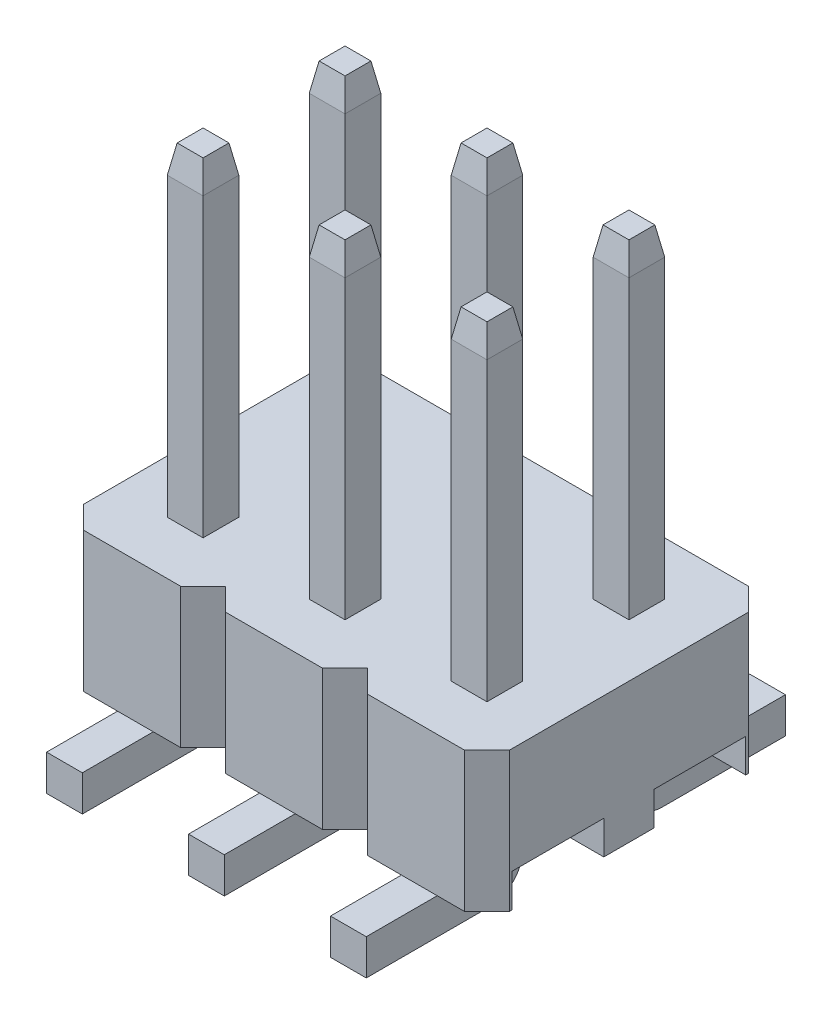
ISO-10303-21;
HEADER;
FILE_DESCRIPTION(('STEP AP214'),'2;1');
FILE_NAME('part.step','',(''),(''),'','','');
FILE_SCHEMA(('AUTOMOTIVE_DESIGN { 1 0 10303 214 1 1 1 1 }'));
ENDSEC;
DATA;
#1=APPLICATION_CONTEXT('core data for automotive mechanical design processes');
#2=APPLICATION_PROTOCOL_DEFINITION('international standard','automotive_design',2000,#1);
#3=PRODUCT_CONTEXT('',#1,'mechanical');
#4=PRODUCT('Part','Part','',(#3));
#5=PRODUCT_RELATED_PRODUCT_CATEGORY('part','',(#4));
#6=PRODUCT_DEFINITION_FORMATION('','',#4);
#7=PRODUCT_DEFINITION_CONTEXT('part definition',#1,'design');
#8=PRODUCT_DEFINITION('design','',#6,#7);
#9=PRODUCT_DEFINITION_SHAPE('','',#8);
#10=(LENGTH_UNIT() NAMED_UNIT(*) SI_UNIT(.MILLI.,.METRE.));
#11=(NAMED_UNIT(*) PLANE_ANGLE_UNIT() SI_UNIT($,.RADIAN.));
#12=(NAMED_UNIT(*) SI_UNIT($,.STERADIAN.) SOLID_ANGLE_UNIT());
#13=UNCERTAINTY_MEASURE_WITH_UNIT(LENGTH_MEASURE(1.E-05),#10,'distance_accuracy_value','');
#14=(GEOMETRIC_REPRESENTATION_CONTEXT(3) GLOBAL_UNCERTAINTY_ASSIGNED_CONTEXT((#13)) GLOBAL_UNIT_ASSIGNED_CONTEXT((#10,
#11,#12)) REPRESENTATION_CONTEXT('',''));
#15=CARTESIAN_POINT('',(0.,0.,0.));
#16=DIRECTION('',(0.,0.,1.));
#17=DIRECTION('',(1.,0.,0.));
#18=AXIS2_PLACEMENT_3D('',#15,#16,#17);
#19=CARTESIAN_POINT('',(-25.4,0.6,-2.09));
#20=DIRECTION('',(0.,0.,1.));
#21=DIRECTION('',(1.,0.,0.));
#22=AXIS2_PLACEMENT_3D('',#19,#20,#21);
#23=PLANE('',#22);
#24=DIRECTION('',(1.,0.,0.));
#25=VECTOR('',#24,1.);
#26=CARTESIAN_POINT('',(-5.08,0.6,-2.09));
#27=LINE('',#26,#25);
#28=CARTESIAN_POINT('',(-5.08,0.6,-2.09));
#29=VERTEX_POINT('',#28);
#30=CARTESIAN_POINT('',(2.54,0.6,-2.09));
#31=VERTEX_POINT('',#30);
#32=EDGE_CURVE('E327',#29,#31,#27,.T.);
#33=ORIENTED_EDGE('',*,*,#32,.F.);
#34=DIRECTION('',(0.,1.,0.));
#35=VECTOR('',#34,1.);
#36=CARTESIAN_POINT('',(-5.08,0.,-2.09));
#37=LINE('',#36,#35);
#38=CARTESIAN_POINT('',(-5.08,0.,-2.09));
#39=VERTEX_POINT('',#38);
#40=EDGE_CURVE('E309',#39,#29,#37,.T.);
#41=ORIENTED_EDGE('',*,*,#40,.F.);
#42=DIRECTION('',(1.,0.,0.));
#43=VECTOR('',#42,1.);
#44=CARTESIAN_POINT('',(-5.08,0.,-2.09));
#45=LINE('',#44,#43);
#46=CARTESIAN_POINT('',(2.54,0.,-2.09));
#47=VERTEX_POINT('',#46);
#48=EDGE_CURVE('E1090',#39,#47,#45,.T.);
#49=ORIENTED_EDGE('',*,*,#48,.T.);
#50=DIRECTION('',(0.,1.,0.));
#51=VECTOR('',#50,1.);
#52=CARTESIAN_POINT('',(2.54,0.,-2.09));
#53=LINE('',#52,#51);
#54=EDGE_CURVE('E1854',#47,#31,#53,.T.);
#55=ORIENTED_EDGE('',*,*,#54,.T.);
#56=EDGE_LOOP('',(#33,#41,#49,#55));
#57=FACE_BOUND('',#56,.T.);
#58=ADVANCED_FACE('F17',(#57),#23,.T.);
#59=CARTESIAN_POINT('',(-4.68,2.5,-2.54));
#60=DIRECTION('',(0.,0.,1.));
#61=DIRECTION('',(1.,0.,0.));
#62=AXIS2_PLACEMENT_3D('',#59,#60,#61);
#63=PLANE('',#62);
#64=DIRECTION('',(0.,1.,0.));
#65=VECTOR('',#64,1.);
#66=CARTESIAN_POINT('',(-4.68,0.,-2.54));
#67=LINE('',#66,#65);
#68=CARTESIAN_POINT('',(-4.68,0.,-2.54));
#69=VERTEX_POINT('',#68);
#70=CARTESIAN_POINT('',(-4.68,2.5,-2.54));
#71=VERTEX_POINT('',#70);
#72=EDGE_CURVE('E1396',#69,#71,#67,.T.);
#73=ORIENTED_EDGE('',*,*,#72,.T.);
#74=DIRECTION('',(1.,0.,0.));
#75=VECTOR('',#74,1.);
#76=CARTESIAN_POINT('',(-4.68,2.5,-2.54));
#77=LINE('',#76,#75);
#78=CARTESIAN_POINT('',(-2.94,2.5,-2.54));
#79=VERTEX_POINT('',#78);
#80=EDGE_CURVE('E519',#71,#79,#77,.T.);
#81=ORIENTED_EDGE('',*,*,#80,.T.);
#82=DIRECTION('',(0.,1.,0.));
#83=VECTOR('',#82,1.);
#84=CARTESIAN_POINT('',(-2.94,0.,-2.54));
#85=LINE('',#84,#83);
#86=CARTESIAN_POINT('',(-2.94,0.,-2.54));
#87=VERTEX_POINT('',#86);
#88=EDGE_CURVE('E11',#87,#79,#85,.T.);
#89=ORIENTED_EDGE('',*,*,#88,.F.);
#90=DIRECTION('',(1.,0.,0.));
#91=VECTOR('',#90,1.);
#92=CARTESIAN_POINT('',(-4.68,0.,-2.54));
#93=LINE('',#92,#91);
#94=EDGE_CURVE('E1094',#69,#87,#93,.T.);
#95=ORIENTED_EDGE('',*,*,#94,.F.);
#96=EDGE_LOOP('',(#73,#81,#89,#95));
#97=FACE_BOUND('',#96,.T.);
#98=ADVANCED_FACE('F1840',(#97),#63,.F.);
#99=CARTESIAN_POINT('',(-2.94,2.5,-2.54));
#100=DIRECTION('',(-0.707106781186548,0.,0.707106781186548));
#101=DIRECTION('',(0.,1.,0.));
#102=AXIS2_PLACEMENT_3D('',#99,#100,#101);
#103=PLANE('',#102);
#104=ORIENTED_EDGE('',*,*,#88,.T.);
#105=DIRECTION('',(0.707106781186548,0.,0.707106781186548));
#106=VECTOR('',#105,1.);
#107=CARTESIAN_POINT('',(-2.94,2.5,-2.54));
#108=LINE('',#107,#106);
#109=CARTESIAN_POINT('',(-2.54,2.5,-2.14));
#110=VERTEX_POINT('',#109);
#111=EDGE_CURVE('E928',#79,#110,#108,.T.);
#112=ORIENTED_EDGE('',*,*,#111,.T.);
#113=DIRECTION('',(0.,1.,0.));
#114=VECTOR('',#113,1.);
#115=CARTESIAN_POINT('',(-2.54,0.,-2.14));
#116=LINE('',#115,#114);
#117=CARTESIAN_POINT('',(-2.54,0.,-2.14));
#118=VERTEX_POINT('',#117);
#119=EDGE_CURVE('E27',#118,#110,#116,.T.);
#120=ORIENTED_EDGE('',*,*,#119,.F.);
#121=DIRECTION('',(-0.707106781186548,0.,-0.707106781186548));
#122=VECTOR('',#121,1.);
#123=CARTESIAN_POINT('',(-2.54,0.,-2.14));
#124=LINE('',#123,#122);
#125=EDGE_CURVE('E1406',#118,#87,#124,.T.);
#126=ORIENTED_EDGE('',*,*,#125,.T.);
#127=EDGE_LOOP('',(#104,#112,#120,#126));
#128=FACE_BOUND('',#127,.T.);
#129=ADVANCED_FACE('F1415',(#128),#103,.F.);
#130=CARTESIAN_POINT('',(-2.54,2.5,-2.14));
#131=DIRECTION('',(0.707106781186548,0.,0.707106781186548));
#132=DIRECTION('',(0.,-1.,0.));
#133=AXIS2_PLACEMENT_3D('',#130,#131,#132);
#134=PLANE('',#133);
#135=ORIENTED_EDGE('',*,*,#119,.T.);
#136=DIRECTION('',(0.707106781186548,0.,-0.707106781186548));
#137=VECTOR('',#136,1.);
#138=CARTESIAN_POINT('',(-2.54,2.5,-2.14));
#139=LINE('',#138,#137);
#140=CARTESIAN_POINT('',(-2.14,2.5,-2.54));
#141=VERTEX_POINT('',#140);
#142=EDGE_CURVE('E925',#110,#141,#139,.T.);
#143=ORIENTED_EDGE('',*,*,#142,.T.);
#144=DIRECTION('',(0.,1.,0.));
#145=VECTOR('',#144,1.);
#146=CARTESIAN_POINT('',(-2.14,0.,-2.54));
#147=LINE('',#146,#145);
#148=CARTESIAN_POINT('',(-2.14,0.,-2.54));
#149=VERTEX_POINT('',#148);
#150=EDGE_CURVE('E20',#149,#141,#147,.T.);
#151=ORIENTED_EDGE('',*,*,#150,.F.);
#152=DIRECTION('',(-0.707106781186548,0.,0.707106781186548));
#153=VECTOR('',#152,1.);
#154=CARTESIAN_POINT('',(-2.14,0.,-2.54));
#155=LINE('',#154,#153);
#156=EDGE_CURVE('E225',#149,#118,#155,.T.);
#157=ORIENTED_EDGE('',*,*,#156,.T.);
#158=EDGE_LOOP('',(#135,#143,#151,#157));
#159=FACE_BOUND('',#158,.T.);
#160=ADVANCED_FACE('F1412',(#159),#134,.F.);
#161=CARTESIAN_POINT('',(-2.14,2.5,-2.54));
#162=DIRECTION('',(0.,0.,1.));
#163=DIRECTION('',(1.,0.,0.));
#164=AXIS2_PLACEMENT_3D('',#161,#162,#163);
#165=PLANE('',#164);
#166=ORIENTED_EDGE('',*,*,#150,.T.);
#167=DIRECTION('',(1.,0.,0.));
#168=VECTOR('',#167,1.);
#169=CARTESIAN_POINT('',(-2.14,2.5,-2.54));
#170=LINE('',#169,#168);
#171=CARTESIAN_POINT('',(-0.4,2.5,-2.54));
#172=VERTEX_POINT('',#171);
#173=EDGE_CURVE('E922',#141,#172,#170,.T.);
#174=ORIENTED_EDGE('',*,*,#173,.T.);
#175=DIRECTION('',(0.,1.,0.));
#176=VECTOR('',#175,1.);
#177=CARTESIAN_POINT('',(-0.4,0.,-2.54));
#178=LINE('',#177,#176);
#179=CARTESIAN_POINT('',(-0.4,0.,-2.54));
#180=VERTEX_POINT('',#179);
#181=EDGE_CURVE('E204',#180,#172,#178,.T.);
#182=ORIENTED_EDGE('',*,*,#181,.F.);
#183=DIRECTION('',(1.,0.,0.));
#184=VECTOR('',#183,1.);
#185=CARTESIAN_POINT('',(-2.14,0.,-2.54));
#186=LINE('',#185,#184);
#187=EDGE_CURVE('E220',#149,#180,#186,.T.);
#188=ORIENTED_EDGE('',*,*,#187,.F.);
#189=EDGE_LOOP('',(#166,#174,#182,#188));
#190=FACE_BOUND('',#189,.T.);
#191=ADVANCED_FACE('F2080',(#190),#165,.F.);
#192=CARTESIAN_POINT('',(-0.4,2.5,-2.54));
#193=DIRECTION('',(-0.707106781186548,0.,0.707106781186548));
#194=DIRECTION('',(0.,1.,0.));
#195=AXIS2_PLACEMENT_3D('',#192,#193,#194);
#196=PLANE('',#195);
#197=ORIENTED_EDGE('',*,*,#181,.T.);
#198=DIRECTION('',(0.707106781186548,0.,0.707106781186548));
#199=VECTOR('',#198,1.);
#200=CARTESIAN_POINT('',(-0.4,2.5,-2.54));
#201=LINE('',#200,#199);
#202=CARTESIAN_POINT('',(0.,2.5,-2.14));
#203=VERTEX_POINT('',#202);
#204=EDGE_CURVE('E199',#172,#203,#201,.T.);
#205=ORIENTED_EDGE('',*,*,#204,.T.);
#206=DIRECTION('',(0.,1.,0.));
#207=VECTOR('',#206,1.);
#208=CARTESIAN_POINT('',(0.,0.,-2.14));
#209=LINE('',#208,#207);
#210=CARTESIAN_POINT('',(0.,0.,-2.14));
#211=VERTEX_POINT('',#210);
#212=EDGE_CURVE('E190',#211,#203,#209,.T.);
#213=ORIENTED_EDGE('',*,*,#212,.F.);
#214=DIRECTION('',(-0.707106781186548,0.,-0.707106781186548));
#215=VECTOR('',#214,1.);
#216=CARTESIAN_POINT('',(0.,0.,-2.14));
#217=LINE('',#216,#215);
#218=EDGE_CURVE('E195',#211,#180,#217,.T.);
#219=ORIENTED_EDGE('',*,*,#218,.T.);
#220=EDGE_LOOP('',(#197,#205,#213,#219));
#221=FACE_BOUND('',#220,.T.);
#222=ADVANCED_FACE('F193',(#221),#196,.F.);
#223=CARTESIAN_POINT('',(0.,2.5,-2.14));
#224=DIRECTION('',(0.707106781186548,0.,0.707106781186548));
#225=DIRECTION('',(0.,-1.,0.));
#226=AXIS2_PLACEMENT_3D('',#223,#224,#225);
#227=PLANE('',#226);
#228=ORIENTED_EDGE('',*,*,#212,.T.);
#229=DIRECTION('',(0.707106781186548,0.,-0.707106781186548));
#230=VECTOR('',#229,1.);
#231=CARTESIAN_POINT('',(0.,2.5,-2.14));
#232=LINE('',#231,#230);
#233=CARTESIAN_POINT('',(0.4,2.5,-2.54));
#234=VERTEX_POINT('',#233);
#235=EDGE_CURVE('E913',#203,#234,#232,.T.);
#236=ORIENTED_EDGE('',*,*,#235,.T.);
#237=DIRECTION('',(0.,1.,0.));
#238=VECTOR('',#237,1.);
#239=CARTESIAN_POINT('',(0.4,0.,-2.54));
#240=LINE('',#239,#238);
#241=CARTESIAN_POINT('',(0.4,0.,-2.54));
#242=VERTEX_POINT('',#241);
#243=EDGE_CURVE('E205',#242,#234,#240,.T.);
#244=ORIENTED_EDGE('',*,*,#243,.F.);
#245=DIRECTION('',(-0.707106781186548,0.,0.707106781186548));
#246=VECTOR('',#245,1.);
#247=CARTESIAN_POINT('',(0.4,0.,-2.54));
#248=LINE('',#247,#246);
#249=EDGE_CURVE('E208',#242,#211,#248,.T.);
#250=ORIENTED_EDGE('',*,*,#249,.T.);
#251=EDGE_LOOP('',(#228,#236,#244,#250));
#252=FACE_BOUND('',#251,.T.);
#253=ADVANCED_FACE('F209',(#252),#227,.F.);
#254=CARTESIAN_POINT('',(0.4,2.5,-2.54));
#255=DIRECTION('',(0.,0.,1.));
#256=DIRECTION('',(1.,0.,0.));
#257=AXIS2_PLACEMENT_3D('',#254,#255,#256);
#258=PLANE('',#257);
#259=ORIENTED_EDGE('',*,*,#243,.T.);
#260=DIRECTION('',(1.,0.,0.));
#261=VECTOR('',#260,1.);
#262=CARTESIAN_POINT('',(0.4,2.5,-2.54));
#263=LINE('',#262,#261);
#264=CARTESIAN_POINT('',(2.14,2.5,-2.54));
#265=VERTEX_POINT('',#264);
#266=EDGE_CURVE('E910',#234,#265,#263,.T.);
#267=ORIENTED_EDGE('',*,*,#266,.T.);
#268=DIRECTION('',(0.,1.,0.));
#269=VECTOR('',#268,1.);
#270=CARTESIAN_POINT('',(2.14,0.,-2.54));
#271=LINE('',#270,#269);
#272=CARTESIAN_POINT('',(2.14,0.,-2.54));
#273=VERTEX_POINT('',#272);
#274=EDGE_CURVE('E40',#273,#265,#271,.T.);
#275=ORIENTED_EDGE('',*,*,#274,.F.);
#276=DIRECTION('',(1.,0.,0.));
#277=VECTOR('',#276,1.);
#278=CARTESIAN_POINT('',(0.4,0.,-2.54));
#279=LINE('',#278,#277);
#280=EDGE_CURVE('E214',#242,#273,#279,.T.);
#281=ORIENTED_EDGE('',*,*,#280,.F.);
#282=EDGE_LOOP('',(#259,#267,#275,#281));
#283=FACE_BOUND('',#282,.T.);
#284=ADVANCED_FACE('F2090',(#283),#258,.F.);
#285=CARTESIAN_POINT('',(2.14,2.5,-2.54));
#286=DIRECTION('',(-0.707106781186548,0.,0.707106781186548));
#287=DIRECTION('',(0.,1.,0.));
#288=AXIS2_PLACEMENT_3D('',#285,#286,#287);
#289=PLANE('',#288);
#290=DIRECTION('',(-0.707106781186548,0.,-0.707106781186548));
#291=VECTOR('',#290,1.);
#292=CARTESIAN_POINT('',(2.54,0.,-2.14));
#293=LINE('',#292,#291);
#294=CARTESIAN_POINT('',(2.54,0.,-2.14));
#295=VERTEX_POINT('',#294);
#296=EDGE_CURVE('E231',#295,#273,#293,.T.);
#297=ORIENTED_EDGE('',*,*,#296,.T.);
#298=ORIENTED_EDGE('',*,*,#274,.T.);
#299=DIRECTION('',(0.707106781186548,0.,0.707106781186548));
#300=VECTOR('',#299,1.);
#301=CARTESIAN_POINT('',(2.14,2.5,-2.54));
#302=LINE('',#301,#300);
#303=CARTESIAN_POINT('',(2.54,2.5,-2.14));
#304=VERTEX_POINT('',#303);
#305=EDGE_CURVE('E906',#265,#304,#302,.T.);
#306=ORIENTED_EDGE('',*,*,#305,.T.);
#307=DIRECTION('',(0.,1.,0.));
#308=VECTOR('',#307,1.);
#309=CARTESIAN_POINT('',(2.54,0.,-2.14));
#310=LINE('',#309,#308);
#311=EDGE_CURVE('E2887',#295,#304,#310,.T.);
#312=ORIENTED_EDGE('',*,*,#311,.F.);
#313=EDGE_LOOP('',(#297,#298,#306,#312));
#314=FACE_BOUND('',#313,.T.);
#315=ADVANCED_FACE('F2251',(#314),#289,.F.);
#316=CARTESIAN_POINT('',(-24.13,0.,-1.27));
#317=DIRECTION('',(0.,-1.,0.));
#318=DIRECTION('',(0.,0.,-1.));
#319=AXIS2_PLACEMENT_3D('',#316,#317,#318);
#320=PLANE('',#319);
#321=ORIENTED_EDGE('',*,*,#48,.F.);
#322=DIRECTION('',(0.,0.,-1.));
#323=VECTOR('',#322,1.);
#324=CARTESIAN_POINT('',(-5.08,0.,-2.09));
#325=LINE('',#324,#323);
#326=CARTESIAN_POINT('',(-5.08,0.,-2.14));
#327=VERTEX_POINT('',#326);
#328=EDGE_CURVE('E305',#39,#327,#325,.T.);
#329=ORIENTED_EDGE('',*,*,#328,.T.);
#330=DIRECTION('',(-0.707106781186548,0.,0.707106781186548));
#331=VECTOR('',#330,1.);
#332=CARTESIAN_POINT('',(-4.68,0.,-2.54));
#333=LINE('',#332,#331);
#334=EDGE_CURVE('E1095',#69,#327,#333,.T.);
#335=ORIENTED_EDGE('',*,*,#334,.F.);
#336=ORIENTED_EDGE('',*,*,#94,.T.);
#337=ORIENTED_EDGE('',*,*,#125,.F.);
#338=ORIENTED_EDGE('',*,*,#156,.F.);
#339=ORIENTED_EDGE('',*,*,#187,.T.);
#340=ORIENTED_EDGE('',*,*,#218,.F.);
#341=ORIENTED_EDGE('',*,*,#249,.F.);
#342=ORIENTED_EDGE('',*,*,#280,.T.);
#343=ORIENTED_EDGE('',*,*,#296,.F.);
#344=DIRECTION('',(0.,0.,-1.));
#345=VECTOR('',#344,1.);
#346=CARTESIAN_POINT('',(2.54,0.,-2.09));
#347=LINE('',#346,#345);
#348=EDGE_CURVE('E2893',#47,#295,#347,.T.);
#349=ORIENTED_EDGE('',*,*,#348,.F.);
#350=EDGE_LOOP('',(#321,#329,#335,#336,#337,#338,#339,#340,#341,#342,#343,#349));
#351=FACE_BOUND('',#350,.T.);
#352=ADVANCED_FACE('F217',(#351),#320,.T.);
#353=CARTESIAN_POINT('',(-5.08,2.5,-2.14));
#354=DIRECTION('',(0.707106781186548,0.,0.707106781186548));
#355=DIRECTION('',(0.,-1.,0.));
#356=AXIS2_PLACEMENT_3D('',#353,#354,#355);
#357=PLANE('',#356);
#358=DIRECTION('',(0.707106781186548,0.,-0.707106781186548));
#359=VECTOR('',#358,1.);
#360=CARTESIAN_POINT('',(-5.08,2.5,-2.14));
#361=LINE('',#360,#359);
#362=CARTESIAN_POINT('',(-5.08,2.5,-2.14));
#363=VERTEX_POINT('',#362);
#364=EDGE_CURVE('E514',#363,#71,#361,.T.);
#365=ORIENTED_EDGE('',*,*,#364,.T.);
#366=ORIENTED_EDGE('',*,*,#72,.F.);
#367=ORIENTED_EDGE('',*,*,#334,.T.);
#368=DIRECTION('',(0.,1.,0.));
#369=VECTOR('',#368,1.);
#370=CARTESIAN_POINT('',(-5.08,0.,-2.14));
#371=LINE('',#370,#369);
#372=EDGE_CURVE('E295',#327,#363,#371,.T.);
#373=ORIENTED_EDGE('',*,*,#372,.T.);
#374=EDGE_LOOP('',(#365,#366,#367,#373));
#375=FACE_BOUND('',#374,.T.);
#376=ADVANCED_FACE('F2250',(#375),#357,.F.);
#377=CARTESIAN_POINT('',(-4.68,2.5,2.54));
#378=DIRECTION('',(0.,0.,-1.));
#379=DIRECTION('',(0.,-1.,0.));
#380=AXIS2_PLACEMENT_3D('',#377,#378,#379);
#381=PLANE('',#380);
#382=DIRECTION('',(0.,1.,0.));
#383=VECTOR('',#382,1.);
#384=CARTESIAN_POINT('',(-2.94,0.,2.54));
#385=LINE('',#384,#383);
#386=CARTESIAN_POINT('',(-2.94,0.,2.54));
#387=VERTEX_POINT('',#386);
#388=CARTESIAN_POINT('',(-2.94,2.5,2.54));
#389=VERTEX_POINT('',#388);
#390=EDGE_CURVE('E1392',#387,#389,#385,.T.);
#391=ORIENTED_EDGE('',*,*,#390,.T.);
#392=DIRECTION('',(-1.,0.,0.));
#393=VECTOR('',#392,1.);
#394=CARTESIAN_POINT('',(-2.94,2.5,2.54));
#395=LINE('',#394,#393);
#396=CARTESIAN_POINT('',(-4.68,2.5,2.54));
#397=VERTEX_POINT('',#396);
#398=EDGE_CURVE('E518',#389,#397,#395,.T.);
#399=ORIENTED_EDGE('',*,*,#398,.T.);
#400=DIRECTION('',(0.,1.,0.));
#401=VECTOR('',#400,1.);
#402=CARTESIAN_POINT('',(-4.68,0.,2.54));
#403=LINE('',#402,#401);
#404=CARTESIAN_POINT('',(-4.68,0.,2.54));
#405=VERTEX_POINT('',#404);
#406=EDGE_CURVE('E738',#405,#397,#403,.T.);
#407=ORIENTED_EDGE('',*,*,#406,.F.);
#408=DIRECTION('',(-1.,0.,0.));
#409=VECTOR('',#408,1.);
#410=CARTESIAN_POINT('',(-2.94,0.,2.54));
#411=LINE('',#410,#409);
#412=EDGE_CURVE('E739',#387,#405,#411,.T.);
#413=ORIENTED_EDGE('',*,*,#412,.F.);
#414=EDGE_LOOP('',(#391,#399,#407,#413));
#415=FACE_BOUND('',#414,.T.);
#416=ADVANCED_FACE('F2254',(#415),#381,.F.);
#417=CARTESIAN_POINT('',(-2.54,2.5,2.14));
#418=DIRECTION('',(-0.707106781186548,0.,-0.707106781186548));
#419=DIRECTION('',(-0.707106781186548,0.,0.707106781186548));
#420=AXIS2_PLACEMENT_3D('',#417,#418,#419);
#421=PLANE('',#420);
#422=DIRECTION('',(0.,1.,0.));
#423=VECTOR('',#422,1.);
#424=CARTESIAN_POINT('',(-2.54,0.,2.14));
#425=LINE('',#424,#423);
#426=CARTESIAN_POINT('',(-2.54,0.,2.14));
#427=VERTEX_POINT('',#426);
#428=CARTESIAN_POINT('',(-2.54,2.5,2.14));
#429=VERTEX_POINT('',#428);
#430=EDGE_CURVE('E1388',#427,#429,#425,.T.);
#431=ORIENTED_EDGE('',*,*,#430,.T.);
#432=DIRECTION('',(-0.707106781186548,0.,0.707106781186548));
#433=VECTOR('',#432,1.);
#434=CARTESIAN_POINT('',(-2.54,2.5,2.14));
#435=LINE('',#434,#433);
#436=EDGE_CURVE('E943',#429,#389,#435,.T.);
#437=ORIENTED_EDGE('',*,*,#436,.T.);
#438=ORIENTED_EDGE('',*,*,#390,.F.);
#439=DIRECTION('',(0.707106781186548,0.,-0.707106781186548));
#440=VECTOR('',#439,1.);
#441=CARTESIAN_POINT('',(-2.94,0.,2.54));
#442=LINE('',#441,#440);
#443=EDGE_CURVE('E887',#387,#427,#442,.T.);
#444=ORIENTED_EDGE('',*,*,#443,.T.);
#445=EDGE_LOOP('',(#431,#437,#438,#444));
#446=FACE_BOUND('',#445,.T.);
#447=ADVANCED_FACE('F2246',(#446),#421,.F.);
#448=CARTESIAN_POINT('',(-2.54,2.5,2.14));
#449=DIRECTION('',(0.707106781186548,0.,-0.707106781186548));
#450=DIRECTION('',(0.,-1.,0.));
#451=AXIS2_PLACEMENT_3D('',#448,#449,#450);
#452=PLANE('',#451);
#453=DIRECTION('',(0.,1.,0.));
#454=VECTOR('',#453,1.);
#455=CARTESIAN_POINT('',(-2.14,0.,2.54));
#456=LINE('',#455,#454);
#457=CARTESIAN_POINT('',(-2.14,0.,2.54));
#458=VERTEX_POINT('',#457);
#459=CARTESIAN_POINT('',(-2.14,2.5,2.54));
#460=VERTEX_POINT('',#459);
#461=EDGE_CURVE('E1384',#458,#460,#456,.T.);
#462=ORIENTED_EDGE('',*,*,#461,.T.);
#463=DIRECTION('',(-0.707106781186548,0.,-0.707106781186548));
#464=VECTOR('',#463,1.);
#465=CARTESIAN_POINT('',(-2.14,2.5,2.54));
#466=LINE('',#465,#464);
#467=EDGE_CURVE('E947',#460,#429,#466,.T.);
#468=ORIENTED_EDGE('',*,*,#467,.T.);
#469=ORIENTED_EDGE('',*,*,#430,.F.);
#470=DIRECTION('',(0.707106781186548,0.,0.707106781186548));
#471=VECTOR('',#470,1.);
#472=CARTESIAN_POINT('',(-2.54,0.,2.14));
#473=LINE('',#472,#471);
#474=EDGE_CURVE('E883',#427,#458,#473,.T.);
#475=ORIENTED_EDGE('',*,*,#474,.T.);
#476=EDGE_LOOP('',(#462,#468,#469,#475));
#477=FACE_BOUND('',#476,.T.);
#478=ADVANCED_FACE('F2243',(#477),#452,.F.);
#479=CARTESIAN_POINT('',(-2.14,2.5,2.54));
#480=DIRECTION('',(0.,0.,-1.));
#481=DIRECTION('',(0.,-1.,0.));
#482=AXIS2_PLACEMENT_3D('',#479,#480,#481);
#483=PLANE('',#482);
#484=DIRECTION('',(0.,1.,0.));
#485=VECTOR('',#484,1.);
#486=CARTESIAN_POINT('',(-0.4,0.,2.54));
#487=LINE('',#486,#485);
#488=CARTESIAN_POINT('',(-0.4,0.,2.54));
#489=VERTEX_POINT('',#488);
#490=CARTESIAN_POINT('',(-0.4,2.5,2.54));
#491=VERTEX_POINT('',#490);
#492=EDGE_CURVE('E1169',#489,#491,#487,.T.);
#493=ORIENTED_EDGE('',*,*,#492,.T.);
#494=DIRECTION('',(-1.,0.,0.));
#495=VECTOR('',#494,1.);
#496=CARTESIAN_POINT('',(-0.4,2.5,2.54));
#497=LINE('',#496,#495);
#498=EDGE_CURVE('E957',#491,#460,#497,.T.);
#499=ORIENTED_EDGE('',*,*,#498,.T.);
#500=ORIENTED_EDGE('',*,*,#461,.F.);
#501=DIRECTION('',(-1.,0.,0.));
#502=VECTOR('',#501,1.);
#503=CARTESIAN_POINT('',(-0.4,0.,2.54));
#504=LINE('',#503,#502);
#505=EDGE_CURVE('E879',#489,#458,#504,.T.);
#506=ORIENTED_EDGE('',*,*,#505,.F.);
#507=EDGE_LOOP('',(#493,#499,#500,#506));
#508=FACE_BOUND('',#507,.T.);
#509=ADVANCED_FACE('F2241',(#508),#483,.F.);
#510=CARTESIAN_POINT('',(0.,2.5,2.14));
#511=DIRECTION('',(-0.707106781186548,0.,-0.707106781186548));
#512=DIRECTION('',(-0.707106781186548,0.,0.707106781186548));
#513=AXIS2_PLACEMENT_3D('',#510,#511,#512);
#514=PLANE('',#513);
#515=DIRECTION('',(0.,1.,0.));
#516=VECTOR('',#515,1.);
#517=CARTESIAN_POINT('',(0.,0.,2.14));
#518=LINE('',#517,#516);
#519=CARTESIAN_POINT('',(0.,0.,2.14));
#520=VERTEX_POINT('',#519);
#521=CARTESIAN_POINT('',(0.,2.5,2.14));
#522=VERTEX_POINT('',#521);
#523=EDGE_CURVE('E1165',#520,#522,#518,.T.);
#524=ORIENTED_EDGE('',*,*,#523,.T.);
#525=DIRECTION('',(-0.707106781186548,0.,0.707106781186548));
#526=VECTOR('',#525,1.);
#527=CARTESIAN_POINT('',(0.,2.5,2.14));
#528=LINE('',#527,#526);
#529=EDGE_CURVE('E965',#522,#491,#528,.T.);
#530=ORIENTED_EDGE('',*,*,#529,.T.);
#531=ORIENTED_EDGE('',*,*,#492,.F.);
#532=DIRECTION('',(0.707106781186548,0.,-0.707106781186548));
#533=VECTOR('',#532,1.);
#534=CARTESIAN_POINT('',(-0.4,0.,2.54));
#535=LINE('',#534,#533);
#536=EDGE_CURVE('E875',#489,#520,#535,.T.);
#537=ORIENTED_EDGE('',*,*,#536,.T.);
#538=EDGE_LOOP('',(#524,#530,#531,#537));
#539=FACE_BOUND('',#538,.T.);
#540=ADVANCED_FACE('F2237',(#539),#514,.F.);
#541=CARTESIAN_POINT('',(0.,2.5,2.14));
#542=DIRECTION('',(0.707106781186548,0.,-0.707106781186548));
#543=DIRECTION('',(0.,-1.,0.));
#544=AXIS2_PLACEMENT_3D('',#541,#542,#543);
#545=PLANE('',#544);
#546=DIRECTION('',(0.,1.,0.));
#547=VECTOR('',#546,1.);
#548=CARTESIAN_POINT('',(0.4,0.,2.54));
#549=LINE('',#548,#547);
#550=CARTESIAN_POINT('',(0.4,0.,2.54));
#551=VERTEX_POINT('',#550);
#552=CARTESIAN_POINT('',(0.4,2.5,2.54));
#553=VERTEX_POINT('',#552);
#554=EDGE_CURVE('E1170',#551,#553,#549,.T.);
#555=ORIENTED_EDGE('',*,*,#554,.T.);
#556=DIRECTION('',(-0.707106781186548,0.,-0.707106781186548));
#557=VECTOR('',#556,1.);
#558=CARTESIAN_POINT('',(0.4,2.5,2.54));
#559=LINE('',#558,#557);
#560=EDGE_CURVE('E969',#553,#522,#559,.T.);
#561=ORIENTED_EDGE('',*,*,#560,.T.);
#562=ORIENTED_EDGE('',*,*,#523,.F.);
#563=DIRECTION('',(0.707106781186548,0.,0.707106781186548));
#564=VECTOR('',#563,1.);
#565=CARTESIAN_POINT('',(0.,0.,2.14));
#566=LINE('',#565,#564);
#567=EDGE_CURVE('E865',#520,#551,#566,.T.);
#568=ORIENTED_EDGE('',*,*,#567,.T.);
#569=EDGE_LOOP('',(#555,#561,#562,#568));
#570=FACE_BOUND('',#569,.T.);
#571=ADVANCED_FACE('F2240',(#570),#545,.F.);
#572=CARTESIAN_POINT('',(0.4,2.5,2.54));
#573=DIRECTION('',(0.,0.,-1.));
#574=DIRECTION('',(0.,-1.,0.));
#575=AXIS2_PLACEMENT_3D('',#572,#573,#574);
#576=PLANE('',#575);
#577=DIRECTION('',(0.,1.,0.));
#578=VECTOR('',#577,1.);
#579=CARTESIAN_POINT('',(2.14,0.,2.54));
#580=LINE('',#579,#578);
#581=CARTESIAN_POINT('',(2.14,0.,2.54));
#582=VERTEX_POINT('',#581);
#583=CARTESIAN_POINT('',(2.14,2.5,2.54));
#584=VERTEX_POINT('',#583);
#585=EDGE_CURVE('E1374',#582,#584,#580,.T.);
#586=ORIENTED_EDGE('',*,*,#585,.T.);
#587=DIRECTION('',(-1.,0.,0.));
#588=VECTOR('',#587,1.);
#589=CARTESIAN_POINT('',(2.14,2.5,2.54));
#590=LINE('',#589,#588);
#591=EDGE_CURVE('E973',#584,#553,#590,.T.);
#592=ORIENTED_EDGE('',*,*,#591,.T.);
#593=ORIENTED_EDGE('',*,*,#554,.F.);
#594=DIRECTION('',(-1.,0.,0.));
#595=VECTOR('',#594,1.);
#596=CARTESIAN_POINT('',(2.14,0.,2.54));
#597=LINE('',#596,#595);
#598=EDGE_CURVE('E861',#582,#551,#597,.T.);
#599=ORIENTED_EDGE('',*,*,#598,.F.);
#600=EDGE_LOOP('',(#586,#592,#593,#599));
#601=FACE_BOUND('',#600,.T.);
#602=ADVANCED_FACE('F2339',(#601),#576,.F.);
#603=CARTESIAN_POINT('',(2.54,2.5,2.14));
#604=DIRECTION('',(-0.707106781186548,0.,-0.707106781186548));
#605=DIRECTION('',(-0.707106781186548,0.,0.707106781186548));
#606=AXIS2_PLACEMENT_3D('',#603,#604,#605);
#607=PLANE('',#606);
#608=DIRECTION('',(-0.707106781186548,0.,0.707106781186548));
#609=VECTOR('',#608,1.);
#610=CARTESIAN_POINT('',(2.54,2.5,2.14));
#611=LINE('',#610,#609);
#612=CARTESIAN_POINT('',(2.54,2.5,2.14));
#613=VERTEX_POINT('',#612);
#614=EDGE_CURVE('E977',#613,#584,#611,.T.);
#615=ORIENTED_EDGE('',*,*,#614,.T.);
#616=ORIENTED_EDGE('',*,*,#585,.F.);
#617=DIRECTION('',(0.707106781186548,0.,-0.707106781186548));
#618=VECTOR('',#617,1.);
#619=CARTESIAN_POINT('',(2.14,0.,2.54));
#620=LINE('',#619,#618);
#621=CARTESIAN_POINT('',(2.54,0.,2.14));
#622=VERTEX_POINT('',#621);
#623=EDGE_CURVE('E857',#582,#622,#620,.T.);
#624=ORIENTED_EDGE('',*,*,#623,.T.);
#625=DIRECTION('',(0.,1.,0.));
#626=VECTOR('',#625,1.);
#627=CARTESIAN_POINT('',(2.54,0.,2.14));
#628=LINE('',#627,#626);
#629=EDGE_CURVE('E2879',#622,#613,#628,.T.);
#630=ORIENTED_EDGE('',*,*,#629,.T.);
#631=EDGE_LOOP('',(#615,#616,#624,#630));
#632=FACE_BOUND('',#631,.T.);
#633=ADVANCED_FACE('F2346',(#632),#607,.F.);
#634=CARTESIAN_POINT('',(-1.27,8.3,1.27));
#635=DIRECTION('',(0.,1.,0.));
#636=DIRECTION('',(1.,0.,0.));
#637=AXIS2_PLACEMENT_3D('',#634,#635,#636);
#638=PLANE('',#637);
#639=DIRECTION('',(-1.,0.,0.));
#640=VECTOR('',#639,1.);
#641=CARTESIAN_POINT('',(-1.038163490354,8.3,1.501836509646));
#642=LINE('',#641,#640);
#643=CARTESIAN_POINT('',(-1.038163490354,8.3,1.501836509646));
#644=VERTEX_POINT('',#643);
#645=CARTESIAN_POINT('',(-1.501836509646,8.3,1.501836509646));
#646=VERTEX_POINT('',#645);
#647=EDGE_CURVE('E278',#644,#646,#642,.T.);
#648=ORIENTED_EDGE('',*,*,#647,.F.);
#649=DIRECTION('',(0.,0.,1.));
#650=VECTOR('',#649,1.);
#651=CARTESIAN_POINT('',(-1.038163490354,8.3,1.038163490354));
#652=LINE('',#651,#650);
#653=CARTESIAN_POINT('',(-1.038163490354,8.3,1.038163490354));
#654=VERTEX_POINT('',#653);
#655=EDGE_CURVE('E1283',#654,#644,#652,.T.);
#656=ORIENTED_EDGE('',*,*,#655,.F.);
#657=DIRECTION('',(1.,0.,0.));
#658=VECTOR('',#657,1.);
#659=CARTESIAN_POINT('',(-1.501836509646,8.3,1.038163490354));
#660=LINE('',#659,#658);
#661=CARTESIAN_POINT('',(-1.501836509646,8.3,1.038163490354));
#662=VERTEX_POINT('',#661);
#663=EDGE_CURVE('E1284',#662,#654,#660,.T.);
#664=ORIENTED_EDGE('',*,*,#663,.F.);
#665=DIRECTION('',(0.,0.,-1.));
#666=VECTOR('',#665,1.);
#667=CARTESIAN_POINT('',(-1.501836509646,8.3,1.501836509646));
#668=LINE('',#667,#666);
#669=EDGE_CURVE('E1371',#646,#662,#668,.T.);
#670=ORIENTED_EDGE('',*,*,#669,.F.);
#671=EDGE_LOOP('',(#648,#656,#664,#670));
#672=FACE_BOUND('',#671,.T.);
#673=ADVANCED_FACE('F2235',(#672),#638,.T.);
#674=CARTESIAN_POINT('',(-1.501836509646,8.3,1.27));
#675=DIRECTION('',(-0.984807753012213,0.173648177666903,0.));
#676=DIRECTION('',(0.,0.,1.));
#677=AXIS2_PLACEMENT_3D('',#674,#675,#676);
#678=PLANE('',#677);
#679=DIRECTION('',(0.,0.,1.));
#680=VECTOR('',#679,1.);
#681=CARTESIAN_POINT('',(-1.59,7.8,0.9499999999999));
#682=LINE('',#681,#680);
#683=CARTESIAN_POINT('',(-1.59,7.8,0.9499999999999));
#684=VERTEX_POINT('',#683);
#685=CARTESIAN_POINT('',(-1.59,7.8,1.59));
#686=VERTEX_POINT('',#685);
#687=EDGE_CURVE('E1120',#684,#686,#682,.T.);
#688=ORIENTED_EDGE('',*,*,#687,.T.);
#689=DIRECTION('',(0.171087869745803,0.970287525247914,-0.171087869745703));
#690=VECTOR('',#689,1.);
#691=CARTESIAN_POINT('',(-1.59,7.8,1.59));
#692=LINE('',#691,#690);
#693=EDGE_CURVE('E282',#686,#646,#692,.T.);
#694=ORIENTED_EDGE('',*,*,#693,.T.);
#695=ORIENTED_EDGE('',*,*,#669,.T.);
#696=DIRECTION('',(0.1710878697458,0.970287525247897,0.1710878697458));
#697=VECTOR('',#696,1.);
#698=CARTESIAN_POINT('',(-1.59,7.8,0.9499999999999));
#699=LINE('',#698,#697);
#700=EDGE_CURVE('E460',#684,#662,#699,.T.);
#701=ORIENTED_EDGE('',*,*,#700,.F.);
#702=EDGE_LOOP('',(#688,#694,#695,#701));
#703=FACE_BOUND('',#702,.T.);
#704=ADVANCED_FACE('F2232',(#703),#678,.T.);
#705=CARTESIAN_POINT('',(-1.27,8.3,1.501836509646));
#706=DIRECTION('',(0.,0.173648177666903,0.984807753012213));
#707=DIRECTION('',(1.,0.,0.));
#708=AXIS2_PLACEMENT_3D('',#705,#706,#707);
#709=PLANE('',#708);
#710=DIRECTION('',(1.,0.,0.));
#711=VECTOR('',#710,1.);
#712=CARTESIAN_POINT('',(-1.59,7.8,1.59));
#713=LINE('',#712,#711);
#714=CARTESIAN_POINT('',(-0.9499999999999,7.8,1.59));
#715=VERTEX_POINT('',#714);
#716=EDGE_CURVE('E1347',#686,#715,#713,.T.);
#717=ORIENTED_EDGE('',*,*,#716,.T.);
#718=DIRECTION('',(0.1710878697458,-0.970287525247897,0.1710878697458));
#719=VECTOR('',#718,1.);
#720=CARTESIAN_POINT('',(-1.038163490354,8.3,1.501836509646));
#721=LINE('',#720,#719);
#722=EDGE_CURVE('E283',#644,#715,#721,.T.);
#723=ORIENTED_EDGE('',*,*,#722,.F.);
#724=ORIENTED_EDGE('',*,*,#647,.T.);
#725=ORIENTED_EDGE('',*,*,#693,.F.);
#726=EDGE_LOOP('',(#717,#723,#724,#725));
#727=FACE_BOUND('',#726,.T.);
#728=ADVANCED_FACE('F2153',(#727),#709,.T.);
#729=CARTESIAN_POINT('',(-1.038163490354,8.3,1.27));
#730=DIRECTION('',(0.984807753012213,0.173648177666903,0.));
#731=DIRECTION('',(0.,0.,-1.));
#732=AXIS2_PLACEMENT_3D('',#729,#730,#731);
#733=PLANE('',#732);
#734=ORIENTED_EDGE('',*,*,#655,.T.);
#735=ORIENTED_EDGE('',*,*,#722,.T.);
#736=DIRECTION('',(0.,0.,-1.));
#737=VECTOR('',#736,1.);
#738=CARTESIAN_POINT('',(-0.9499999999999,7.8,1.59));
#739=LINE('',#738,#737);
#740=CARTESIAN_POINT('',(-0.9499999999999,7.8,0.9499999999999));
#741=VERTEX_POINT('',#740);
#742=EDGE_CURVE('E1339',#715,#741,#739,.T.);
#743=ORIENTED_EDGE('',*,*,#742,.T.);
#744=DIRECTION('',(0.1710878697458,-0.970287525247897,-0.1710878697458));
#745=VECTOR('',#744,1.);
#746=CARTESIAN_POINT('',(-1.038163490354,8.3,1.038163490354));
#747=LINE('',#746,#745);
#748=EDGE_CURVE('E1280',#654,#741,#747,.T.);
#749=ORIENTED_EDGE('',*,*,#748,.F.);
#750=EDGE_LOOP('',(#734,#735,#743,#749));
#751=FACE_BOUND('',#750,.T.);
#752=ADVANCED_FACE('F2149',(#751),#733,.T.);
#753=CARTESIAN_POINT('',(-1.27,8.3,1.038163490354));
#754=DIRECTION('',(0.,0.173648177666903,-0.984807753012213));
#755=DIRECTION('',(-1.,0.,0.));
#756=AXIS2_PLACEMENT_3D('',#753,#754,#755);
#757=PLANE('',#756);
#758=DIRECTION('',(-1.,0.,0.));
#759=VECTOR('',#758,1.);
#760=CARTESIAN_POINT('',(-0.9499999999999,7.8,0.9499999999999));
#761=LINE('',#760,#759);
#762=EDGE_CURVE('E456',#741,#684,#761,.T.);
#763=ORIENTED_EDGE('',*,*,#762,.T.);
#764=ORIENTED_EDGE('',*,*,#700,.T.);
#765=ORIENTED_EDGE('',*,*,#663,.T.);
#766=ORIENTED_EDGE('',*,*,#748,.T.);
#767=EDGE_LOOP('',(#763,#764,#765,#766));
#768=FACE_BOUND('',#767,.T.);
#769=ADVANCED_FACE('F2152',(#768),#757,.T.);
#770=CARTESIAN_POINT('',(-1.59,8.3,0.95));
#771=DIRECTION('',(0.,0.,1.));
#772=DIRECTION('',(1.,0.,0.));
#773=AXIS2_PLACEMENT_3D('',#770,#771,#772);
#774=PLANE('',#773);
#775=DIRECTION('',(0.,1.,0.));
#776=VECTOR('',#775,1.);
#777=CARTESIAN_POINT('',(-1.59,2.5,0.95));
#778=LINE('',#777,#776);
#779=CARTESIAN_POINT('',(-1.59,2.5,0.95));
#780=VERTEX_POINT('',#779);
#781=EDGE_CURVE('E461',#780,#684,#778,.T.);
#782=ORIENTED_EDGE('',*,*,#781,.T.);
#783=ORIENTED_EDGE('',*,*,#762,.F.);
#784=DIRECTION('',(0.,1.,0.));
#785=VECTOR('',#784,1.);
#786=CARTESIAN_POINT('',(-0.95,2.5,0.95));
#787=LINE('',#786,#785);
#788=CARTESIAN_POINT('',(-0.95,2.5,0.95));
#789=VERTEX_POINT('',#788);
#790=EDGE_CURVE('E1335',#789,#741,#787,.T.);
#791=ORIENTED_EDGE('',*,*,#790,.F.);
#792=DIRECTION('',(-1.,0.,0.));
#793=VECTOR('',#792,1.);
#794=CARTESIAN_POINT('',(-0.95,2.5,0.95));
#795=LINE('',#794,#793);
#796=EDGE_CURVE('E1051',#789,#780,#795,.T.);
#797=ORIENTED_EDGE('',*,*,#796,.T.);
#798=EDGE_LOOP('',(#782,#783,#791,#797));
#799=FACE_BOUND('',#798,.T.);
#800=ADVANCED_FACE('F2216',(#799),#774,.F.);
#801=CARTESIAN_POINT('',(-1.59,8.3,0.95));
#802=DIRECTION('',(1.,0.,0.));
#803=DIRECTION('',(0.,1.,0.));
#804=AXIS2_PLACEMENT_3D('',#801,#802,#803);
#805=PLANE('',#804);
#806=DIRECTION('',(0.,1.,0.));
#807=VECTOR('',#806,1.);
#808=CARTESIAN_POINT('',(-1.59,2.5,1.59));
#809=LINE('',#808,#807);
#810=CARTESIAN_POINT('',(-1.59,2.5,1.59));
#811=VERTEX_POINT('',#810);
#812=EDGE_CURVE('E1124',#811,#686,#809,.T.);
#813=ORIENTED_EDGE('',*,*,#812,.T.);
#814=ORIENTED_EDGE('',*,*,#687,.F.);
#815=ORIENTED_EDGE('',*,*,#781,.F.);
#816=DIRECTION('',(0.,0.,1.));
#817=VECTOR('',#816,1.);
#818=CARTESIAN_POINT('',(-1.59,2.5,0.95));
#819=LINE('',#818,#817);
#820=EDGE_CURVE('E504',#780,#811,#819,.T.);
#821=ORIENTED_EDGE('',*,*,#820,.T.);
#822=EDGE_LOOP('',(#813,#814,#815,#821));
#823=FACE_BOUND('',#822,.T.);
#824=ADVANCED_FACE('F2161',(#823),#805,.F.);
#825=CARTESIAN_POINT('',(-1.59,8.3,1.59));
#826=DIRECTION('',(0.,0.,-1.));
#827=DIRECTION('',(0.,-1.,0.));
#828=AXIS2_PLACEMENT_3D('',#825,#826,#827);
#829=PLANE('',#828);
#830=DIRECTION('',(0.,1.,0.));
#831=VECTOR('',#830,1.);
#832=CARTESIAN_POINT('',(-0.95,2.5,1.59));
#833=LINE('',#832,#831);
#834=CARTESIAN_POINT('',(-0.95,2.5,1.59));
#835=VERTEX_POINT('',#834);
#836=EDGE_CURVE('E1343',#835,#715,#833,.T.);
#837=ORIENTED_EDGE('',*,*,#836,.T.);
#838=ORIENTED_EDGE('',*,*,#716,.F.);
#839=ORIENTED_EDGE('',*,*,#812,.F.);
#840=DIRECTION('',(1.,0.,0.));
#841=VECTOR('',#840,1.);
#842=CARTESIAN_POINT('',(-1.59,2.5,1.59));
#843=LINE('',#842,#841);
#844=EDGE_CURVE('E500',#811,#835,#843,.T.);
#845=ORIENTED_EDGE('',*,*,#844,.T.);
#846=EDGE_LOOP('',(#837,#838,#839,#845));
#847=FACE_BOUND('',#846,.T.);
#848=ADVANCED_FACE('F2157',(#847),#829,.F.);
#849=CARTESIAN_POINT('',(-0.95,8.3,0.95));
#850=DIRECTION('',(-1.,0.,0.));
#851=DIRECTION('',(0.,0.,1.));
#852=AXIS2_PLACEMENT_3D('',#849,#850,#851);
#853=PLANE('',#852);
#854=ORIENTED_EDGE('',*,*,#790,.T.);
#855=ORIENTED_EDGE('',*,*,#742,.F.);
#856=ORIENTED_EDGE('',*,*,#836,.F.);
#857=DIRECTION('',(0.,0.,-1.));
#858=VECTOR('',#857,1.);
#859=CARTESIAN_POINT('',(-0.95,2.5,1.59));
#860=LINE('',#859,#858);
#861=EDGE_CURVE('E1055',#835,#789,#860,.T.);
#862=ORIENTED_EDGE('',*,*,#861,.T.);
#863=EDGE_LOOP('',(#854,#855,#856,#862));
#864=FACE_BOUND('',#863,.T.);
#865=ADVANCED_FACE('F2160',(#864),#853,.F.);
#866=CARTESIAN_POINT('',(1.27,8.3,1.27));
#867=DIRECTION('',(0.,1.,0.));
#868=DIRECTION('',(1.,0.,0.));
#869=AXIS2_PLACEMENT_3D('',#866,#867,#868);
#870=PLANE('',#869);
#871=DIRECTION('',(-1.,0.,0.));
#872=VECTOR('',#871,1.);
#873=CARTESIAN_POINT('',(1.501836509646,8.3,1.501836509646));
#874=LINE('',#873,#872);
#875=CARTESIAN_POINT('',(1.501836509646,8.3,1.501836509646));
#876=VERTEX_POINT('',#875);
#877=CARTESIAN_POINT('',(1.038163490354,8.3,1.501836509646));
#878=VERTEX_POINT('',#877);
#879=EDGE_CURVE('E1324',#876,#878,#874,.T.);
#880=ORIENTED_EDGE('',*,*,#879,.F.);
#881=DIRECTION('',(0.,0.,1.));
#882=VECTOR('',#881,1.);
#883=CARTESIAN_POINT('',(1.501836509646,8.3,1.038163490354));
#884=LINE('',#883,#882);
#885=CARTESIAN_POINT('',(1.501836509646,8.3,1.038163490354));
#886=VERTEX_POINT('',#885);
#887=EDGE_CURVE('E1317',#886,#876,#884,.T.);
#888=ORIENTED_EDGE('',*,*,#887,.F.);
#889=DIRECTION('',(1.,0.,0.));
#890=VECTOR('',#889,1.);
#891=CARTESIAN_POINT('',(1.038163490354,8.3,1.038163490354));
#892=LINE('',#891,#890);
#893=CARTESIAN_POINT('',(1.038163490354,8.3,1.038163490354));
#894=VERTEX_POINT('',#893);
#895=EDGE_CURVE('E1310',#894,#886,#892,.T.);
#896=ORIENTED_EDGE('',*,*,#895,.F.);
#897=DIRECTION('',(0.,0.,-1.));
#898=VECTOR('',#897,1.);
#899=CARTESIAN_POINT('',(1.038163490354,8.3,1.501836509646));
#900=LINE('',#899,#898);
#901=EDGE_CURVE('E1332',#878,#894,#900,.T.);
#902=ORIENTED_EDGE('',*,*,#901,.F.);
#903=EDGE_LOOP('',(#880,#888,#896,#902));
#904=FACE_BOUND('',#903,.T.);
#905=ADVANCED_FACE('F2230',(#904),#870,.T.);
#906=CARTESIAN_POINT('',(1.038163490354,8.3,1.27));
#907=DIRECTION('',(-0.984807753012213,0.173648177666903,0.));
#908=DIRECTION('',(0.,0.,1.));
#909=AXIS2_PLACEMENT_3D('',#906,#907,#908);
#910=PLANE('',#909);
#911=DIRECTION('',(0.,0.,1.));
#912=VECTOR('',#911,1.);
#913=CARTESIAN_POINT('',(0.9499999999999,7.8,0.9499999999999));
#914=LINE('',#913,#912);
#915=CARTESIAN_POINT('',(0.9499999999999,7.8,0.9499999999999));
#916=VERTEX_POINT('',#915);
#917=CARTESIAN_POINT('',(0.9499999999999,7.8,1.59));
#918=VERTEX_POINT('',#917);
#919=EDGE_CURVE('E1300',#916,#918,#914,.T.);
#920=ORIENTED_EDGE('',*,*,#919,.T.);
#921=DIRECTION('',(0.171087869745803,0.970287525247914,-0.171087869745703));
#922=VECTOR('',#921,1.);
#923=CARTESIAN_POINT('',(0.9499999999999,7.8,1.59));
#924=LINE('',#923,#922);
#925=EDGE_CURVE('E1328',#918,#878,#924,.T.);
#926=ORIENTED_EDGE('',*,*,#925,.T.);
#927=ORIENTED_EDGE('',*,*,#901,.T.);
#928=DIRECTION('',(0.1710878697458,0.970287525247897,0.1710878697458));
#929=VECTOR('',#928,1.);
#930=CARTESIAN_POINT('',(0.9499999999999,7.8,0.9499999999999));
#931=LINE('',#930,#929);
#932=EDGE_CURVE('E614',#916,#894,#931,.T.);
#933=ORIENTED_EDGE('',*,*,#932,.F.);
#934=EDGE_LOOP('',(#920,#926,#927,#933));
#935=FACE_BOUND('',#934,.T.);
#936=ADVANCED_FACE('F2226',(#935),#910,.T.);
#937=CARTESIAN_POINT('',(1.27,8.3,1.501836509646));
#938=DIRECTION('',(0.,0.173648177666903,0.984807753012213));
#939=DIRECTION('',(1.,0.,0.));
#940=AXIS2_PLACEMENT_3D('',#937,#938,#939);
#941=PLANE('',#940);
#942=DIRECTION('',(1.,0.,0.));
#943=VECTOR('',#942,1.);
#944=CARTESIAN_POINT('',(0.9499999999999,7.8,1.59));
#945=LINE('',#944,#943);
#946=CARTESIAN_POINT('',(1.59,7.8,1.59));
#947=VERTEX_POINT('',#946);
#948=EDGE_CURVE('E1292',#918,#947,#945,.T.);
#949=ORIENTED_EDGE('',*,*,#948,.T.);
#950=DIRECTION('',(0.1710878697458,-0.970287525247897,0.1710878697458));
#951=VECTOR('',#950,1.);
#952=CARTESIAN_POINT('',(1.501836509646,8.3,1.501836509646));
#953=LINE('',#952,#951);
#954=EDGE_CURVE('E1321',#876,#947,#953,.T.);
#955=ORIENTED_EDGE('',*,*,#954,.F.);
#956=ORIENTED_EDGE('',*,*,#879,.T.);
#957=ORIENTED_EDGE('',*,*,#925,.F.);
#958=EDGE_LOOP('',(#949,#955,#956,#957));
#959=FACE_BOUND('',#958,.T.);
#960=ADVANCED_FACE('F2222',(#959),#941,.T.);
#961=CARTESIAN_POINT('',(1.501836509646,8.3,1.27));
#962=DIRECTION('',(0.984807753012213,0.173648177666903,0.));
#963=DIRECTION('',(0.,0.,-1.));
#964=AXIS2_PLACEMENT_3D('',#961,#962,#963);
#965=PLANE('',#964);
#966=ORIENTED_EDGE('',*,*,#887,.T.);
#967=ORIENTED_EDGE('',*,*,#954,.T.);
#968=DIRECTION('',(0.,0.,-1.));
#969=VECTOR('',#968,1.);
#970=CARTESIAN_POINT('',(1.59,7.8,1.59));
#971=LINE('',#970,#969);
#972=CARTESIAN_POINT('',(1.59,7.8,0.9499999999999));
#973=VERTEX_POINT('',#972);
#974=EDGE_CURVE('E1279',#947,#973,#971,.T.);
#975=ORIENTED_EDGE('',*,*,#974,.T.);
#976=DIRECTION('',(0.1710878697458,-0.970287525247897,-0.1710878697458));
#977=VECTOR('',#976,1.);
#978=CARTESIAN_POINT('',(1.501836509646,8.3,1.038163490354));
#979=LINE('',#978,#977);
#980=EDGE_CURVE('E1314',#886,#973,#979,.T.);
#981=ORIENTED_EDGE('',*,*,#980,.F.);
#982=EDGE_LOOP('',(#966,#967,#975,#981));
#983=FACE_BOUND('',#982,.T.);
#984=ADVANCED_FACE('F2218',(#983),#965,.T.);
#985=CARTESIAN_POINT('',(1.27,8.3,1.038163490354));
#986=DIRECTION('',(0.,0.173648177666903,-0.984807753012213));
#987=DIRECTION('',(-1.,0.,0.));
#988=AXIS2_PLACEMENT_3D('',#985,#986,#987);
#989=PLANE('',#988);
#990=DIRECTION('',(-1.,0.,0.));
#991=VECTOR('',#990,1.);
#992=CARTESIAN_POINT('',(1.59,7.8,0.9499999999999));
#993=LINE('',#992,#991);
#994=EDGE_CURVE('E610',#973,#916,#993,.T.);
#995=ORIENTED_EDGE('',*,*,#994,.T.);
#996=ORIENTED_EDGE('',*,*,#932,.T.);
#997=ORIENTED_EDGE('',*,*,#895,.T.);
#998=ORIENTED_EDGE('',*,*,#980,.T.);
#999=EDGE_LOOP('',(#995,#996,#997,#998));
#1000=FACE_BOUND('',#999,.T.);
#1001=ADVANCED_FACE('F2221',(#1000),#989,.T.);
#1002=CARTESIAN_POINT('',(0.95,8.3,0.95));
#1003=DIRECTION('',(0.,0.,1.));
#1004=DIRECTION('',(1.,0.,0.));
#1005=AXIS2_PLACEMENT_3D('',#1002,#1003,#1004);
#1006=PLANE('',#1005);
#1007=DIRECTION('',(0.,1.,0.));
#1008=VECTOR('',#1007,1.);
#1009=CARTESIAN_POINT('',(0.95,2.5,0.95));
#1010=LINE('',#1009,#1008);
#1011=CARTESIAN_POINT('',(0.95,2.5,0.95));
#1012=VERTEX_POINT('',#1011);
#1013=EDGE_CURVE('E615',#1012,#916,#1010,.T.);
#1014=ORIENTED_EDGE('',*,*,#1013,.T.);
#1015=ORIENTED_EDGE('',*,*,#994,.F.);
#1016=DIRECTION('',(0.,1.,0.));
#1017=VECTOR('',#1016,1.);
#1018=CARTESIAN_POINT('',(1.59,2.5,0.95));
#1019=LINE('',#1018,#1017);
#1020=CARTESIAN_POINT('',(1.59,2.5,0.95));
#1021=VERTEX_POINT('',#1020);
#1022=EDGE_CURVE('E1275',#1021,#973,#1019,.T.);
#1023=ORIENTED_EDGE('',*,*,#1022,.F.);
#1024=DIRECTION('',(-1.,0.,0.));
#1025=VECTOR('',#1024,1.);
#1026=CARTESIAN_POINT('',(1.59,2.5,0.95));
#1027=LINE('',#1026,#1025);
#1028=EDGE_CURVE('E719',#1021,#1012,#1027,.T.);
#1029=ORIENTED_EDGE('',*,*,#1028,.T.);
#1030=EDGE_LOOP('',(#1014,#1015,#1023,#1029));
#1031=FACE_BOUND('',#1030,.T.);
#1032=ADVANCED_FACE('F2133',(#1031),#1006,.F.);
#1033=CARTESIAN_POINT('',(0.95,8.3,0.95));
#1034=DIRECTION('',(1.,0.,0.));
#1035=DIRECTION('',(0.,1.,0.));
#1036=AXIS2_PLACEMENT_3D('',#1033,#1034,#1035);
#1037=PLANE('',#1036);
#1038=DIRECTION('',(0.,1.,0.));
#1039=VECTOR('',#1038,1.);
#1040=CARTESIAN_POINT('',(0.95,2.5,1.59));
#1041=LINE('',#1040,#1039);
#1042=CARTESIAN_POINT('',(0.95,2.5,1.59));
#1043=VERTEX_POINT('',#1042);
#1044=EDGE_CURVE('E1296',#1043,#918,#1041,.T.);
#1045=ORIENTED_EDGE('',*,*,#1044,.T.);
#1046=ORIENTED_EDGE('',*,*,#919,.F.);
#1047=ORIENTED_EDGE('',*,*,#1013,.F.);
#1048=DIRECTION('',(0.,0.,1.));
#1049=VECTOR('',#1048,1.);
#1050=CARTESIAN_POINT('',(0.95,2.5,0.95));
#1051=LINE('',#1050,#1049);
#1052=EDGE_CURVE('E755',#1012,#1043,#1051,.T.);
#1053=ORIENTED_EDGE('',*,*,#1052,.T.);
#1054=EDGE_LOOP('',(#1045,#1046,#1047,#1053));
#1055=FACE_BOUND('',#1054,.T.);
#1056=ADVANCED_FACE('F2130',(#1055),#1037,.F.);
#1057=CARTESIAN_POINT('',(0.95,8.3,1.59));
#1058=DIRECTION('',(0.,0.,-1.));
#1059=DIRECTION('',(0.,-1.,0.));
#1060=AXIS2_PLACEMENT_3D('',#1057,#1058,#1059);
#1061=PLANE('',#1060);
#1062=DIRECTION('',(0.,1.,0.));
#1063=VECTOR('',#1062,1.);
#1064=CARTESIAN_POINT('',(1.59,2.5,1.59));
#1065=LINE('',#1064,#1063);
#1066=CARTESIAN_POINT('',(1.59,2.5,1.59));
#1067=VERTEX_POINT('',#1066);
#1068=EDGE_CURVE('E1288',#1067,#947,#1065,.T.);
#1069=ORIENTED_EDGE('',*,*,#1068,.T.);
#1070=ORIENTED_EDGE('',*,*,#948,.F.);
#1071=ORIENTED_EDGE('',*,*,#1044,.F.);
#1072=DIRECTION('',(1.,0.,0.));
#1073=VECTOR('',#1072,1.);
#1074=CARTESIAN_POINT('',(0.95,2.5,1.59));
#1075=LINE('',#1074,#1073);
#1076=EDGE_CURVE('E1041',#1043,#1067,#1075,.T.);
#1077=ORIENTED_EDGE('',*,*,#1076,.T.);
#1078=EDGE_LOOP('',(#1069,#1070,#1071,#1077));
#1079=FACE_BOUND('',#1078,.T.);
#1080=ADVANCED_FACE('F2106',(#1079),#1061,.F.);
#1081=CARTESIAN_POINT('',(1.59,8.3,0.95));
#1082=DIRECTION('',(-1.,0.,0.));
#1083=DIRECTION('',(0.,0.,1.));
#1084=AXIS2_PLACEMENT_3D('',#1081,#1082,#1083);
#1085=PLANE('',#1084);
#1086=ORIENTED_EDGE('',*,*,#1022,.T.);
#1087=ORIENTED_EDGE('',*,*,#974,.F.);
#1088=ORIENTED_EDGE('',*,*,#1068,.F.);
#1089=DIRECTION('',(0.,0.,-1.));
#1090=VECTOR('',#1089,1.);
#1091=CARTESIAN_POINT('',(1.59,2.5,1.59));
#1092=LINE('',#1091,#1090);
#1093=EDGE_CURVE('E505',#1067,#1021,#1092,.T.);
#1094=ORIENTED_EDGE('',*,*,#1093,.T.);
#1095=EDGE_LOOP('',(#1086,#1087,#1088,#1094));
#1096=FACE_BOUND('',#1095,.T.);
#1097=ADVANCED_FACE('F2102',(#1096),#1085,.F.);
#1098=CARTESIAN_POINT('',(-3.81,8.3,1.27));
#1099=DIRECTION('',(0.,1.,0.));
#1100=DIRECTION('',(1.,0.,0.));
#1101=AXIS2_PLACEMENT_3D('',#1098,#1099,#1100);
#1102=PLANE('',#1101);
#1103=DIRECTION('',(-1.,0.,0.));
#1104=VECTOR('',#1103,1.);
#1105=CARTESIAN_POINT('',(-3.578163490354,8.3,1.501836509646));
#1106=LINE('',#1105,#1104);
#1107=CARTESIAN_POINT('',(-3.578163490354,8.3,1.501836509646));
#1108=VERTEX_POINT('',#1107);
#1109=CARTESIAN_POINT('',(-4.041836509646,8.3,1.501836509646));
#1110=VERTEX_POINT('',#1109);
#1111=EDGE_CURVE('E1264',#1108,#1110,#1106,.T.);
#1112=ORIENTED_EDGE('',*,*,#1111,.F.);
#1113=DIRECTION('',(0.,0.,1.));
#1114=VECTOR('',#1113,1.);
#1115=CARTESIAN_POINT('',(-3.578163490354,8.3,1.038163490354));
#1116=LINE('',#1115,#1114);
#1117=CARTESIAN_POINT('',(-3.578163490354,8.3,1.038163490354));
#1118=VERTEX_POINT('',#1117);
#1119=EDGE_CURVE('E1257',#1118,#1108,#1116,.T.);
#1120=ORIENTED_EDGE('',*,*,#1119,.F.);
#1121=DIRECTION('',(1.,0.,0.));
#1122=VECTOR('',#1121,1.);
#1123=CARTESIAN_POINT('',(-4.041836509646,8.3,1.038163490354));
#1124=LINE('',#1123,#1122);
#1125=CARTESIAN_POINT('',(-4.041836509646,8.3,1.038163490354));
#1126=VERTEX_POINT('',#1125);
#1127=EDGE_CURVE('E1250',#1126,#1118,#1124,.T.);
#1128=ORIENTED_EDGE('',*,*,#1127,.F.);
#1129=DIRECTION('',(0.,0.,-1.));
#1130=VECTOR('',#1129,1.);
#1131=CARTESIAN_POINT('',(-4.041836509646,8.3,1.501836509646));
#1132=LINE('',#1131,#1130);
#1133=EDGE_CURVE('E1272',#1110,#1126,#1132,.T.);
#1134=ORIENTED_EDGE('',*,*,#1133,.F.);
#1135=EDGE_LOOP('',(#1112,#1120,#1128,#1134));
#1136=FACE_BOUND('',#1135,.T.);
#1137=ADVANCED_FACE('F2105',(#1136),#1102,.T.);
#1138=CARTESIAN_POINT('',(-4.041836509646,8.3,1.27));
#1139=DIRECTION('',(-0.984807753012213,0.173648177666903,0.));
#1140=DIRECTION('',(0.,0.,1.));
#1141=AXIS2_PLACEMENT_3D('',#1138,#1139,#1140);
#1142=PLANE('',#1141);
#1143=DIRECTION('',(0.,0.,1.));
#1144=VECTOR('',#1143,1.);
#1145=CARTESIAN_POINT('',(-4.13,7.8,0.9499999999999));
#1146=LINE('',#1145,#1144);
#1147=CARTESIAN_POINT('',(-4.13,7.8,0.9499999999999));
#1148=VERTEX_POINT('',#1147);
#1149=CARTESIAN_POINT('',(-4.13,7.8,1.59));
#1150=VERTEX_POINT('',#1149);
#1151=EDGE_CURVE('E1240',#1148,#1150,#1146,.T.);
#1152=ORIENTED_EDGE('',*,*,#1151,.T.);
#1153=DIRECTION('',(0.171087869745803,0.970287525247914,-0.171087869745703));
#1154=VECTOR('',#1153,1.);
#1155=CARTESIAN_POINT('',(-4.13,7.8,1.59));
#1156=LINE('',#1155,#1154);
#1157=EDGE_CURVE('E1268',#1150,#1110,#1156,.T.);
#1158=ORIENTED_EDGE('',*,*,#1157,.T.);
#1159=ORIENTED_EDGE('',*,*,#1133,.T.);
#1160=DIRECTION('',(0.1710878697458,0.970287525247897,0.1710878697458));
#1161=VECTOR('',#1160,1.);
#1162=CARTESIAN_POINT('',(-4.13,7.8,0.9499999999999));
#1163=LINE('',#1162,#1161);
#1164=EDGE_CURVE('E342',#1148,#1126,#1163,.T.);
#1165=ORIENTED_EDGE('',*,*,#1164,.F.);
#1166=EDGE_LOOP('',(#1152,#1158,#1159,#1165));
#1167=FACE_BOUND('',#1166,.T.);
#1168=ADVANCED_FACE('F2209',(#1167),#1142,.T.);
#1169=CARTESIAN_POINT('',(-3.81,8.3,1.501836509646));
#1170=DIRECTION('',(0.,0.173648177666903,0.984807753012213));
#1171=DIRECTION('',(1.,0.,0.));
#1172=AXIS2_PLACEMENT_3D('',#1169,#1170,#1171);
#1173=PLANE('',#1172);
#1174=DIRECTION('',(1.,0.,0.));
#1175=VECTOR('',#1174,1.);
#1176=CARTESIAN_POINT('',(-4.13,7.8,1.59));
#1177=LINE('',#1176,#1175);
#1178=CARTESIAN_POINT('',(-3.49,7.8,1.59));
#1179=VERTEX_POINT('',#1178);
#1180=EDGE_CURVE('E1096',#1150,#1179,#1177,.T.);
#1181=ORIENTED_EDGE('',*,*,#1180,.T.);
#1182=DIRECTION('',(0.1710878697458,-0.970287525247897,0.1710878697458));
#1183=VECTOR('',#1182,1.);
#1184=CARTESIAN_POINT('',(-3.578163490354,8.3,1.501836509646));
#1185=LINE('',#1184,#1183);
#1186=EDGE_CURVE('E1261',#1108,#1179,#1185,.T.);
#1187=ORIENTED_EDGE('',*,*,#1186,.F.);
#1188=ORIENTED_EDGE('',*,*,#1111,.T.);
#1189=ORIENTED_EDGE('',*,*,#1157,.F.);
#1190=EDGE_LOOP('',(#1181,#1187,#1188,#1189));
#1191=FACE_BOUND('',#1190,.T.);
#1192=ADVANCED_FACE('F2205',(#1191),#1173,.T.);
#1193=CARTESIAN_POINT('',(-3.578163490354,8.3,1.27));
#1194=DIRECTION('',(0.984807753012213,0.173648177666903,0.));
#1195=DIRECTION('',(0.,0.,-1.));
#1196=AXIS2_PLACEMENT_3D('',#1193,#1194,#1195);
#1197=PLANE('',#1196);
#1198=ORIENTED_EDGE('',*,*,#1119,.T.);
#1199=ORIENTED_EDGE('',*,*,#1186,.T.);
#1200=DIRECTION('',(0.,0.,-1.));
#1201=VECTOR('',#1200,1.);
#1202=CARTESIAN_POINT('',(-3.49,7.8,1.59));
#1203=LINE('',#1202,#1201);
#1204=CARTESIAN_POINT('',(-3.49,7.8,0.9499999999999));
#1205=VERTEX_POINT('',#1204);
#1206=EDGE_CURVE('E1230',#1179,#1205,#1203,.T.);
#1207=ORIENTED_EDGE('',*,*,#1206,.T.);
#1208=DIRECTION('',(0.1710878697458,-0.970287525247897,-0.1710878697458));
#1209=VECTOR('',#1208,1.);
#1210=CARTESIAN_POINT('',(-3.578163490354,8.3,1.038163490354));
#1211=LINE('',#1210,#1209);
#1212=EDGE_CURVE('E1254',#1118,#1205,#1211,.T.);
#1213=ORIENTED_EDGE('',*,*,#1212,.F.);
#1214=EDGE_LOOP('',(#1198,#1199,#1207,#1213));
#1215=FACE_BOUND('',#1214,.T.);
#1216=ADVANCED_FACE('F2145',(#1215),#1197,.T.);
#1217=CARTESIAN_POINT('',(-3.81,8.3,1.038163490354));
#1218=DIRECTION('',(0.,0.173648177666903,-0.984807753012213));
#1219=DIRECTION('',(-1.,0.,0.));
#1220=AXIS2_PLACEMENT_3D('',#1217,#1218,#1219);
#1221=PLANE('',#1220);
#1222=DIRECTION('',(-1.,0.,0.));
#1223=VECTOR('',#1222,1.);
#1224=CARTESIAN_POINT('',(-3.49,7.8,0.9499999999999));
#1225=LINE('',#1224,#1223);
#1226=EDGE_CURVE('E338',#1205,#1148,#1225,.T.);
#1227=ORIENTED_EDGE('',*,*,#1226,.T.);
#1228=ORIENTED_EDGE('',*,*,#1164,.T.);
#1229=ORIENTED_EDGE('',*,*,#1127,.T.);
#1230=ORIENTED_EDGE('',*,*,#1212,.T.);
#1231=EDGE_LOOP('',(#1227,#1228,#1229,#1230));
#1232=FACE_BOUND('',#1231,.T.);
#1233=ADVANCED_FACE('F2141',(#1232),#1221,.T.);
#1234=CARTESIAN_POINT('',(-4.13,8.3,0.95));
#1235=DIRECTION('',(0.,0.,1.));
#1236=DIRECTION('',(1.,0.,0.));
#1237=AXIS2_PLACEMENT_3D('',#1234,#1235,#1236);
#1238=PLANE('',#1237);
#1239=DIRECTION('',(0.,1.,0.));
#1240=VECTOR('',#1239,1.);
#1241=CARTESIAN_POINT('',(-4.13,2.5,0.95));
#1242=LINE('',#1241,#1240);
#1243=CARTESIAN_POINT('',(-4.13,2.5,0.95));
#1244=VERTEX_POINT('',#1243);
#1245=EDGE_CURVE('E343',#1244,#1148,#1242,.T.);
#1246=ORIENTED_EDGE('',*,*,#1245,.T.);
#1247=ORIENTED_EDGE('',*,*,#1226,.F.);
#1248=DIRECTION('',(0.,1.,0.));
#1249=VECTOR('',#1248,1.);
#1250=CARTESIAN_POINT('',(-3.49,2.5,0.95));
#1251=LINE('',#1250,#1249);
#1252=CARTESIAN_POINT('',(-3.49,2.5,0.95));
#1253=VERTEX_POINT('',#1252);
#1254=EDGE_CURVE('E1226',#1253,#1205,#1251,.T.);
#1255=ORIENTED_EDGE('',*,*,#1254,.F.);
#1256=DIRECTION('',(-1.,0.,0.));
#1257=VECTOR('',#1256,1.);
#1258=CARTESIAN_POINT('',(-3.49,2.5,0.95));
#1259=LINE('',#1258,#1257);
#1260=EDGE_CURVE('E354',#1253,#1244,#1259,.T.);
#1261=ORIENTED_EDGE('',*,*,#1260,.T.);
#1262=EDGE_LOOP('',(#1246,#1247,#1255,#1261));
#1263=FACE_BOUND('',#1262,.T.);
#1264=ADVANCED_FACE('F2144',(#1263),#1238,.F.);
#1265=CARTESIAN_POINT('',(-4.13,8.3,0.95));
#1266=DIRECTION('',(1.,0.,0.));
#1267=DIRECTION('',(0.,1.,0.));
#1268=AXIS2_PLACEMENT_3D('',#1265,#1266,#1267);
#1269=PLANE('',#1268);
#1270=DIRECTION('',(0.,1.,0.));
#1271=VECTOR('',#1270,1.);
#1272=CARTESIAN_POINT('',(-4.13,2.5,1.59));
#1273=LINE('',#1272,#1271);
#1274=CARTESIAN_POINT('',(-4.13,2.5,1.59));
#1275=VERTEX_POINT('',#1274);
#1276=EDGE_CURVE('E1100',#1275,#1150,#1273,.T.);
#1277=ORIENTED_EDGE('',*,*,#1276,.T.);
#1278=ORIENTED_EDGE('',*,*,#1151,.F.);
#1279=ORIENTED_EDGE('',*,*,#1245,.F.);
#1280=DIRECTION('',(0.,0.,1.));
#1281=VECTOR('',#1280,1.);
#1282=CARTESIAN_POINT('',(-4.13,2.5,0.95));
#1283=LINE('',#1282,#1281);
#1284=EDGE_CURVE('E359',#1244,#1275,#1283,.T.);
#1285=ORIENTED_EDGE('',*,*,#1284,.T.);
#1286=EDGE_LOOP('',(#1277,#1278,#1279,#1285));
#1287=FACE_BOUND('',#1286,.T.);
#1288=ADVANCED_FACE('F2196',(#1287),#1269,.F.);
#1289=CARTESIAN_POINT('',(-4.13,8.3,1.59));
#1290=DIRECTION('',(0.,0.,-1.));
#1291=DIRECTION('',(0.,-1.,0.));
#1292=AXIS2_PLACEMENT_3D('',#1289,#1290,#1291);
#1293=PLANE('',#1292);
#1294=DIRECTION('',(0.,1.,0.));
#1295=VECTOR('',#1294,1.);
#1296=CARTESIAN_POINT('',(-3.49,2.5,1.59));
#1297=LINE('',#1296,#1295);
#1298=CARTESIAN_POINT('',(-3.49,2.5,1.59));
#1299=VERTEX_POINT('',#1298);
#1300=EDGE_CURVE('E1101',#1299,#1179,#1297,.T.);
#1301=ORIENTED_EDGE('',*,*,#1300,.T.);
#1302=ORIENTED_EDGE('',*,*,#1180,.F.);
#1303=ORIENTED_EDGE('',*,*,#1276,.F.);
#1304=DIRECTION('',(1.,0.,0.));
#1305=VECTOR('',#1304,1.);
#1306=CARTESIAN_POINT('',(-4.13,2.5,1.59));
#1307=LINE('',#1306,#1305);
#1308=EDGE_CURVE('E1025',#1275,#1299,#1307,.T.);
#1309=ORIENTED_EDGE('',*,*,#1308,.T.);
#1310=EDGE_LOOP('',(#1301,#1302,#1303,#1309));
#1311=FACE_BOUND('',#1310,.T.);
#1312=ADVANCED_FACE('F2194',(#1311),#1293,.F.);
#1313=CARTESIAN_POINT('',(-3.49,8.3,0.95));
#1314=DIRECTION('',(-1.,0.,0.));
#1315=DIRECTION('',(0.,0.,1.));
#1316=AXIS2_PLACEMENT_3D('',#1313,#1314,#1315);
#1317=PLANE('',#1316);
#1318=ORIENTED_EDGE('',*,*,#1254,.T.);
#1319=ORIENTED_EDGE('',*,*,#1206,.F.);
#1320=ORIENTED_EDGE('',*,*,#1300,.F.);
#1321=DIRECTION('',(0.,0.,-1.));
#1322=VECTOR('',#1321,1.);
#1323=CARTESIAN_POINT('',(-3.49,2.5,1.59));
#1324=LINE('',#1323,#1322);
#1325=EDGE_CURVE('E358',#1299,#1253,#1324,.T.);
#1326=ORIENTED_EDGE('',*,*,#1325,.T.);
#1327=EDGE_LOOP('',(#1318,#1319,#1320,#1326));
#1328=FACE_BOUND('',#1327,.T.);
#1329=ADVANCED_FACE('F2167',(#1328),#1317,.F.);
#1330=CARTESIAN_POINT('',(-3.81,8.3,-1.27));
#1331=DIRECTION('',(0.,1.,0.));
#1332=DIRECTION('',(1.,0.,0.));
#1333=AXIS2_PLACEMENT_3D('',#1330,#1331,#1332);
#1334=PLANE('',#1333);
#1335=DIRECTION('',(-1.,0.,0.));
#1336=VECTOR('',#1335,1.);
#1337=CARTESIAN_POINT('',(-3.578163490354,8.3,-1.038163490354));
#1338=LINE('',#1337,#1336);
#1339=CARTESIAN_POINT('',(-3.578163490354,8.3,-1.038163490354));
#1340=VERTEX_POINT('',#1339);
#1341=CARTESIAN_POINT('',(-4.041836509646,8.3,-1.038163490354));
#1342=VERTEX_POINT('',#1341);
#1343=EDGE_CURVE('E840',#1340,#1342,#1338,.T.);
#1344=ORIENTED_EDGE('',*,*,#1343,.F.);
#1345=DIRECTION('',(0.,0.,1.));
#1346=VECTOR('',#1345,1.);
#1347=CARTESIAN_POINT('',(-3.578163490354,8.3,-1.501836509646));
#1348=LINE('',#1347,#1346);
#1349=CARTESIAN_POINT('',(-3.578163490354,8.3,-1.501836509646));
#1350=VERTEX_POINT('',#1349);
#1351=EDGE_CURVE('E919',#1350,#1340,#1348,.T.);
#1352=ORIENTED_EDGE('',*,*,#1351,.F.);
#1353=DIRECTION('',(1.,0.,0.));
#1354=VECTOR('',#1353,1.);
#1355=CARTESIAN_POINT('',(-4.041836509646,8.3,-1.501836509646));
#1356=LINE('',#1355,#1354);
#1357=CARTESIAN_POINT('',(-4.041836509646,8.3,-1.501836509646));
#1358=VERTEX_POINT('',#1357);
#1359=EDGE_CURVE('E870',#1358,#1350,#1356,.T.);
#1360=ORIENTED_EDGE('',*,*,#1359,.F.);
#1361=DIRECTION('',(0.,0.,-1.));
#1362=VECTOR('',#1361,1.);
#1363=CARTESIAN_POINT('',(-4.041836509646,8.3,-1.038163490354));
#1364=LINE('',#1363,#1362);
#1365=EDGE_CURVE('E839',#1342,#1358,#1364,.T.);
#1366=ORIENTED_EDGE('',*,*,#1365,.F.);
#1367=EDGE_LOOP('',(#1344,#1352,#1360,#1366));
#1368=FACE_BOUND('',#1367,.T.);
#1369=ADVANCED_FACE('F2163',(#1368),#1334,.T.);
#1370=CARTESIAN_POINT('',(-4.041836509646,8.3,-1.27));
#1371=DIRECTION('',(-0.984807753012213,0.173648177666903,0.));
#1372=DIRECTION('',(0.,0.,1.));
#1373=AXIS2_PLACEMENT_3D('',#1370,#1371,#1372);
#1374=PLANE('',#1373);
#1375=DIRECTION('',(0.,0.,1.));
#1376=VECTOR('',#1375,1.);
#1377=CARTESIAN_POINT('',(-4.13,7.8,-1.59));
#1378=LINE('',#1377,#1376);
#1379=CARTESIAN_POINT('',(-4.13,7.8,-1.59));
#1380=VERTEX_POINT('',#1379);
#1381=CARTESIAN_POINT('',(-4.13,7.8,-0.9499999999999));
#1382=VERTEX_POINT('',#1381);
#1383=EDGE_CURVE('E895',#1380,#1382,#1378,.T.);
#1384=ORIENTED_EDGE('',*,*,#1383,.T.);
#1385=DIRECTION('',(0.1710878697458,0.970287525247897,-0.1710878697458));
#1386=VECTOR('',#1385,1.);
#1387=CARTESIAN_POINT('',(-4.13,7.8,-0.9499999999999));
#1388=LINE('',#1387,#1386);
#1389=EDGE_CURVE('E835',#1382,#1342,#1388,.T.);
#1390=ORIENTED_EDGE('',*,*,#1389,.T.);
#1391=ORIENTED_EDGE('',*,*,#1365,.T.);
#1392=DIRECTION('',(0.1710878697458,0.970287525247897,0.1710878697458));
#1393=VECTOR('',#1392,1.);
#1394=CARTESIAN_POINT('',(-4.13,7.8,-1.59));
#1395=LINE('',#1394,#1393);
#1396=EDGE_CURVE('E866',#1380,#1358,#1395,.T.);
#1397=ORIENTED_EDGE('',*,*,#1396,.F.);
#1398=EDGE_LOOP('',(#1384,#1390,#1391,#1397));
#1399=FACE_BOUND('',#1398,.T.);
#1400=ADVANCED_FACE('F2166',(#1399),#1374,.T.);
#1401=CARTESIAN_POINT('',(-3.81,8.3,-1.038163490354));
#1402=DIRECTION('',(0.,0.173648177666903,0.984807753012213));
#1403=DIRECTION('',(1.,0.,0.));
#1404=AXIS2_PLACEMENT_3D('',#1401,#1402,#1403);
#1405=PLANE('',#1404);
#1406=DIRECTION('',(1.,0.,0.));
#1407=VECTOR('',#1406,1.);
#1408=CARTESIAN_POINT('',(-4.13,7.8,-0.9499999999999));
#1409=LINE('',#1408,#1407);
#1410=CARTESIAN_POINT('',(-3.49,7.8,-0.9499999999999));
#1411=VERTEX_POINT('',#1410);
#1412=EDGE_CURVE('E1060',#1382,#1411,#1409,.T.);
#1413=ORIENTED_EDGE('',*,*,#1412,.T.);
#1414=DIRECTION('',(0.1710878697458,-0.970287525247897,0.1710878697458));
#1415=VECTOR('',#1414,1.);
#1416=CARTESIAN_POINT('',(-3.578163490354,8.3,-1.038163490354));
#1417=LINE('',#1416,#1415);
#1418=EDGE_CURVE('E916',#1340,#1411,#1417,.T.);
#1419=ORIENTED_EDGE('',*,*,#1418,.F.);
#1420=ORIENTED_EDGE('',*,*,#1343,.T.);
#1421=ORIENTED_EDGE('',*,*,#1389,.F.);
#1422=EDGE_LOOP('',(#1413,#1419,#1420,#1421));
#1423=FACE_BOUND('',#1422,.T.);
#1424=ADVANCED_FACE('F2190',(#1423),#1405,.T.);
#1425=CARTESIAN_POINT('',(-3.578163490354,8.3,-1.27));
#1426=DIRECTION('',(0.984807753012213,0.173648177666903,0.));
#1427=DIRECTION('',(0.,0.,-1.));
#1428=AXIS2_PLACEMENT_3D('',#1425,#1426,#1427);
#1429=PLANE('',#1428);
#1430=ORIENTED_EDGE('',*,*,#1351,.T.);
#1431=ORIENTED_EDGE('',*,*,#1418,.T.);
#1432=DIRECTION('',(0.,0.,-1.));
#1433=VECTOR('',#1432,1.);
#1434=CARTESIAN_POINT('',(-3.49,7.8,-0.9499999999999));
#1435=LINE('',#1434,#1433);
#1436=CARTESIAN_POINT('',(-3.49,7.8,-1.59));
#1437=VERTEX_POINT('',#1436);
#1438=EDGE_CURVE('E1198',#1411,#1437,#1435,.T.);
#1439=ORIENTED_EDGE('',*,*,#1438,.T.);
#1440=DIRECTION('',(0.1710878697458,-0.970287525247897,-0.1710878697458));
#1441=VECTOR('',#1440,1.);
#1442=CARTESIAN_POINT('',(-3.578163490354,8.3,-1.501836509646));
#1443=LINE('',#1442,#1441);
#1444=EDGE_CURVE('E1214',#1350,#1437,#1443,.T.);
#1445=ORIENTED_EDGE('',*,*,#1444,.F.);
#1446=EDGE_LOOP('',(#1430,#1431,#1439,#1445));
#1447=FACE_BOUND('',#1446,.T.);
#1448=ADVANCED_FACE('F3058',(#1447),#1429,.T.);
#1449=CARTESIAN_POINT('',(-3.81,8.3,-1.501836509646));
#1450=DIRECTION('',(0.,0.173648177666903,-0.984807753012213));
#1451=DIRECTION('',(-1.,0.,0.));
#1452=AXIS2_PLACEMENT_3D('',#1449,#1450,#1451);
#1453=PLANE('',#1452);
#1454=DIRECTION('',(-1.,0.,0.));
#1455=VECTOR('',#1454,1.);
#1456=CARTESIAN_POINT('',(-3.49,7.8,-1.59));
#1457=LINE('',#1456,#1455);
#1458=EDGE_CURVE('E871',#1437,#1380,#1457,.T.);
#1459=ORIENTED_EDGE('',*,*,#1458,.T.);
#1460=ORIENTED_EDGE('',*,*,#1396,.T.);
#1461=ORIENTED_EDGE('',*,*,#1359,.T.);
#1462=ORIENTED_EDGE('',*,*,#1444,.T.);
#1463=EDGE_LOOP('',(#1459,#1460,#1461,#1462));
#1464=FACE_BOUND('',#1463,.T.);
#1465=ADVANCED_FACE('F2186',(#1464),#1453,.T.);
#1466=CARTESIAN_POINT('',(-4.13,8.3,-1.59));
#1467=DIRECTION('',(0.,0.,1.));
#1468=DIRECTION('',(1.,0.,0.));
#1469=AXIS2_PLACEMENT_3D('',#1466,#1467,#1468);
#1470=PLANE('',#1469);
#1471=DIRECTION('',(0.,1.,0.));
#1472=VECTOR('',#1471,1.);
#1473=CARTESIAN_POINT('',(-4.13,2.5,-1.59));
#1474=LINE('',#1473,#1472);
#1475=CARTESIAN_POINT('',(-4.13,2.5,-1.59));
#1476=VERTEX_POINT('',#1475);
#1477=EDGE_CURVE('E891',#1476,#1380,#1474,.T.);
#1478=ORIENTED_EDGE('',*,*,#1477,.T.);
#1479=ORIENTED_EDGE('',*,*,#1458,.F.);
#1480=DIRECTION('',(0.,1.,0.));
#1481=VECTOR('',#1480,1.);
#1482=CARTESIAN_POINT('',(-3.49,2.5,-1.59));
#1483=LINE('',#1482,#1481);
#1484=CARTESIAN_POINT('',(-3.49,2.5,-1.59));
#1485=VERTEX_POINT('',#1484);
#1486=EDGE_CURVE('E1194',#1485,#1437,#1483,.T.);
#1487=ORIENTED_EDGE('',*,*,#1486,.F.);
#1488=DIRECTION('',(-1.,0.,0.));
#1489=VECTOR('',#1488,1.);
#1490=CARTESIAN_POINT('',(-3.49,2.5,-1.59));
#1491=LINE('',#1490,#1489);
#1492=EDGE_CURVE('E1016',#1485,#1476,#1491,.T.);
#1493=ORIENTED_EDGE('',*,*,#1492,.T.);
#1494=EDGE_LOOP('',(#1478,#1479,#1487,#1493));
#1495=FACE_BOUND('',#1494,.T.);
#1496=ADVANCED_FACE('F2182',(#1495),#1470,.F.);
#1497=CARTESIAN_POINT('',(-4.13,8.3,-1.59));
#1498=DIRECTION('',(1.,0.,0.));
#1499=DIRECTION('',(0.,1.,0.));
#1500=AXIS2_PLACEMENT_3D('',#1497,#1498,#1499);
#1501=PLANE('',#1500);
#1502=DIRECTION('',(0.,1.,0.));
#1503=VECTOR('',#1502,1.);
#1504=CARTESIAN_POINT('',(-4.13,2.5,-0.95));
#1505=LINE('',#1504,#1503);
#1506=CARTESIAN_POINT('',(-4.13,2.5,-0.95));
#1507=VERTEX_POINT('',#1506);
#1508=EDGE_CURVE('E1064',#1507,#1382,#1505,.T.);
#1509=ORIENTED_EDGE('',*,*,#1508,.T.);
#1510=ORIENTED_EDGE('',*,*,#1383,.F.);
#1511=ORIENTED_EDGE('',*,*,#1477,.F.);
#1512=DIRECTION('',(0.,0.,1.));
#1513=VECTOR('',#1512,1.);
#1514=CARTESIAN_POINT('',(-4.13,2.5,-1.59));
#1515=LINE('',#1514,#1513);
#1516=EDGE_CURVE('E1013',#1476,#1507,#1515,.T.);
#1517=ORIENTED_EDGE('',*,*,#1516,.T.);
#1518=EDGE_LOOP('',(#1509,#1510,#1511,#1517));
#1519=FACE_BOUND('',#1518,.T.);
#1520=ADVANCED_FACE('F2178',(#1519),#1501,.F.);
#1521=CARTESIAN_POINT('',(-4.13,8.3,-0.95));
#1522=DIRECTION('',(0.,0.,-1.));
#1523=DIRECTION('',(0.,-1.,0.));
#1524=AXIS2_PLACEMENT_3D('',#1521,#1522,#1523);
#1525=PLANE('',#1524);
#1526=DIRECTION('',(0.,1.,0.));
#1527=VECTOR('',#1526,1.);
#1528=CARTESIAN_POINT('',(-3.49,2.5,-0.95));
#1529=LINE('',#1528,#1527);
#1530=CARTESIAN_POINT('',(-3.49,2.5,-0.95));
#1531=VERTEX_POINT('',#1530);
#1532=EDGE_CURVE('E1065',#1531,#1411,#1529,.T.);
#1533=ORIENTED_EDGE('',*,*,#1532,.T.);
#1534=ORIENTED_EDGE('',*,*,#1412,.F.);
#1535=ORIENTED_EDGE('',*,*,#1508,.F.);
#1536=DIRECTION('',(1.,0.,0.));
#1537=VECTOR('',#1536,1.);
#1538=CARTESIAN_POINT('',(-4.13,2.5,-0.95));
#1539=LINE('',#1538,#1537);
#1540=EDGE_CURVE('E1009',#1507,#1531,#1539,.T.);
#1541=ORIENTED_EDGE('',*,*,#1540,.T.);
#1542=EDGE_LOOP('',(#1533,#1534,#1535,#1541));
#1543=FACE_BOUND('',#1542,.T.);
#1544=ADVANCED_FACE('F2174',(#1543),#1525,.F.);
#1545=CARTESIAN_POINT('',(-3.49,8.3,-1.59));
#1546=DIRECTION('',(-1.,0.,0.));
#1547=DIRECTION('',(0.,0.,1.));
#1548=AXIS2_PLACEMENT_3D('',#1545,#1546,#1547);
#1549=PLANE('',#1548);
#1550=ORIENTED_EDGE('',*,*,#1486,.T.);
#1551=ORIENTED_EDGE('',*,*,#1438,.F.);
#1552=ORIENTED_EDGE('',*,*,#1532,.F.);
#1553=DIRECTION('',(0.,0.,-1.));
#1554=VECTOR('',#1553,1.);
#1555=CARTESIAN_POINT('',(-3.49,2.5,-0.95));
#1556=LINE('',#1555,#1554);
#1557=EDGE_CURVE('E1021',#1531,#1485,#1556,.T.);
#1558=ORIENTED_EDGE('',*,*,#1557,.T.);
#1559=EDGE_LOOP('',(#1550,#1551,#1552,#1558));
#1560=FACE_BOUND('',#1559,.T.);
#1561=ADVANCED_FACE('F2171',(#1560),#1549,.F.);
#1562=CARTESIAN_POINT('',(-1.27,8.3,-1.27));
#1563=DIRECTION('',(0.,1.,0.));
#1564=DIRECTION('',(1.,0.,0.));
#1565=AXIS2_PLACEMENT_3D('',#1562,#1563,#1564);
#1566=PLANE('',#1565);
#1567=DIRECTION('',(-1.,0.,0.));
#1568=VECTOR('',#1567,1.);
#1569=CARTESIAN_POINT('',(-1.038163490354,8.3,-1.038163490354));
#1570=LINE('',#1569,#1568);
#1571=CARTESIAN_POINT('',(-1.038163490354,8.3,-1.038163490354));
#1572=VERTEX_POINT('',#1571);
#1573=CARTESIAN_POINT('',(-1.501836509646,8.3,-1.038163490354));
#1574=VERTEX_POINT('',#1573);
#1575=EDGE_CURVE('E953',#1572,#1574,#1570,.T.);
#1576=ORIENTED_EDGE('',*,*,#1575,.F.);
#1577=DIRECTION('',(0.,0.,1.));
#1578=VECTOR('',#1577,1.);
#1579=CARTESIAN_POINT('',(-1.038163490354,8.3,-1.501836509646));
#1580=LINE('',#1579,#1578);
#1581=CARTESIAN_POINT('',(-1.038163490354,8.3,-1.501836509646));
#1582=VERTEX_POINT('',#1581);
#1583=EDGE_CURVE('E1180',#1582,#1572,#1580,.T.);
#1584=ORIENTED_EDGE('',*,*,#1583,.F.);
#1585=DIRECTION('',(1.,0.,0.));
#1586=VECTOR('',#1585,1.);
#1587=CARTESIAN_POINT('',(-1.501836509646,8.3,-1.501836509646));
#1588=LINE('',#1587,#1586);
#1589=CARTESIAN_POINT('',(-1.501836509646,8.3,-1.501836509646));
#1590=VERTEX_POINT('',#1589);
#1591=EDGE_CURVE('E988',#1590,#1582,#1588,.T.);
#1592=ORIENTED_EDGE('',*,*,#1591,.F.);
#1593=DIRECTION('',(0.,0.,-1.));
#1594=VECTOR('',#1593,1.);
#1595=CARTESIAN_POINT('',(-1.501836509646,8.3,-1.038163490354));
#1596=LINE('',#1595,#1594);
#1597=EDGE_CURVE('E952',#1574,#1590,#1596,.T.);
#1598=ORIENTED_EDGE('',*,*,#1597,.F.);
#1599=EDGE_LOOP('',(#1576,#1584,#1592,#1598));
#1600=FACE_BOUND('',#1599,.T.);
#1601=ADVANCED_FACE('F1788',(#1600),#1566,.T.);
#1602=CARTESIAN_POINT('',(-1.501836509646,8.3,-1.27));
#1603=DIRECTION('',(-0.984807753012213,0.173648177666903,0.));
#1604=DIRECTION('',(0.,0.,1.));
#1605=AXIS2_PLACEMENT_3D('',#1602,#1603,#1604);
#1606=PLANE('',#1605);
#1607=DIRECTION('',(0.,0.,1.));
#1608=VECTOR('',#1607,1.);
#1609=CARTESIAN_POINT('',(-1.59,7.8,-1.59));
#1610=LINE('',#1609,#1608);
#1611=CARTESIAN_POINT('',(-1.59,7.8,-1.59));
#1612=VERTEX_POINT('',#1611);
#1613=CARTESIAN_POINT('',(-1.59,7.8,-0.9499999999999));
#1614=VERTEX_POINT('',#1613);
#1615=EDGE_CURVE('E933',#1612,#1614,#1610,.T.);
#1616=ORIENTED_EDGE('',*,*,#1615,.T.);
#1617=DIRECTION('',(0.1710878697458,0.970287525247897,-0.1710878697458));
#1618=VECTOR('',#1617,1.);
#1619=CARTESIAN_POINT('',(-1.59,7.8,-0.9499999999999));
#1620=LINE('',#1619,#1618);
#1621=EDGE_CURVE('E948',#1614,#1574,#1620,.T.);
#1622=ORIENTED_EDGE('',*,*,#1621,.T.);
#1623=ORIENTED_EDGE('',*,*,#1597,.T.);
#1624=DIRECTION('',(0.1710878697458,0.970287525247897,0.1710878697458));
#1625=VECTOR('',#1624,1.);
#1626=CARTESIAN_POINT('',(-1.59,7.8,-1.59));
#1627=LINE('',#1626,#1625);
#1628=EDGE_CURVE('E993',#1612,#1590,#1627,.T.);
#1629=ORIENTED_EDGE('',*,*,#1628,.F.);
#1630=EDGE_LOOP('',(#1616,#1622,#1623,#1629));
#1631=FACE_BOUND('',#1630,.T.);
#1632=ADVANCED_FACE('F1791',(#1631),#1606,.T.);
#1633=CARTESIAN_POINT('',(-1.27,8.3,-1.038163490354));
#1634=DIRECTION('',(0.,0.173648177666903,0.984807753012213));
#1635=DIRECTION('',(1.,0.,0.));
#1636=AXIS2_PLACEMENT_3D('',#1633,#1634,#1635);
#1637=PLANE('',#1636);
#1638=DIRECTION('',(1.,0.,0.));
#1639=VECTOR('',#1638,1.);
#1640=CARTESIAN_POINT('',(-1.59,7.8,-0.9499999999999));
#1641=LINE('',#1640,#1639);
#1642=CARTESIAN_POINT('',(-0.9499999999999,7.8,-0.9499999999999));
#1643=VERTEX_POINT('',#1642);
#1644=EDGE_CURVE('E934',#1614,#1643,#1641,.T.);
#1645=ORIENTED_EDGE('',*,*,#1644,.T.);
#1646=DIRECTION('',(0.1710878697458,-0.970287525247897,0.1710878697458));
#1647=VECTOR('',#1646,1.);
#1648=CARTESIAN_POINT('',(-1.038163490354,8.3,-1.038163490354));
#1649=LINE('',#1648,#1647);
#1650=EDGE_CURVE('E1184',#1572,#1643,#1649,.T.);
#1651=ORIENTED_EDGE('',*,*,#1650,.F.);
#1652=ORIENTED_EDGE('',*,*,#1575,.T.);
#1653=ORIENTED_EDGE('',*,*,#1621,.F.);
#1654=EDGE_LOOP('',(#1645,#1651,#1652,#1653));
#1655=FACE_BOUND('',#1654,.T.);
#1656=ADVANCED_FACE('F1794',(#1655),#1637,.T.);
#1657=CARTESIAN_POINT('',(-1.038163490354,8.3,-1.27));
#1658=DIRECTION('',(0.984807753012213,0.173648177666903,0.));
#1659=DIRECTION('',(0.,0.,-1.));
#1660=AXIS2_PLACEMENT_3D('',#1657,#1658,#1659);
#1661=PLANE('',#1660);
#1662=ORIENTED_EDGE('',*,*,#1583,.T.);
#1663=ORIENTED_EDGE('',*,*,#1650,.T.);
#1664=DIRECTION('',(0.,0.,-1.));
#1665=VECTOR('',#1664,1.);
#1666=CARTESIAN_POINT('',(-0.9499999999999,7.8,-0.9499999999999));
#1667=LINE('',#1666,#1665);
#1668=CARTESIAN_POINT('',(-0.9499999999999,7.8,-1.59));
#1669=VERTEX_POINT('',#1668);
#1670=EDGE_CURVE('E978',#1643,#1669,#1667,.T.);
#1671=ORIENTED_EDGE('',*,*,#1670,.T.);
#1672=DIRECTION('',(0.1710878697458,-0.970287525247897,-0.1710878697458));
#1673=VECTOR('',#1672,1.);
#1674=CARTESIAN_POINT('',(-1.038163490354,8.3,-1.501836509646));
#1675=LINE('',#1674,#1673);
#1676=EDGE_CURVE('E992',#1582,#1669,#1675,.T.);
#1677=ORIENTED_EDGE('',*,*,#1676,.F.);
#1678=EDGE_LOOP('',(#1662,#1663,#1671,#1677));
#1679=FACE_BOUND('',#1678,.T.);
#1680=ADVANCED_FACE('F1798',(#1679),#1661,.T.);
#1681=CARTESIAN_POINT('',(-1.27,8.3,-1.501836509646));
#1682=DIRECTION('',(0.,0.173648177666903,-0.984807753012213));
#1683=DIRECTION('',(-1.,0.,0.));
#1684=AXIS2_PLACEMENT_3D('',#1681,#1682,#1683);
#1685=PLANE('',#1684);
#1686=DIRECTION('',(-1.,0.,0.));
#1687=VECTOR('',#1686,1.);
#1688=CARTESIAN_POINT('',(-0.9499999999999,7.8,-1.59));
#1689=LINE('',#1688,#1687);
#1690=EDGE_CURVE('E1164',#1669,#1612,#1689,.T.);
#1691=ORIENTED_EDGE('',*,*,#1690,.T.);
#1692=ORIENTED_EDGE('',*,*,#1628,.T.);
#1693=ORIENTED_EDGE('',*,*,#1591,.T.);
#1694=ORIENTED_EDGE('',*,*,#1676,.T.);
#1695=EDGE_LOOP('',(#1691,#1692,#1693,#1694));
#1696=FACE_BOUND('',#1695,.T.);
#1697=ADVANCED_FACE('F1802',(#1696),#1685,.T.);
#1698=CARTESIAN_POINT('',(-1.59,8.3,-1.59));
#1699=DIRECTION('',(0.,0.,1.));
#1700=DIRECTION('',(1.,0.,0.));
#1701=AXIS2_PLACEMENT_3D('',#1698,#1699,#1700);
#1702=PLANE('',#1701);
#1703=DIRECTION('',(0.,1.,0.));
#1704=VECTOR('',#1703,1.);
#1705=CARTESIAN_POINT('',(-1.59,2.5,-1.59));
#1706=LINE('',#1705,#1704);
#1707=CARTESIAN_POINT('',(-1.59,2.5,-1.59));
#1708=VERTEX_POINT('',#1707);
#1709=EDGE_CURVE('E1160',#1708,#1612,#1706,.T.);
#1710=ORIENTED_EDGE('',*,*,#1709,.T.);
#1711=ORIENTED_EDGE('',*,*,#1690,.F.);
#1712=DIRECTION('',(0.,1.,0.));
#1713=VECTOR('',#1712,1.);
#1714=CARTESIAN_POINT('',(-0.95,2.5,-1.59));
#1715=LINE('',#1714,#1713);
#1716=CARTESIAN_POINT('',(-0.95,2.5,-1.59));
#1717=VERTEX_POINT('',#1716);
#1718=EDGE_CURVE('E983',#1717,#1669,#1715,.T.);
#1719=ORIENTED_EDGE('',*,*,#1718,.F.);
#1720=DIRECTION('',(-1.,0.,0.));
#1721=VECTOR('',#1720,1.);
#1722=CARTESIAN_POINT('',(-0.95,2.5,-1.59));
#1723=LINE('',#1722,#1721);
#1724=EDGE_CURVE('E1001',#1717,#1708,#1723,.T.);
#1725=ORIENTED_EDGE('',*,*,#1724,.T.);
#1726=EDGE_LOOP('',(#1710,#1711,#1719,#1725));
#1727=FACE_BOUND('',#1726,.T.);
#1728=ADVANCED_FACE('F1804',(#1727),#1702,.F.);
#1729=CARTESIAN_POINT('',(-1.59,8.3,-1.59));
#1730=DIRECTION('',(1.,0.,0.));
#1731=DIRECTION('',(0.,1.,0.));
#1732=AXIS2_PLACEMENT_3D('',#1729,#1730,#1731);
#1733=PLANE('',#1732);
#1734=DIRECTION('',(0.,1.,0.));
#1735=VECTOR('',#1734,1.);
#1736=CARTESIAN_POINT('',(-1.59,2.5,-0.95));
#1737=LINE('',#1736,#1735);
#1738=CARTESIAN_POINT('',(-1.59,2.5,-0.95));
#1739=VERTEX_POINT('',#1738);
#1740=EDGE_CURVE('E929',#1739,#1614,#1737,.T.);
#1741=ORIENTED_EDGE('',*,*,#1740,.T.);
#1742=ORIENTED_EDGE('',*,*,#1615,.F.);
#1743=ORIENTED_EDGE('',*,*,#1709,.F.);
#1744=DIRECTION('',(0.,0.,1.));
#1745=VECTOR('',#1744,1.);
#1746=CARTESIAN_POINT('',(-1.59,2.5,-1.59));
#1747=LINE('',#1746,#1745);
#1748=EDGE_CURVE('E997',#1708,#1739,#1747,.T.);
#1749=ORIENTED_EDGE('',*,*,#1748,.T.);
#1750=EDGE_LOOP('',(#1741,#1742,#1743,#1749));
#1751=FACE_BOUND('',#1750,.T.);
#1752=ADVANCED_FACE('F1808',(#1751),#1733,.F.);
#1753=CARTESIAN_POINT('',(-1.59,8.3,-0.95));
#1754=DIRECTION('',(0.,0.,-1.));
#1755=DIRECTION('',(0.,-1.,0.));
#1756=AXIS2_PLACEMENT_3D('',#1753,#1754,#1755);
#1757=PLANE('',#1756);
#1758=DIRECTION('',(0.,1.,0.));
#1759=VECTOR('',#1758,1.);
#1760=CARTESIAN_POINT('',(-0.95,2.5,-0.95));
#1761=LINE('',#1760,#1759);
#1762=CARTESIAN_POINT('',(-0.95,2.5,-0.95));
#1763=VERTEX_POINT('',#1762);
#1764=EDGE_CURVE('E982',#1763,#1643,#1761,.T.);
#1765=ORIENTED_EDGE('',*,*,#1764,.T.);
#1766=ORIENTED_EDGE('',*,*,#1644,.F.);
#1767=ORIENTED_EDGE('',*,*,#1740,.F.);
#1768=DIRECTION('',(1.,0.,0.));
#1769=VECTOR('',#1768,1.);
#1770=CARTESIAN_POINT('',(-1.59,2.5,-0.95));
#1771=LINE('',#1770,#1769);
#1772=EDGE_CURVE('E987',#1739,#1763,#1771,.T.);
#1773=ORIENTED_EDGE('',*,*,#1772,.T.);
#1774=EDGE_LOOP('',(#1765,#1766,#1767,#1773));
#1775=FACE_BOUND('',#1774,.T.);
#1776=ADVANCED_FACE('F1813',(#1775),#1757,.F.);
#1777=CARTESIAN_POINT('',(-0.95,8.3,-1.59));
#1778=DIRECTION('',(-1.,0.,0.));
#1779=DIRECTION('',(0.,0.,1.));
#1780=AXIS2_PLACEMENT_3D('',#1777,#1778,#1779);
#1781=PLANE('',#1780);
#1782=ORIENTED_EDGE('',*,*,#1718,.T.);
#1783=ORIENTED_EDGE('',*,*,#1670,.F.);
#1784=ORIENTED_EDGE('',*,*,#1764,.F.);
#1785=DIRECTION('',(0.,0.,-1.));
#1786=VECTOR('',#1785,1.);
#1787=CARTESIAN_POINT('',(-0.95,2.5,-0.95));
#1788=LINE('',#1787,#1786);
#1789=EDGE_CURVE('E1005',#1763,#1717,#1788,.T.);
#1790=ORIENTED_EDGE('',*,*,#1789,.T.);
#1791=EDGE_LOOP('',(#1782,#1783,#1784,#1790));
#1792=FACE_BOUND('',#1791,.T.);
#1793=ADVANCED_FACE('F1816',(#1792),#1781,.F.);
#1794=CARTESIAN_POINT('',(1.27,8.3,-1.27));
#1795=DIRECTION('',(0.,1.,0.));
#1796=DIRECTION('',(1.,0.,0.));
#1797=AXIS2_PLACEMENT_3D('',#1794,#1795,#1796);
#1798=PLANE('',#1797);
#1799=DIRECTION('',(-1.,0.,0.));
#1800=VECTOR('',#1799,1.);
#1801=CARTESIAN_POINT('',(1.501836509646,8.3,-1.038163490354));
#1802=LINE('',#1801,#1800);
#1803=CARTESIAN_POINT('',(1.501836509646,8.3,-1.038163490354));
#1804=VERTEX_POINT('',#1803);
#1805=CARTESIAN_POINT('',(1.038163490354,8.3,-1.038163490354));
#1806=VERTEX_POINT('',#1805);
#1807=EDGE_CURVE('E1026',#1804,#1806,#1802,.T.);
#1808=ORIENTED_EDGE('',*,*,#1807,.F.);
#1809=DIRECTION('',(0.,0.,1.));
#1810=VECTOR('',#1809,1.);
#1811=CARTESIAN_POINT('',(1.501836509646,8.3,-1.501836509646));
#1812=LINE('',#1811,#1810);
#1813=CARTESIAN_POINT('',(1.501836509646,8.3,-1.501836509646));
#1814=VERTEX_POINT('',#1813);
#1815=EDGE_CURVE('E1132',#1814,#1804,#1812,.T.);
#1816=ORIENTED_EDGE('',*,*,#1815,.F.);
#1817=DIRECTION('',(1.,0.,0.));
#1818=VECTOR('',#1817,1.);
#1819=CARTESIAN_POINT('',(1.038163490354,8.3,-1.501836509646));
#1820=LINE('',#1819,#1818);
#1821=CARTESIAN_POINT('',(1.038163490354,8.3,-1.501836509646));
#1822=VERTEX_POINT('',#1821);
#1823=EDGE_CURVE('E1119',#1822,#1814,#1820,.T.);
#1824=ORIENTED_EDGE('',*,*,#1823,.F.);
#1825=DIRECTION('',(0.,0.,-1.));
#1826=VECTOR('',#1825,1.);
#1827=CARTESIAN_POINT('',(1.038163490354,8.3,-1.038163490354));
#1828=LINE('',#1827,#1826);
#1829=EDGE_CURVE('E1144',#1806,#1822,#1828,.T.);
#1830=ORIENTED_EDGE('',*,*,#1829,.F.);
#1831=EDGE_LOOP('',(#1808,#1816,#1824,#1830));
#1832=FACE_BOUND('',#1831,.T.);
#1833=ADVANCED_FACE('F2128',(#1832),#1798,.T.);
#1834=CARTESIAN_POINT('',(1.038163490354,8.3,-1.27));
#1835=DIRECTION('',(-0.984807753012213,0.173648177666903,0.));
#1836=DIRECTION('',(0.,0.,1.));
#1837=AXIS2_PLACEMENT_3D('',#1834,#1835,#1836);
#1838=PLANE('',#1837);
#1839=DIRECTION('',(0.,0.,1.));
#1840=VECTOR('',#1839,1.);
#1841=CARTESIAN_POINT('',(0.9499999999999,7.8,-1.59));
#1842=LINE('',#1841,#1840);
#1843=CARTESIAN_POINT('',(0.9499999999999,7.8,-1.59));
#1844=VERTEX_POINT('',#1843);
#1845=CARTESIAN_POINT('',(0.9499999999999,7.8,-0.9499999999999));
#1846=VERTEX_POINT('',#1845);
#1847=EDGE_CURVE('E848',#1844,#1846,#1842,.T.);
#1848=ORIENTED_EDGE('',*,*,#1847,.T.);
#1849=DIRECTION('',(0.1710878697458,0.970287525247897,-0.1710878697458));
#1850=VECTOR('',#1849,1.);
#1851=CARTESIAN_POINT('',(0.9499999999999,7.8,-0.9499999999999));
#1852=LINE('',#1851,#1850);
#1853=EDGE_CURVE('E1030',#1846,#1806,#1852,.T.);
#1854=ORIENTED_EDGE('',*,*,#1853,.T.);
#1855=ORIENTED_EDGE('',*,*,#1829,.T.);
#1856=DIRECTION('',(0.1710878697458,0.970287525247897,0.1710878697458));
#1857=VECTOR('',#1856,1.);
#1858=CARTESIAN_POINT('',(0.9499999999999,7.8,-1.59));
#1859=LINE('',#1858,#1857);
#1860=EDGE_CURVE('E1114',#1844,#1822,#1859,.T.);
#1861=ORIENTED_EDGE('',*,*,#1860,.F.);
#1862=EDGE_LOOP('',(#1848,#1854,#1855,#1861));
#1863=FACE_BOUND('',#1862,.T.);
#1864=ADVANCED_FACE('F2124',(#1863),#1838,.T.);
#1865=CARTESIAN_POINT('',(1.27,8.3,-1.038163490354));
#1866=DIRECTION('',(0.,0.173648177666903,0.984807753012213));
#1867=DIRECTION('',(1.,0.,0.));
#1868=AXIS2_PLACEMENT_3D('',#1865,#1866,#1867);
#1869=PLANE('',#1868);
#1870=DIRECTION('',(1.,0.,0.));
#1871=VECTOR('',#1870,1.);
#1872=CARTESIAN_POINT('',(0.9499999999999,7.8,-0.9499999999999));
#1873=LINE('',#1872,#1871);
#1874=CARTESIAN_POINT('',(1.59,7.8,-0.9499999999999));
#1875=VERTEX_POINT('',#1874);
#1876=EDGE_CURVE('E1105',#1846,#1875,#1873,.T.);
#1877=ORIENTED_EDGE('',*,*,#1876,.T.);
#1878=DIRECTION('',(0.1710878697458,-0.970287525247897,0.1710878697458));
#1879=VECTOR('',#1878,1.);
#1880=CARTESIAN_POINT('',(1.501836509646,8.3,-1.038163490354));
#1881=LINE('',#1880,#1879);
#1882=EDGE_CURVE('E1031',#1804,#1875,#1881,.T.);
#1883=ORIENTED_EDGE('',*,*,#1882,.F.);
#1884=ORIENTED_EDGE('',*,*,#1807,.T.);
#1885=ORIENTED_EDGE('',*,*,#1853,.F.);
#1886=EDGE_LOOP('',(#1877,#1883,#1884,#1885));
#1887=FACE_BOUND('',#1886,.T.);
#1888=ADVANCED_FACE('F2120',(#1887),#1869,.T.);
#1889=CARTESIAN_POINT('',(1.501836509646,8.3,-1.27));
#1890=DIRECTION('',(0.984807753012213,0.173648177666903,0.));
#1891=DIRECTION('',(0.,0.,-1.));
#1892=AXIS2_PLACEMENT_3D('',#1889,#1890,#1891);
#1893=PLANE('',#1892);
#1894=ORIENTED_EDGE('',*,*,#1815,.T.);
#1895=ORIENTED_EDGE('',*,*,#1882,.T.);
#1896=DIRECTION('',(0.,0.,-1.));
#1897=VECTOR('',#1896,1.);
#1898=CARTESIAN_POINT('',(1.59,7.8,-0.9499999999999));
#1899=LINE('',#1898,#1897);
#1900=CARTESIAN_POINT('',(1.59,7.8,-1.59));
#1901=VERTEX_POINT('',#1900);
#1902=EDGE_CURVE('E1085',#1875,#1901,#1899,.T.);
#1903=ORIENTED_EDGE('',*,*,#1902,.T.);
#1904=DIRECTION('',(0.1710878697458,-0.970287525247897,-0.1710878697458));
#1905=VECTOR('',#1904,1.);
#1906=CARTESIAN_POINT('',(1.501836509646,8.3,-1.501836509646));
#1907=LINE('',#1906,#1905);
#1908=EDGE_CURVE('E1128',#1814,#1901,#1907,.T.);
#1909=ORIENTED_EDGE('',*,*,#1908,.F.);
#1910=EDGE_LOOP('',(#1894,#1895,#1903,#1909));
#1911=FACE_BOUND('',#1910,.T.);
#1912=ADVANCED_FACE('F2117',(#1911),#1893,.T.);
#1913=CARTESIAN_POINT('',(1.27,8.3,-1.501836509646));
#1914=DIRECTION('',(0.,0.173648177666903,-0.984807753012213));
#1915=DIRECTION('',(-1.,0.,0.));
#1916=AXIS2_PLACEMENT_3D('',#1913,#1914,#1915);
#1917=PLANE('',#1916);
#1918=DIRECTION('',(-1.,0.,0.));
#1919=VECTOR('',#1918,1.);
#1920=CARTESIAN_POINT('',(1.59,7.8,-1.59));
#1921=LINE('',#1920,#1919);
#1922=EDGE_CURVE('E961',#1901,#1844,#1921,.T.);
#1923=ORIENTED_EDGE('',*,*,#1922,.T.);
#1924=ORIENTED_EDGE('',*,*,#1860,.T.);
#1925=ORIENTED_EDGE('',*,*,#1823,.T.);
#1926=ORIENTED_EDGE('',*,*,#1908,.T.);
#1927=EDGE_LOOP('',(#1923,#1924,#1925,#1926));
#1928=FACE_BOUND('',#1927,.T.);
#1929=ADVANCED_FACE('F2100',(#1928),#1917,.T.);
#1930=CARTESIAN_POINT('',(0.95,8.3,-1.59));
#1931=DIRECTION('',(0.,0.,1.));
#1932=DIRECTION('',(1.,0.,0.));
#1933=AXIS2_PLACEMENT_3D('',#1930,#1931,#1932);
#1934=PLANE('',#1933);
#1935=DIRECTION('',(0.,1.,0.));
#1936=VECTOR('',#1935,1.);
#1937=CARTESIAN_POINT('',(0.95,2.5,-1.59));
#1938=LINE('',#1937,#1936);
#1939=CARTESIAN_POINT('',(0.95,2.5,-1.59));
#1940=VERTEX_POINT('',#1939);
#1941=EDGE_CURVE('E852',#1940,#1844,#1938,.T.);
#1942=ORIENTED_EDGE('',*,*,#1941,.T.);
#1943=ORIENTED_EDGE('',*,*,#1922,.F.);
#1944=DIRECTION('',(0.,1.,0.));
#1945=VECTOR('',#1944,1.);
#1946=CARTESIAN_POINT('',(1.59,2.5,-1.59));
#1947=LINE('',#1946,#1945);
#1948=CARTESIAN_POINT('',(1.59,2.5,-1.59));
#1949=VERTEX_POINT('',#1948);
#1950=EDGE_CURVE('E1081',#1949,#1901,#1947,.T.);
#1951=ORIENTED_EDGE('',*,*,#1950,.F.);
#1952=DIRECTION('',(-1.,0.,0.));
#1953=VECTOR('',#1952,1.);
#1954=CARTESIAN_POINT('',(1.59,2.5,-1.59));
#1955=LINE('',#1954,#1953);
#1956=EDGE_CURVE('E1073',#1949,#1940,#1955,.T.);
#1957=ORIENTED_EDGE('',*,*,#1956,.T.);
#1958=EDGE_LOOP('',(#1942,#1943,#1951,#1957));
#1959=FACE_BOUND('',#1958,.T.);
#1960=ADVANCED_FACE('F2096',(#1959),#1934,.F.);
#1961=CARTESIAN_POINT('',(0.95,8.3,-1.59));
#1962=DIRECTION('',(1.,0.,0.));
#1963=DIRECTION('',(0.,1.,0.));
#1964=AXIS2_PLACEMENT_3D('',#1961,#1962,#1963);
#1965=PLANE('',#1964);
#1966=DIRECTION('',(0.,1.,0.));
#1967=VECTOR('',#1966,1.);
#1968=CARTESIAN_POINT('',(0.95,2.5,-0.95));
#1969=LINE('',#1968,#1967);
#1970=CARTESIAN_POINT('',(0.95,2.5,-0.95));
#1971=VERTEX_POINT('',#1970);
#1972=EDGE_CURVE('E853',#1971,#1846,#1969,.T.);
#1973=ORIENTED_EDGE('',*,*,#1972,.T.);
#1974=ORIENTED_EDGE('',*,*,#1847,.F.);
#1975=ORIENTED_EDGE('',*,*,#1941,.F.);
#1976=DIRECTION('',(0.,0.,1.));
#1977=VECTOR('',#1976,1.);
#1978=CARTESIAN_POINT('',(0.95,2.5,-1.59));
#1979=LINE('',#1978,#1977);
#1980=EDGE_CURVE('E1069',#1940,#1971,#1979,.T.);
#1981=ORIENTED_EDGE('',*,*,#1980,.T.);
#1982=EDGE_LOOP('',(#1973,#1974,#1975,#1981));
#1983=FACE_BOUND('',#1982,.T.);
#1984=ADVANCED_FACE('F2099',(#1983),#1965,.F.);
#1985=CARTESIAN_POINT('',(0.95,8.3,-0.95));
#1986=DIRECTION('',(0.,0.,-1.));
#1987=DIRECTION('',(0.,-1.,0.));
#1988=AXIS2_PLACEMENT_3D('',#1985,#1986,#1987);
#1989=PLANE('',#1988);
#1990=DIRECTION('',(0.,1.,0.));
#1991=VECTOR('',#1990,1.);
#1992=CARTESIAN_POINT('',(1.59,2.5,-0.95));
#1993=LINE('',#1992,#1991);
#1994=CARTESIAN_POINT('',(1.59,2.5,-0.95));
#1995=VERTEX_POINT('',#1994);
#1996=EDGE_CURVE('E1089',#1995,#1875,#1993,.T.);
#1997=ORIENTED_EDGE('',*,*,#1996,.T.);
#1998=ORIENTED_EDGE('',*,*,#1876,.F.);
#1999=ORIENTED_EDGE('',*,*,#1972,.F.);
#2000=DIRECTION('',(1.,0.,0.));
#2001=VECTOR('',#2000,1.);
#2002=CARTESIAN_POINT('',(0.95,2.5,-0.95));
#2003=LINE('',#2002,#2001);
#2004=EDGE_CURVE('E1059',#1971,#1995,#2003,.T.);
#2005=ORIENTED_EDGE('',*,*,#2004,.T.);
#2006=EDGE_LOOP('',(#1997,#1998,#1999,#2005));
#2007=FACE_BOUND('',#2006,.T.);
#2008=ADVANCED_FACE('F1832',(#2007),#1989,.F.);
#2009=CARTESIAN_POINT('',(1.59,8.3,-1.59));
#2010=DIRECTION('',(-1.,0.,0.));
#2011=DIRECTION('',(0.,0.,1.));
#2012=AXIS2_PLACEMENT_3D('',#2009,#2010,#2011);
#2013=PLANE('',#2012);
#2014=ORIENTED_EDGE('',*,*,#1950,.T.);
#2015=ORIENTED_EDGE('',*,*,#1902,.F.);
#2016=ORIENTED_EDGE('',*,*,#1996,.F.);
#2017=DIRECTION('',(0.,0.,-1.));
#2018=VECTOR('',#2017,1.);
#2019=CARTESIAN_POINT('',(1.59,2.5,-0.95));
#2020=LINE('',#2019,#2018);
#2021=EDGE_CURVE('E1077',#1995,#1949,#2020,.T.);
#2022=ORIENTED_EDGE('',*,*,#2021,.T.);
#2023=EDGE_LOOP('',(#2014,#2015,#2016,#2022));
#2024=FACE_BOUND('',#2023,.T.);
#2025=ADVANCED_FACE('F1820',(#2024),#2013,.F.);
#2026=CARTESIAN_POINT('',(-24.13,2.5,-1.27));
#2027=DIRECTION('',(0.,-1.,0.));
#2028=DIRECTION('',(0.,0.,-1.));
#2029=AXIS2_PLACEMENT_3D('',#2026,#2027,#2028);
#2030=PLANE('',#2029);
#2031=ORIENTED_EDGE('',*,*,#2004,.F.);
#2032=ORIENTED_EDGE('',*,*,#1980,.F.);
#2033=ORIENTED_EDGE('',*,*,#1956,.F.);
#2034=ORIENTED_EDGE('',*,*,#2021,.F.);
#2035=EDGE_LOOP('',(#2031,#2032,#2033,#2034));
#2036=FACE_BOUND('',#2035,.T.);
#2037=ORIENTED_EDGE('',*,*,#844,.F.);
#2038=ORIENTED_EDGE('',*,*,#820,.F.);
#2039=ORIENTED_EDGE('',*,*,#796,.F.);
#2040=ORIENTED_EDGE('',*,*,#861,.F.);
#2041=EDGE_LOOP('',(#2037,#2038,#2039,#2040));
#2042=FACE_BOUND('',#2041,.T.);
#2043=ORIENTED_EDGE('',*,*,#1076,.F.);
#2044=ORIENTED_EDGE('',*,*,#1052,.F.);
#2045=ORIENTED_EDGE('',*,*,#1028,.F.);
#2046=ORIENTED_EDGE('',*,*,#1093,.F.);
#2047=EDGE_LOOP('',(#2043,#2044,#2045,#2046));
#2048=FACE_BOUND('',#2047,.T.);
#2049=ORIENTED_EDGE('',*,*,#1308,.F.);
#2050=ORIENTED_EDGE('',*,*,#1284,.F.);
#2051=ORIENTED_EDGE('',*,*,#1260,.F.);
#2052=ORIENTED_EDGE('',*,*,#1325,.F.);
#2053=EDGE_LOOP('',(#2049,#2050,#2051,#2052));
#2054=FACE_BOUND('',#2053,.T.);
#2055=ORIENTED_EDGE('',*,*,#1540,.F.);
#2056=ORIENTED_EDGE('',*,*,#1516,.F.);
#2057=ORIENTED_EDGE('',*,*,#1492,.F.);
#2058=ORIENTED_EDGE('',*,*,#1557,.F.);
#2059=EDGE_LOOP('',(#2055,#2056,#2057,#2058));
#2060=FACE_BOUND('',#2059,.T.);
#2061=ORIENTED_EDGE('',*,*,#1772,.F.);
#2062=ORIENTED_EDGE('',*,*,#1748,.F.);
#2063=ORIENTED_EDGE('',*,*,#1724,.F.);
#2064=ORIENTED_EDGE('',*,*,#1789,.F.);
#2065=EDGE_LOOP('',(#2061,#2062,#2063,#2064));
#2066=FACE_BOUND('',#2065,.T.);
#2067=ORIENTED_EDGE('',*,*,#305,.F.);
#2068=ORIENTED_EDGE('',*,*,#266,.F.);
#2069=ORIENTED_EDGE('',*,*,#235,.F.);
#2070=ORIENTED_EDGE('',*,*,#204,.F.);
#2071=ORIENTED_EDGE('',*,*,#173,.F.);
#2072=ORIENTED_EDGE('',*,*,#142,.F.);
#2073=ORIENTED_EDGE('',*,*,#111,.F.);
#2074=ORIENTED_EDGE('',*,*,#80,.F.);
#2075=ORIENTED_EDGE('',*,*,#364,.F.);
#2076=DIRECTION('',(0.,0.,-1.));
#2077=VECTOR('',#2076,1.);
#2078=CARTESIAN_POINT('',(-5.08,2.5,2.14));
#2079=LINE('',#2078,#2077);
#2080=CARTESIAN_POINT('',(-5.08,2.5,2.14));
#2081=VERTEX_POINT('',#2080);
#2082=EDGE_CURVE('E291',#2081,#363,#2079,.T.);
#2083=ORIENTED_EDGE('',*,*,#2082,.F.);
#2084=DIRECTION('',(-0.707106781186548,0.,-0.707106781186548));
#2085=VECTOR('',#2084,1.);
#2086=CARTESIAN_POINT('',(-4.68,2.5,2.54));
#2087=LINE('',#2086,#2085);
#2088=EDGE_CURVE('E902',#397,#2081,#2087,.T.);
#2089=ORIENTED_EDGE('',*,*,#2088,.F.);
#2090=ORIENTED_EDGE('',*,*,#398,.F.);
#2091=ORIENTED_EDGE('',*,*,#436,.F.);
#2092=ORIENTED_EDGE('',*,*,#467,.F.);
#2093=ORIENTED_EDGE('',*,*,#498,.F.);
#2094=ORIENTED_EDGE('',*,*,#529,.F.);
#2095=ORIENTED_EDGE('',*,*,#560,.F.);
#2096=ORIENTED_EDGE('',*,*,#591,.F.);
#2097=ORIENTED_EDGE('',*,*,#614,.F.);
#2098=DIRECTION('',(0.,0.,-1.));
#2099=VECTOR('',#2098,1.);
#2100=CARTESIAN_POINT('',(2.54,2.5,2.14));
#2101=LINE('',#2100,#2099);
#2102=EDGE_CURVE('E2876',#613,#304,#2101,.T.);
#2103=ORIENTED_EDGE('',*,*,#2102,.T.);
#2104=EDGE_LOOP('',(#2067,#2068,#2069,#2070,#2071,#2072,#2073,#2074,#2075,#2083,#2089,#2090,
#2091,#2092,#2093,#2094,#2095,#2096,#2097,#2103));
#2105=FACE_BOUND('',#2104,.T.);
#2106=ADVANCED_FACE('F1425',(#2036,#2042,#2048,#2054,#2060,#2066,#2105),#2030,.F.);
#2107=CARTESIAN_POINT('',(-5.08,2.5,2.14));
#2108=DIRECTION('',(0.707106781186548,0.,-0.707106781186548));
#2109=DIRECTION('',(0.,-1.,0.));
#2110=AXIS2_PLACEMENT_3D('',#2107,#2108,#2109);
#2111=PLANE('',#2110);
#2112=DIRECTION('',(0.707106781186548,0.,0.707106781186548));
#2113=VECTOR('',#2112,1.);
#2114=CARTESIAN_POINT('',(-5.08,0.,2.14));
#2115=LINE('',#2114,#2113);
#2116=CARTESIAN_POINT('',(-5.08,0.,2.14));
#2117=VERTEX_POINT('',#2116);
#2118=EDGE_CURVE('E734',#2117,#405,#2115,.T.);
#2119=ORIENTED_EDGE('',*,*,#2118,.T.);
#2120=ORIENTED_EDGE('',*,*,#406,.T.);
#2121=ORIENTED_EDGE('',*,*,#2088,.T.);
#2122=DIRECTION('',(0.,1.,0.));
#2123=VECTOR('',#2122,1.);
#2124=CARTESIAN_POINT('',(-5.08,0.,2.14));
#2125=LINE('',#2124,#2123);
#2126=EDGE_CURVE('E287',#2117,#2081,#2125,.T.);
#2127=ORIENTED_EDGE('',*,*,#2126,.F.);
#2128=EDGE_LOOP('',(#2119,#2120,#2121,#2127));
#2129=FACE_BOUND('',#2128,.T.);
#2130=ADVANCED_FACE('F1819',(#2129),#2111,.F.);
#2131=CARTESIAN_POINT('',(-24.13,0.,-1.27));
#2132=DIRECTION('',(0.,-1.,0.));
#2133=DIRECTION('',(0.,0.,-1.));
#2134=AXIS2_PLACEMENT_3D('',#2131,#2132,#2133);
#2135=PLANE('',#2134);
#2136=ORIENTED_EDGE('',*,*,#623,.F.);
#2137=ORIENTED_EDGE('',*,*,#598,.T.);
#2138=ORIENTED_EDGE('',*,*,#567,.F.);
#2139=ORIENTED_EDGE('',*,*,#536,.F.);
#2140=ORIENTED_EDGE('',*,*,#505,.T.);
#2141=ORIENTED_EDGE('',*,*,#474,.F.);
#2142=ORIENTED_EDGE('',*,*,#443,.F.);
#2143=ORIENTED_EDGE('',*,*,#412,.T.);
#2144=ORIENTED_EDGE('',*,*,#2118,.F.);
#2145=DIRECTION('',(0.,0.,-1.));
#2146=VECTOR('',#2145,1.);
#2147=CARTESIAN_POINT('',(-5.08,0.,2.14));
#2148=LINE('',#2147,#2146);
#2149=CARTESIAN_POINT('',(-5.08,0.,2.09));
#2150=VERTEX_POINT('',#2149);
#2151=EDGE_CURVE('E265',#2117,#2150,#2148,.T.);
#2152=ORIENTED_EDGE('',*,*,#2151,.T.);
#2153=DIRECTION('',(-1.,0.,0.));
#2154=VECTOR('',#2153,1.);
#2155=CARTESIAN_POINT('',(2.54,0.,2.09));
#2156=LINE('',#2155,#2154);
#2157=CARTESIAN_POINT('',(2.54,0.,2.09));
#2158=VERTEX_POINT('',#2157);
#2159=EDGE_CURVE('E847',#2158,#2150,#2156,.T.);
#2160=ORIENTED_EDGE('',*,*,#2159,.F.);
#2161=DIRECTION('',(0.,0.,-1.));
#2162=VECTOR('',#2161,1.);
#2163=CARTESIAN_POINT('',(2.54,0.,2.14));
#2164=LINE('',#2163,#2162);
#2165=EDGE_CURVE('E2882',#622,#2158,#2164,.T.);
#2166=ORIENTED_EDGE('',*,*,#2165,.F.);
#2167=EDGE_LOOP('',(#2136,#2137,#2138,#2139,#2140,#2141,#2142,#2143,#2144,#2152,#2160,#2166));
#2168=FACE_BOUND('',#2167,.T.);
#2169=ADVANCED_FACE('F1828',(#2168),#2135,.T.);
#2170=CARTESIAN_POINT('',(-25.4,0.6,2.09));
#2171=DIRECTION('',(0.,0.,-1.));
#2172=DIRECTION('',(0.,-1.,0.));
#2173=AXIS2_PLACEMENT_3D('',#2170,#2171,#2172);
#2174=PLANE('',#2173);
#2175=ORIENTED_EDGE('',*,*,#2159,.T.);
#2176=DIRECTION('',(0.,1.,0.));
#2177=VECTOR('',#2176,1.);
#2178=CARTESIAN_POINT('',(-5.08,0.,2.09));
#2179=LINE('',#2178,#2177);
#2180=CARTESIAN_POINT('',(-5.08,0.6,2.09));
#2181=VERTEX_POINT('',#2180);
#2182=EDGE_CURVE('E261',#2150,#2181,#2179,.T.);
#2183=ORIENTED_EDGE('',*,*,#2182,.T.);
#2184=DIRECTION('',(-1.,0.,0.));
#2185=VECTOR('',#2184,1.);
#2186=CARTESIAN_POINT('',(2.54,0.6,2.09));
#2187=LINE('',#2186,#2185);
#2188=CARTESIAN_POINT('',(2.54,0.6,2.09));
#2189=VERTEX_POINT('',#2188);
#2190=EDGE_CURVE('E348',#2189,#2181,#2187,.T.);
#2191=ORIENTED_EDGE('',*,*,#2190,.F.);
#2192=DIRECTION('',(0.,1.,0.));
#2193=VECTOR('',#2192,1.);
#2194=CARTESIAN_POINT('',(2.54,0.,2.09));
#2195=LINE('',#2194,#2193);
#2196=EDGE_CURVE('E2902',#2158,#2189,#2195,.T.);
#2197=ORIENTED_EDGE('',*,*,#2196,.F.);
#2198=EDGE_LOOP('',(#2175,#2183,#2191,#2197));
#2199=FACE_BOUND('',#2198,.T.);
#2200=ADVANCED_FACE('F2094',(#2199),#2174,.T.);
#2201=CARTESIAN_POINT('',(1.59,-0.06,3.75));
#2202=DIRECTION('',(0.,0.,1.));
#2203=DIRECTION('',(1.,0.,0.));
#2204=AXIS2_PLACEMENT_3D('',#2201,#2202,#2203);
#2205=PLANE('',#2204);
#2206=DIRECTION('',(-1.,0.,0.));
#2207=VECTOR('',#2206,1.);
#2208=CARTESIAN_POINT('',(1.59,-0.06,3.75));
#2209=LINE('',#2208,#2207);
#2210=CARTESIAN_POINT('',(1.59,-0.06,3.75));
#2211=VERTEX_POINT('',#2210);
#2212=CARTESIAN_POINT('',(0.95,-0.06,3.75));
#2213=VERTEX_POINT('',#2212);
#2214=EDGE_CURVE('E483',#2211,#2213,#2209,.T.);
#2215=ORIENTED_EDGE('',*,*,#2214,.T.);
#2216=DIRECTION('',(0.,-1.,0.));
#2217=VECTOR('',#2216,1.);
#2218=CARTESIAN_POINT('',(0.95,-0.06,3.75));
#2219=LINE('',#2218,#2217);
#2220=CARTESIAN_POINT('',(0.95,-0.7,3.75));
#2221=VERTEX_POINT('',#2220);
#2222=EDGE_CURVE('E821',#2213,#2221,#2219,.T.);
#2223=ORIENTED_EDGE('',*,*,#2222,.T.);
#2224=DIRECTION('',(-1.,0.,0.));
#2225=VECTOR('',#2224,1.);
#2226=CARTESIAN_POINT('',(1.59,-0.7,3.75));
#2227=LINE('',#2226,#2225);
#2228=CARTESIAN_POINT('',(1.59,-0.7,3.75));
#2229=VERTEX_POINT('',#2228);
#2230=EDGE_CURVE('E640',#2229,#2221,#2227,.T.);
#2231=ORIENTED_EDGE('',*,*,#2230,.F.);
#2232=DIRECTION('',(0.,-1.,0.));
#2233=VECTOR('',#2232,1.);
#2234=CARTESIAN_POINT('',(1.59,-0.06,3.75));
#2235=LINE('',#2234,#2233);
#2236=EDGE_CURVE('E534',#2211,#2229,#2235,.T.);
#2237=ORIENTED_EDGE('',*,*,#2236,.F.);
#2238=EDGE_LOOP('',(#2215,#2223,#2231,#2237));
#2239=FACE_BOUND('',#2238,.T.);
#2240=ADVANCED_FACE('F2091',(#2239),#2205,.T.);
#2241=CARTESIAN_POINT('',(1.59,-0.06,0.95));
#2242=DIRECTION('',(0.,1.,0.));
#2243=DIRECTION('',(1.,0.,0.));
#2244=AXIS2_PLACEMENT_3D('',#2241,#2242,#2243);
#2245=PLANE('',#2244);
#2246=DIRECTION('',(0.,0.,1.));
#2247=VECTOR('',#2246,1.);
#2248=CARTESIAN_POINT('',(0.95,-0.06,1.59));
#2249=LINE('',#2248,#2247);
#2250=CARTESIAN_POINT('',(0.95,-0.06,1.59));
#2251=VERTEX_POINT('',#2250);
#2252=EDGE_CURVE('E493',#2251,#2213,#2249,.T.);
#2253=ORIENTED_EDGE('',*,*,#2252,.T.);
#2254=ORIENTED_EDGE('',*,*,#2214,.F.);
#2255=DIRECTION('',(0.,0.,1.));
#2256=VECTOR('',#2255,1.);
#2257=CARTESIAN_POINT('',(1.59,-0.06,1.59));
#2258=LINE('',#2257,#2256);
#2259=CARTESIAN_POINT('',(1.59,-0.06,1.59));
#2260=VERTEX_POINT('',#2259);
#2261=EDGE_CURVE('E526',#2260,#2211,#2258,.T.);
#2262=ORIENTED_EDGE('',*,*,#2261,.F.);
#2263=DIRECTION('',(-1.,0.,0.));
#2264=VECTOR('',#2263,1.);
#2265=CARTESIAN_POINT('',(1.59,-0.06,1.59));
#2266=LINE('',#2265,#2264);
#2267=EDGE_CURVE('E479',#2260,#2251,#2266,.T.);
#2268=ORIENTED_EDGE('',*,*,#2267,.T.);
#2269=EDGE_LOOP('',(#2253,#2254,#2262,#2268));
#2270=FACE_BOUND('',#2269,.T.);
#2271=ADVANCED_FACE('F2086',(#2270),#2245,.T.);
#2272=CARTESIAN_POINT('',(0.95,8.3,1.59));
#2273=DIRECTION('',(0.,0.,-1.));
#2274=DIRECTION('',(0.,-1.,0.));
#2275=AXIS2_PLACEMENT_3D('',#2272,#2273,#2274);
#2276=PLANE('',#2275);
#2277=DIRECTION('',(0.,1.,0.));
#2278=VECTOR('',#2277,1.);
#2279=CARTESIAN_POINT('',(1.59,-0.06,1.59));
#2280=LINE('',#2279,#2278);
#2281=CARTESIAN_POINT('',(1.59,0.6,1.59));
#2282=VERTEX_POINT('',#2281);
#2283=EDGE_CURVE('E451',#2260,#2282,#2280,.T.);
#2284=ORIENTED_EDGE('',*,*,#2283,.T.);
#2285=DIRECTION('',(1.,0.,0.));
#2286=VECTOR('',#2285,1.);
#2287=CARTESIAN_POINT('',(0.95,0.6,1.59));
#2288=LINE('',#2287,#2286);
#2289=CARTESIAN_POINT('',(0.95,0.6,1.59));
#2290=VERTEX_POINT('',#2289);
#2291=EDGE_CURVE('E266',#2290,#2282,#2288,.T.);
#2292=ORIENTED_EDGE('',*,*,#2291,.F.);
#2293=DIRECTION('',(0.,1.,0.));
#2294=VECTOR('',#2293,1.);
#2295=CARTESIAN_POINT('',(0.95,-0.06,1.59));
#2296=LINE('',#2295,#2294);
#2297=EDGE_CURVE('E488',#2251,#2290,#2296,.T.);
#2298=ORIENTED_EDGE('',*,*,#2297,.F.);
#2299=ORIENTED_EDGE('',*,*,#2267,.F.);
#2300=EDGE_LOOP('',(#2284,#2292,#2298,#2299));
#2301=FACE_BOUND('',#2300,.T.);
#2302=ADVANCED_FACE('F2083',(#2301),#2276,.F.);
#2303=CARTESIAN_POINT('',(0.95,8.3,0.95));
#2304=DIRECTION('',(0.,0.,1.));
#2305=DIRECTION('',(1.,0.,0.));
#2306=AXIS2_PLACEMENT_3D('',#2303,#2304,#2305);
#2307=PLANE('',#2306);
#2308=DIRECTION('',(0.,1.,0.));
#2309=VECTOR('',#2308,1.);
#2310=CARTESIAN_POINT('',(0.95,-0.1,0.95));
#2311=LINE('',#2310,#2309);
#2312=CARTESIAN_POINT('',(0.95,-0.1,0.95));
#2313=VERTEX_POINT('',#2312);
#2314=CARTESIAN_POINT('',(0.95,0.6,0.95));
#2315=VERTEX_POINT('',#2314);
#2316=EDGE_CURVE('E492',#2313,#2315,#2311,.T.);
#2317=ORIENTED_EDGE('',*,*,#2316,.T.);
#2318=DIRECTION('',(-1.,0.,0.));
#2319=VECTOR('',#2318,1.);
#2320=CARTESIAN_POINT('',(1.59,0.6,0.95));
#2321=LINE('',#2320,#2319);
#2322=CARTESIAN_POINT('',(1.59,0.6,0.95));
#2323=VERTEX_POINT('',#2322);
#2324=EDGE_CURVE('E352',#2323,#2315,#2321,.T.);
#2325=ORIENTED_EDGE('',*,*,#2324,.F.);
#2326=DIRECTION('',(0.,1.,0.));
#2327=VECTOR('',#2326,1.);
#2328=CARTESIAN_POINT('',(1.59,-0.1,0.95));
#2329=LINE('',#2328,#2327);
#2330=CARTESIAN_POINT('',(1.59,-0.1,0.95));
#2331=VERTEX_POINT('',#2330);
#2332=EDGE_CURVE('E276',#2331,#2323,#2329,.T.);
#2333=ORIENTED_EDGE('',*,*,#2332,.F.);
#2334=DIRECTION('',(1.,0.,0.));
#2335=VECTOR('',#2334,1.);
#2336=CARTESIAN_POINT('',(0.95,-0.1,0.95));
#2337=LINE('',#2336,#2335);
#2338=EDGE_CURVE('E401',#2313,#2331,#2337,.T.);
#2339=ORIENTED_EDGE('',*,*,#2338,.F.);
#2340=EDGE_LOOP('',(#2317,#2325,#2333,#2339));
#2341=FACE_BOUND('',#2340,.T.);
#2342=ADVANCED_FACE('F2079',(#2341),#2307,.F.);
#2343=CARTESIAN_POINT('',(0.95,8.3,-0.95));
#2344=DIRECTION('',(0.,0.,-1.));
#2345=DIRECTION('',(0.,-1.,0.));
#2346=AXIS2_PLACEMENT_3D('',#2343,#2344,#2345);
#2347=PLANE('',#2346);
#2348=DIRECTION('',(0.,1.,0.));
#2349=VECTOR('',#2348,1.);
#2350=CARTESIAN_POINT('',(1.59,-0.1,-0.95));
#2351=LINE('',#2350,#2349);
#2352=CARTESIAN_POINT('',(1.59,-0.1,-0.95));
#2353=VERTEX_POINT('',#2352);
#2354=CARTESIAN_POINT('',(1.59,0.6,-0.95));
#2355=VERTEX_POINT('',#2354);
#2356=EDGE_CURVE('E469',#2353,#2355,#2351,.T.);
#2357=ORIENTED_EDGE('',*,*,#2356,.T.);
#2358=DIRECTION('',(1.,0.,0.));
#2359=VECTOR('',#2358,1.);
#2360=CARTESIAN_POINT('',(0.95,0.6,-0.95));
#2361=LINE('',#2360,#2359);
#2362=CARTESIAN_POINT('',(0.95,0.6,-0.95));
#2363=VERTEX_POINT('',#2362);
#2364=EDGE_CURVE('E434',#2363,#2355,#2361,.T.);
#2365=ORIENTED_EDGE('',*,*,#2364,.F.);
#2366=DIRECTION('',(0.,1.,0.));
#2367=VECTOR('',#2366,1.);
#2368=CARTESIAN_POINT('',(0.95,-0.1,-0.95));
#2369=LINE('',#2368,#2367);
#2370=CARTESIAN_POINT('',(0.95,-0.1,-0.95));
#2371=VERTEX_POINT('',#2370);
#2372=EDGE_CURVE('E693',#2371,#2363,#2369,.T.);
#2373=ORIENTED_EDGE('',*,*,#2372,.F.);
#2374=DIRECTION('',(1.,0.,0.));
#2375=VECTOR('',#2374,1.);
#2376=CARTESIAN_POINT('',(0.95,-0.1,-0.95));
#2377=LINE('',#2376,#2375);
#2378=EDGE_CURVE('E296',#2371,#2353,#2377,.T.);
#2379=ORIENTED_EDGE('',*,*,#2378,.T.);
#2380=EDGE_LOOP('',(#2357,#2365,#2373,#2379));
#2381=FACE_BOUND('',#2380,.T.);
#2382=ADVANCED_FACE('F2050',(#2381),#2347,.F.);
#2383=CARTESIAN_POINT('',(0.95,8.3,-1.59));
#2384=DIRECTION('',(0.,0.,1.));
#2385=DIRECTION('',(1.,0.,0.));
#2386=AXIS2_PLACEMENT_3D('',#2383,#2384,#2385);
#2387=PLANE('',#2386);
#2388=DIRECTION('',(0.,1.,0.));
#2389=VECTOR('',#2388,1.);
#2390=CARTESIAN_POINT('',(0.95,-0.06,-1.59));
#2391=LINE('',#2390,#2389);
#2392=CARTESIAN_POINT('',(0.95,-0.06,-1.59));
#2393=VERTEX_POINT('',#2392);
#2394=CARTESIAN_POINT('',(0.95,0.6,-1.59));
#2395=VERTEX_POINT('',#2394);
#2396=EDGE_CURVE('E771',#2393,#2395,#2391,.T.);
#2397=ORIENTED_EDGE('',*,*,#2396,.T.);
#2398=DIRECTION('',(-1.,0.,0.));
#2399=VECTOR('',#2398,1.);
#2400=CARTESIAN_POINT('',(1.59,0.6,-1.59));
#2401=LINE('',#2400,#2399);
#2402=CARTESIAN_POINT('',(1.59,0.6,-1.59));
#2403=VERTEX_POINT('',#2402);
#2404=EDGE_CURVE('E413',#2403,#2395,#2401,.T.);
#2405=ORIENTED_EDGE('',*,*,#2404,.F.);
#2406=DIRECTION('',(0.,1.,0.));
#2407=VECTOR('',#2406,1.);
#2408=CARTESIAN_POINT('',(1.59,-0.06,-1.59));
#2409=LINE('',#2408,#2407);
#2410=CARTESIAN_POINT('',(1.59,-0.06,-1.59));
#2411=VERTEX_POINT('',#2410);
#2412=EDGE_CURVE('E465',#2411,#2403,#2409,.T.);
#2413=ORIENTED_EDGE('',*,*,#2412,.F.);
#2414=DIRECTION('',(1.,0.,0.));
#2415=VECTOR('',#2414,1.);
#2416=CARTESIAN_POINT('',(0.95,-0.06,-1.59));
#2417=LINE('',#2416,#2415);
#2418=EDGE_CURVE('E484',#2393,#2411,#2417,.T.);
#2419=ORIENTED_EDGE('',*,*,#2418,.F.);
#2420=EDGE_LOOP('',(#2397,#2405,#2413,#2419));
#2421=FACE_BOUND('',#2420,.T.);
#2422=ADVANCED_FACE('F2058',(#2421),#2387,.F.);
#2423=CARTESIAN_POINT('',(1.59,-0.06,-3.75));
#2424=DIRECTION('',(0.,1.,0.));
#2425=DIRECTION('',(1.,0.,0.));
#2426=AXIS2_PLACEMENT_3D('',#2423,#2424,#2425);
#2427=PLANE('',#2426);
#2428=DIRECTION('',(0.,0.,1.));
#2429=VECTOR('',#2428,1.);
#2430=CARTESIAN_POINT('',(1.59,-0.06,-3.75));
#2431=LINE('',#2430,#2429);
#2432=CARTESIAN_POINT('',(1.59,-0.06,-3.75));
#2433=VERTEX_POINT('',#2432);
#2434=EDGE_CURVE('E455',#2433,#2411,#2431,.T.);
#2435=ORIENTED_EDGE('',*,*,#2434,.F.);
#2436=DIRECTION('',(-1.,0.,0.));
#2437=VECTOR('',#2436,1.);
#2438=CARTESIAN_POINT('',(1.59,-0.06,-3.75));
#2439=LINE('',#2438,#2437);
#2440=CARTESIAN_POINT('',(0.95,-0.06,-3.75));
#2441=VERTEX_POINT('',#2440);
#2442=EDGE_CURVE('E831',#2433,#2441,#2439,.T.);
#2443=ORIENTED_EDGE('',*,*,#2442,.T.);
#2444=DIRECTION('',(0.,0.,1.));
#2445=VECTOR('',#2444,1.);
#2446=CARTESIAN_POINT('',(0.95,-0.06,-3.75));
#2447=LINE('',#2446,#2445);
#2448=EDGE_CURVE('E775',#2441,#2393,#2447,.T.);
#2449=ORIENTED_EDGE('',*,*,#2448,.T.);
#2450=ORIENTED_EDGE('',*,*,#2418,.T.);
#2451=EDGE_LOOP('',(#2435,#2443,#2449,#2450));
#2452=FACE_BOUND('',#2451,.T.);
#2453=ADVANCED_FACE('F2061',(#2452),#2427,.T.);
#2454=CARTESIAN_POINT('',(1.59,-0.7,-3.75));
#2455=DIRECTION('',(0.,0.,-1.));
#2456=DIRECTION('',(0.,-1.,0.));
#2457=AXIS2_PLACEMENT_3D('',#2454,#2455,#2456);
#2458=PLANE('',#2457);
#2459=DIRECTION('',(-1.,0.,0.));
#2460=VECTOR('',#2459,1.);
#2461=CARTESIAN_POINT('',(1.59,-0.7,-3.75));
#2462=LINE('',#2461,#2460);
#2463=CARTESIAN_POINT('',(1.59,-0.7,-3.75));
#2464=VERTEX_POINT('',#2463);
#2465=CARTESIAN_POINT('',(0.95,-0.7,-3.75));
#2466=VERTEX_POINT('',#2465);
#2467=EDGE_CURVE('E408',#2464,#2466,#2462,.T.);
#2468=ORIENTED_EDGE('',*,*,#2467,.T.);
#2469=DIRECTION('',(0.,1.,0.));
#2470=VECTOR('',#2469,1.);
#2471=CARTESIAN_POINT('',(0.95,-0.7,-3.75));
#2472=LINE('',#2471,#2470);
#2473=EDGE_CURVE('E817',#2466,#2441,#2472,.T.);
#2474=ORIENTED_EDGE('',*,*,#2473,.T.);
#2475=ORIENTED_EDGE('',*,*,#2442,.F.);
#2476=DIRECTION('',(0.,1.,0.));
#2477=VECTOR('',#2476,1.);
#2478=CARTESIAN_POINT('',(1.59,-0.7,-3.75));
#2479=LINE('',#2478,#2477);
#2480=EDGE_CURVE('E442',#2464,#2433,#2479,.T.);
#2481=ORIENTED_EDGE('',*,*,#2480,.F.);
#2482=EDGE_LOOP('',(#2468,#2474,#2475,#2481));
#2483=FACE_BOUND('',#2482,.T.);
#2484=ADVANCED_FACE('F2063',(#2483),#2458,.T.);
#2485=CARTESIAN_POINT('',(0.95,8.3,0.95));
#2486=DIRECTION('',(1.,0.,0.));
#2487=DIRECTION('',(0.,1.,0.));
#2488=AXIS2_PLACEMENT_3D('',#2485,#2486,#2487);
#2489=PLANE('',#2488);
#2490=DIRECTION('',(0.,0.,1.));
#2491=VECTOR('',#2490,1.);
#2492=CARTESIAN_POINT('',(0.95,-0.7,1.55));
#2493=LINE('',#2492,#2491);
#2494=CARTESIAN_POINT('',(0.95,-0.7,1.55));
#2495=VERTEX_POINT('',#2494);
#2496=EDGE_CURVE('E779',#2495,#2221,#2493,.T.);
#2497=ORIENTED_EDGE('',*,*,#2496,.T.);
#2498=ORIENTED_EDGE('',*,*,#2222,.F.);
#2499=ORIENTED_EDGE('',*,*,#2252,.F.);
#2500=ORIENTED_EDGE('',*,*,#2297,.T.);
#2501=DIRECTION('',(0.,0.,1.));
#2502=VECTOR('',#2501,1.);
#2503=CARTESIAN_POINT('',(0.95,0.6,0.95));
#2504=LINE('',#2503,#2502);
#2505=EDGE_CURVE('E271',#2315,#2290,#2504,.T.);
#2506=ORIENTED_EDGE('',*,*,#2505,.F.);
#2507=ORIENTED_EDGE('',*,*,#2316,.F.);
#2508=CARTESIAN_POINT('',(0.95,-0.1,1.55));
#2509=DIRECTION('',(1.,0.,0.));
#2510=DIRECTION('',(0.,-1.,0.));
#2511=AXIS2_PLACEMENT_3D('',#2508,#2509,#2510);
#2512=CIRCLE('',#2511,0.6);
#2513=EDGE_CURVE('E397',#2495,#2313,#2512,.T.);
#2514=ORIENTED_EDGE('',*,*,#2513,.F.);
#2515=EDGE_LOOP('',(#2497,#2498,#2499,#2500,#2506,#2507,#2514));
#2516=FACE_BOUND('',#2515,.T.);
#2517=ADVANCED_FACE('F2065',(#2516),#2489,.F.);
#2518=CARTESIAN_POINT('',(0.95,8.3,0.95));
#2519=DIRECTION('',(1.,0.,0.));
#2520=DIRECTION('',(0.,1.,0.));
#2521=AXIS2_PLACEMENT_3D('',#2518,#2519,#2520);
#2522=PLANE('',#2521);
#2523=CARTESIAN_POINT('',(0.95,-0.1,-1.55));
#2524=DIRECTION('',(1.,0.,0.));
#2525=DIRECTION('',(0.,0.,1.));
#2526=AXIS2_PLACEMENT_3D('',#2523,#2524,#2525);
#2527=CIRCLE('',#2526,0.6);
#2528=CARTESIAN_POINT('',(0.95,-0.7,-1.55));
#2529=VERTEX_POINT('',#2528);
#2530=EDGE_CURVE('E300',#2371,#2529,#2527,.T.);
#2531=ORIENTED_EDGE('',*,*,#2530,.F.);
#2532=ORIENTED_EDGE('',*,*,#2372,.T.);
#2533=DIRECTION('',(0.,0.,1.));
#2534=VECTOR('',#2533,1.);
#2535=CARTESIAN_POINT('',(0.95,0.6,-1.59));
#2536=LINE('',#2535,#2534);
#2537=EDGE_CURVE('E417',#2395,#2363,#2536,.T.);
#2538=ORIENTED_EDGE('',*,*,#2537,.F.);
#2539=ORIENTED_EDGE('',*,*,#2396,.F.);
#2540=ORIENTED_EDGE('',*,*,#2448,.F.);
#2541=ORIENTED_EDGE('',*,*,#2473,.F.);
#2542=DIRECTION('',(0.,0.,1.));
#2543=VECTOR('',#2542,1.);
#2544=CARTESIAN_POINT('',(0.95,-0.7,-3.75));
#2545=LINE('',#2544,#2543);
#2546=EDGE_CURVE('E446',#2466,#2529,#2545,.T.);
#2547=ORIENTED_EDGE('',*,*,#2546,.T.);
#2548=EDGE_LOOP('',(#2531,#2532,#2538,#2539,#2540,#2541,#2547));
#2549=FACE_BOUND('',#2548,.T.);
#2550=ADVANCED_FACE('F2039',(#2549),#2522,.F.);
#2551=CARTESIAN_POINT('',(-0.95,-0.06,3.75));
#2552=DIRECTION('',(0.,0.,1.));
#2553=DIRECTION('',(1.,0.,0.));
#2554=AXIS2_PLACEMENT_3D('',#2551,#2552,#2553);
#2555=PLANE('',#2554);
#2556=DIRECTION('',(-1.,0.,0.));
#2557=VECTOR('',#2556,1.);
#2558=CARTESIAN_POINT('',(-0.95,-0.06,3.75));
#2559=LINE('',#2558,#2557);
#2560=CARTESIAN_POINT('',(-0.95,-0.06,3.75));
#2561=VERTEX_POINT('',#2560);
#2562=CARTESIAN_POINT('',(-1.59,-0.06,3.75));
#2563=VERTEX_POINT('',#2562);
#2564=EDGE_CURVE('E689',#2561,#2563,#2559,.T.);
#2565=ORIENTED_EDGE('',*,*,#2564,.T.);
#2566=DIRECTION('',(0.,-1.,0.));
#2567=VECTOR('',#2566,1.);
#2568=CARTESIAN_POINT('',(-1.59,-0.06,3.75));
#2569=LINE('',#2568,#2567);
#2570=CARTESIAN_POINT('',(-1.59,-0.7,3.75));
#2571=VERTEX_POINT('',#2570);
#2572=EDGE_CURVE('E703',#2563,#2571,#2569,.T.);
#2573=ORIENTED_EDGE('',*,*,#2572,.T.);
#2574=DIRECTION('',(-1.,0.,0.));
#2575=VECTOR('',#2574,1.);
#2576=CARTESIAN_POINT('',(-0.95,-0.7,3.75));
#2577=LINE('',#2576,#2575);
#2578=CARTESIAN_POINT('',(-0.95,-0.7,3.75));
#2579=VERTEX_POINT('',#2578);
#2580=EDGE_CURVE('E641',#2579,#2571,#2577,.T.);
#2581=ORIENTED_EDGE('',*,*,#2580,.F.);
#2582=DIRECTION('',(0.,-1.,0.));
#2583=VECTOR('',#2582,1.);
#2584=CARTESIAN_POINT('',(-0.95,-0.06,3.75));
#2585=LINE('',#2584,#2583);
#2586=EDGE_CURVE('E597',#2561,#2579,#2585,.T.);
#2587=ORIENTED_EDGE('',*,*,#2586,.F.);
#2588=EDGE_LOOP('',(#2565,#2573,#2581,#2587));
#2589=FACE_BOUND('',#2588,.T.);
#2590=ADVANCED_FACE('F3042',(#2589),#2555,.T.);
#2591=CARTESIAN_POINT('',(-0.95,-0.06,0.95));
#2592=DIRECTION('',(0.,1.,0.));
#2593=DIRECTION('',(1.,0.,0.));
#2594=AXIS2_PLACEMENT_3D('',#2591,#2592,#2593);
#2595=PLANE('',#2594);
#2596=DIRECTION('',(0.,0.,1.));
#2597=VECTOR('',#2596,1.);
#2598=CARTESIAN_POINT('',(-1.59,-0.06,1.59));
#2599=LINE('',#2598,#2597);
#2600=CARTESIAN_POINT('',(-1.59,-0.06,1.59));
#2601=VERTEX_POINT('',#2600);
#2602=EDGE_CURVE('E793',#2601,#2563,#2599,.T.);
#2603=ORIENTED_EDGE('',*,*,#2602,.T.);
#2604=ORIENTED_EDGE('',*,*,#2564,.F.);
#2605=DIRECTION('',(0.,0.,1.));
#2606=VECTOR('',#2605,1.);
#2607=CARTESIAN_POINT('',(-0.95,-0.06,1.59));
#2608=LINE('',#2607,#2606);
#2609=CARTESIAN_POINT('',(-0.95,-0.06,1.59));
#2610=VERTEX_POINT('',#2609);
#2611=EDGE_CURVE('E391',#2610,#2561,#2608,.T.);
#2612=ORIENTED_EDGE('',*,*,#2611,.F.);
#2613=DIRECTION('',(-1.,0.,0.));
#2614=VECTOR('',#2613,1.);
#2615=CARTESIAN_POINT('',(-0.95,-0.06,1.59));
#2616=LINE('',#2615,#2614);
#2617=EDGE_CURVE('E631',#2610,#2601,#2616,.T.);
#2618=ORIENTED_EDGE('',*,*,#2617,.T.);
#2619=EDGE_LOOP('',(#2603,#2604,#2612,#2618));
#2620=FACE_BOUND('',#2619,.T.);
#2621=ADVANCED_FACE('F3039',(#2620),#2595,.T.);
#2622=CARTESIAN_POINT('',(-1.59,8.3,1.59));
#2623=DIRECTION('',(0.,0.,-1.));
#2624=DIRECTION('',(0.,-1.,0.));
#2625=AXIS2_PLACEMENT_3D('',#2622,#2623,#2624);
#2626=PLANE('',#2625);
#2627=DIRECTION('',(0.,1.,0.));
#2628=VECTOR('',#2627,1.);
#2629=CARTESIAN_POINT('',(-0.95,-0.06,1.59));
#2630=LINE('',#2629,#2628);
#2631=CARTESIAN_POINT('',(-0.95,0.6,1.59));
#2632=VERTEX_POINT('',#2631);
#2633=EDGE_CURVE('E387',#2610,#2632,#2630,.T.);
#2634=ORIENTED_EDGE('',*,*,#2633,.T.);
#2635=DIRECTION('',(1.,0.,0.));
#2636=VECTOR('',#2635,1.);
#2637=CARTESIAN_POINT('',(-1.59,0.6,1.59));
#2638=LINE('',#2637,#2636);
#2639=CARTESIAN_POINT('',(-1.59,0.6,1.59));
#2640=VERTEX_POINT('',#2639);
#2641=EDGE_CURVE('E602',#2640,#2632,#2638,.T.);
#2642=ORIENTED_EDGE('',*,*,#2641,.F.);
#2643=DIRECTION('',(0.,1.,0.));
#2644=VECTOR('',#2643,1.);
#2645=CARTESIAN_POINT('',(-1.59,-0.06,1.59));
#2646=LINE('',#2645,#2644);
#2647=EDGE_CURVE('E797',#2601,#2640,#2646,.T.);
#2648=ORIENTED_EDGE('',*,*,#2647,.F.);
#2649=ORIENTED_EDGE('',*,*,#2617,.F.);
#2650=EDGE_LOOP('',(#2634,#2642,#2648,#2649));
#2651=FACE_BOUND('',#2650,.T.);
#2652=ADVANCED_FACE('F3037',(#2651),#2626,.F.);
#2653=CARTESIAN_POINT('',(-1.59,8.3,0.95));
#2654=DIRECTION('',(0.,0.,1.));
#2655=DIRECTION('',(1.,0.,0.));
#2656=AXIS2_PLACEMENT_3D('',#2653,#2654,#2655);
#2657=PLANE('',#2656);
#2658=DIRECTION('',(0.,1.,0.));
#2659=VECTOR('',#2658,1.);
#2660=CARTESIAN_POINT('',(-1.59,-0.1,0.95));
#2661=LINE('',#2660,#2659);
#2662=CARTESIAN_POINT('',(-1.59,-0.1,0.95));
#2663=VERTEX_POINT('',#2662);
#2664=CARTESIAN_POINT('',(-1.59,0.6,0.95));
#2665=VERTEX_POINT('',#2664);
#2666=EDGE_CURVE('E801',#2663,#2665,#2661,.T.);
#2667=ORIENTED_EDGE('',*,*,#2666,.T.);
#2668=DIRECTION('',(-1.,0.,0.));
#2669=VECTOR('',#2668,1.);
#2670=CARTESIAN_POINT('',(-0.95,0.6,0.95));
#2671=LINE('',#2670,#2669);
#2672=CARTESIAN_POINT('',(-0.95,0.6,0.95));
#2673=VERTEX_POINT('',#2672);
#2674=EDGE_CURVE('E270',#2673,#2665,#2671,.T.);
#2675=ORIENTED_EDGE('',*,*,#2674,.F.);
#2676=DIRECTION('',(0.,1.,0.));
#2677=VECTOR('',#2676,1.);
#2678=CARTESIAN_POINT('',(-0.95,-0.1,0.95));
#2679=LINE('',#2678,#2677);
#2680=CARTESIAN_POINT('',(-0.95,-0.1,0.95));
#2681=VERTEX_POINT('',#2680);
#2682=EDGE_CURVE('E661',#2681,#2673,#2679,.T.);
#2683=ORIENTED_EDGE('',*,*,#2682,.F.);
#2684=DIRECTION('',(1.,0.,0.));
#2685=VECTOR('',#2684,1.);
#2686=CARTESIAN_POINT('',(-1.59,-0.1,0.95));
#2687=LINE('',#2686,#2685);
#2688=EDGE_CURVE('E530',#2663,#2681,#2687,.T.);
#2689=ORIENTED_EDGE('',*,*,#2688,.F.);
#2690=EDGE_LOOP('',(#2667,#2675,#2683,#2689));
#2691=FACE_BOUND('',#2690,.T.);
#2692=ADVANCED_FACE('F3033',(#2691),#2657,.F.);
#2693=CARTESIAN_POINT('',(-1.59,8.3,-0.95));
#2694=DIRECTION('',(0.,0.,-1.));
#2695=DIRECTION('',(0.,-1.,0.));
#2696=AXIS2_PLACEMENT_3D('',#2693,#2694,#2695);
#2697=PLANE('',#2696);
#2698=DIRECTION('',(0.,1.,0.));
#2699=VECTOR('',#2698,1.);
#2700=CARTESIAN_POINT('',(-0.95,-0.1,-0.95));
#2701=LINE('',#2700,#2699);
#2702=CARTESIAN_POINT('',(-0.95,-0.1,-0.95));
#2703=VERTEX_POINT('',#2702);
#2704=CARTESIAN_POINT('',(-0.95,0.6,-0.95));
#2705=VERTEX_POINT('',#2704);
#2706=EDGE_CURVE('E543',#2703,#2705,#2701,.T.);
#2707=ORIENTED_EDGE('',*,*,#2706,.T.);
#2708=DIRECTION('',(1.,0.,0.));
#2709=VECTOR('',#2708,1.);
#2710=CARTESIAN_POINT('',(-1.59,0.6,-0.95));
#2711=LINE('',#2710,#2709);
#2712=CARTESIAN_POINT('',(-1.59,0.6,-0.95));
#2713=VERTEX_POINT('',#2712);
#2714=EDGE_CURVE('E367',#2713,#2705,#2711,.T.);
#2715=ORIENTED_EDGE('',*,*,#2714,.F.);
#2716=DIRECTION('',(0.,1.,0.));
#2717=VECTOR('',#2716,1.);
#2718=CARTESIAN_POINT('',(-1.59,-0.1,-0.95));
#2719=LINE('',#2718,#2717);
#2720=CARTESIAN_POINT('',(-1.59,-0.1,-0.95));
#2721=VERTEX_POINT('',#2720);
#2722=EDGE_CURVE('E783',#2721,#2713,#2719,.T.);
#2723=ORIENTED_EDGE('',*,*,#2722,.F.);
#2724=DIRECTION('',(1.,0.,0.));
#2725=VECTOR('',#2724,1.);
#2726=CARTESIAN_POINT('',(-1.59,-0.1,-0.95));
#2727=LINE('',#2726,#2725);
#2728=EDGE_CURVE('E430',#2721,#2703,#2727,.T.);
#2729=ORIENTED_EDGE('',*,*,#2728,.T.);
#2730=EDGE_LOOP('',(#2707,#2715,#2723,#2729));
#2731=FACE_BOUND('',#2730,.T.);
#2732=ADVANCED_FACE('F2997',(#2731),#2697,.F.);
#2733=CARTESIAN_POINT('',(-1.59,8.3,-1.59));
#2734=DIRECTION('',(0.,0.,1.));
#2735=DIRECTION('',(1.,0.,0.));
#2736=AXIS2_PLACEMENT_3D('',#2733,#2734,#2735);
#2737=PLANE('',#2736);
#2738=DIRECTION('',(0.,1.,0.));
#2739=VECTOR('',#2738,1.);
#2740=CARTESIAN_POINT('',(-1.59,-0.06,-1.59));
#2741=LINE('',#2740,#2739);
#2742=CARTESIAN_POINT('',(-1.59,-0.06,-1.59));
#2743=VERTEX_POINT('',#2742);
#2744=CARTESIAN_POINT('',(-1.59,0.6,-1.59));
#2745=VERTEX_POINT('',#2744);
#2746=EDGE_CURVE('E315',#2743,#2745,#2741,.T.);
#2747=ORIENTED_EDGE('',*,*,#2746,.T.);
#2748=DIRECTION('',(-1.,0.,0.));
#2749=VECTOR('',#2748,1.);
#2750=CARTESIAN_POINT('',(-0.95,0.6,-1.59));
#2751=LINE('',#2750,#2749);
#2752=CARTESIAN_POINT('',(-0.95,0.6,-1.59));
#2753=VERTEX_POINT('',#2752);
#2754=EDGE_CURVE('E322',#2753,#2745,#2751,.T.);
#2755=ORIENTED_EDGE('',*,*,#2754,.F.);
#2756=DIRECTION('',(0.,1.,0.));
#2757=VECTOR('',#2756,1.);
#2758=CARTESIAN_POINT('',(-0.95,-0.06,-1.59));
#2759=LINE('',#2758,#2757);
#2760=CARTESIAN_POINT('',(-0.95,-0.06,-1.59));
#2761=VERTEX_POINT('',#2760);
#2762=EDGE_CURVE('E539',#2761,#2753,#2759,.T.);
#2763=ORIENTED_EDGE('',*,*,#2762,.F.);
#2764=DIRECTION('',(1.,0.,0.));
#2765=VECTOR('',#2764,1.);
#2766=CARTESIAN_POINT('',(-1.59,-0.06,-1.59));
#2767=LINE('',#2766,#2765);
#2768=EDGE_CURVE('E627',#2743,#2761,#2767,.T.);
#2769=ORIENTED_EDGE('',*,*,#2768,.F.);
#2770=EDGE_LOOP('',(#2747,#2755,#2763,#2769));
#2771=FACE_BOUND('',#2770,.T.);
#2772=ADVANCED_FACE('F3024',(#2771),#2737,.F.);
#2773=CARTESIAN_POINT('',(-0.95,-0.06,-3.75));
#2774=DIRECTION('',(0.,1.,0.));
#2775=DIRECTION('',(1.,0.,0.));
#2776=AXIS2_PLACEMENT_3D('',#2773,#2774,#2775);
#2777=PLANE('',#2776);
#2778=DIRECTION('',(0.,0.,1.));
#2779=VECTOR('',#2778,1.);
#2780=CARTESIAN_POINT('',(-0.95,-0.06,-3.75));
#2781=LINE('',#2780,#2779);
#2782=CARTESIAN_POINT('',(-0.95,-0.06,-3.75));
#2783=VERTEX_POINT('',#2782);
#2784=EDGE_CURVE('E544',#2783,#2761,#2781,.T.);
#2785=ORIENTED_EDGE('',*,*,#2784,.F.);
#2786=DIRECTION('',(-1.,0.,0.));
#2787=VECTOR('',#2786,1.);
#2788=CARTESIAN_POINT('',(-0.95,-0.06,-3.75));
#2789=LINE('',#2788,#2787);
#2790=CARTESIAN_POINT('',(-1.59,-0.06,-3.75));
#2791=VERTEX_POINT('',#2790);
#2792=EDGE_CURVE('E632',#2783,#2791,#2789,.T.);
#2793=ORIENTED_EDGE('',*,*,#2792,.T.);
#2794=DIRECTION('',(0.,0.,1.));
#2795=VECTOR('',#2794,1.);
#2796=CARTESIAN_POINT('',(-1.59,-0.06,-3.75));
#2797=LINE('',#2796,#2795);
#2798=EDGE_CURVE('E310',#2791,#2743,#2797,.T.);
#2799=ORIENTED_EDGE('',*,*,#2798,.T.);
#2800=ORIENTED_EDGE('',*,*,#2768,.T.);
#2801=EDGE_LOOP('',(#2785,#2793,#2799,#2800));
#2802=FACE_BOUND('',#2801,.T.);
#2803=ADVANCED_FACE('F3022',(#2802),#2777,.T.);
#2804=CARTESIAN_POINT('',(-0.95,-0.7,-3.75));
#2805=DIRECTION('',(0.,0.,-1.));
#2806=DIRECTION('',(0.,-1.,0.));
#2807=AXIS2_PLACEMENT_3D('',#2804,#2805,#2806);
#2808=PLANE('',#2807);
#2809=DIRECTION('',(-1.,0.,0.));
#2810=VECTOR('',#2809,1.);
#2811=CARTESIAN_POINT('',(-0.95,-0.7,-3.75));
#2812=LINE('',#2811,#2810);
#2813=CARTESIAN_POINT('',(-0.95,-0.7,-3.75));
#2814=VERTEX_POINT('',#2813);
#2815=CARTESIAN_POINT('',(-1.59,-0.7,-3.75));
#2816=VERTEX_POINT('',#2815);
#2817=EDGE_CURVE('E560',#2814,#2816,#2812,.T.);
#2818=ORIENTED_EDGE('',*,*,#2817,.T.);
#2819=DIRECTION('',(0.,1.,0.));
#2820=VECTOR('',#2819,1.);
#2821=CARTESIAN_POINT('',(-1.59,-0.7,-3.75));
#2822=LINE('',#2821,#2820);
#2823=EDGE_CURVE('E314',#2816,#2791,#2822,.T.);
#2824=ORIENTED_EDGE('',*,*,#2823,.T.);
#2825=ORIENTED_EDGE('',*,*,#2792,.F.);
#2826=DIRECTION('',(0.,1.,0.));
#2827=VECTOR('',#2826,1.);
#2828=CARTESIAN_POINT('',(-0.95,-0.7,-3.75));
#2829=LINE('',#2828,#2827);
#2830=EDGE_CURVE('E623',#2814,#2783,#2829,.T.);
#2831=ORIENTED_EDGE('',*,*,#2830,.F.);
#2832=EDGE_LOOP('',(#2818,#2824,#2825,#2831));
#2833=FACE_BOUND('',#2832,.T.);
#2834=ADVANCED_FACE('F3031',(#2833),#2808,.T.);
#2835=CARTESIAN_POINT('',(-1.59,8.3,0.95));
#2836=DIRECTION('',(1.,0.,0.));
#2837=DIRECTION('',(0.,1.,0.));
#2838=AXIS2_PLACEMENT_3D('',#2835,#2836,#2837);
#2839=PLANE('',#2838);
#2840=DIRECTION('',(0.,0.,1.));
#2841=VECTOR('',#2840,1.);
#2842=CARTESIAN_POINT('',(-1.59,-0.7,1.55));
#2843=LINE('',#2842,#2841);
#2844=CARTESIAN_POINT('',(-1.59,-0.7,1.55));
#2845=VERTEX_POINT('',#2844);
#2846=EDGE_CURVE('E636',#2845,#2571,#2843,.T.);
#2847=ORIENTED_EDGE('',*,*,#2846,.T.);
#2848=ORIENTED_EDGE('',*,*,#2572,.F.);
#2849=ORIENTED_EDGE('',*,*,#2602,.F.);
#2850=ORIENTED_EDGE('',*,*,#2647,.T.);
#2851=DIRECTION('',(0.,0.,1.));
#2852=VECTOR('',#2851,1.);
#2853=CARTESIAN_POINT('',(-1.59,0.6,0.95));
#2854=LINE('',#2853,#2852);
#2855=EDGE_CURVE('E598',#2665,#2640,#2854,.T.);
#2856=ORIENTED_EDGE('',*,*,#2855,.F.);
#2857=ORIENTED_EDGE('',*,*,#2666,.F.);
#2858=CARTESIAN_POINT('',(-1.59,-0.1,1.55));
#2859=DIRECTION('',(1.,0.,0.));
#2860=DIRECTION('',(0.,-1.,0.));
#2861=AXIS2_PLACEMENT_3D('',#2858,#2859,#2860);
#2862=CIRCLE('',#2861,0.6);
#2863=EDGE_CURVE('E513',#2845,#2663,#2862,.T.);
#2864=ORIENTED_EDGE('',*,*,#2863,.F.);
#2865=EDGE_LOOP('',(#2847,#2848,#2849,#2850,#2856,#2857,#2864));
#2866=FACE_BOUND('',#2865,.T.);
#2867=ADVANCED_FACE('F3192',(#2866),#2839,.F.);
#2868=CARTESIAN_POINT('',(-1.59,8.3,0.95));
#2869=DIRECTION('',(1.,0.,0.));
#2870=DIRECTION('',(0.,1.,0.));
#2871=AXIS2_PLACEMENT_3D('',#2868,#2869,#2870);
#2872=PLANE('',#2871);
#2873=CARTESIAN_POINT('',(-1.59,-0.1,-1.55));
#2874=DIRECTION('',(1.,0.,0.));
#2875=DIRECTION('',(0.,0.,1.));
#2876=AXIS2_PLACEMENT_3D('',#2873,#2874,#2875);
#2877=CIRCLE('',#2876,0.6);
#2878=CARTESIAN_POINT('',(-1.59,-0.7,-1.55));
#2879=VERTEX_POINT('',#2878);
#2880=EDGE_CURVE('E566',#2721,#2879,#2877,.T.);
#2881=ORIENTED_EDGE('',*,*,#2880,.F.);
#2882=ORIENTED_EDGE('',*,*,#2722,.T.);
#2883=DIRECTION('',(0.,0.,1.));
#2884=VECTOR('',#2883,1.);
#2885=CARTESIAN_POINT('',(-1.59,0.6,-1.59));
#2886=LINE('',#2885,#2884);
#2887=EDGE_CURVE('E326',#2745,#2713,#2886,.T.);
#2888=ORIENTED_EDGE('',*,*,#2887,.F.);
#2889=ORIENTED_EDGE('',*,*,#2746,.F.);
#2890=ORIENTED_EDGE('',*,*,#2798,.F.);
#2891=ORIENTED_EDGE('',*,*,#2823,.F.);
#2892=DIRECTION('',(0.,0.,1.));
#2893=VECTOR('',#2892,1.);
#2894=CARTESIAN_POINT('',(-1.59,-0.7,-3.75));
#2895=LINE('',#2894,#2893);
#2896=EDGE_CURVE('E556',#2816,#2879,#2895,.T.);
#2897=ORIENTED_EDGE('',*,*,#2896,.T.);
#2898=EDGE_LOOP('',(#2881,#2882,#2888,#2889,#2890,#2891,#2897));
#2899=FACE_BOUND('',#2898,.T.);
#2900=ADVANCED_FACE('F3014',(#2899),#2872,.F.);
#2901=CARTESIAN_POINT('',(24.45,-0.7,3.75));
#2902=DIRECTION('',(0.,-1.,0.));
#2903=DIRECTION('',(0.,0.,-1.));
#2904=AXIS2_PLACEMENT_3D('',#2901,#2902,#2903);
#2905=PLANE('',#2904);
#2906=DIRECTION('',(-1.,0.,0.));
#2907=VECTOR('',#2906,1.);
#2908=CARTESIAN_POINT('',(-3.49,-0.7,1.55));
#2909=LINE('',#2908,#2907);
#2910=CARTESIAN_POINT('',(-3.49,-0.7,1.55));
#2911=VERTEX_POINT('',#2910);
#2912=CARTESIAN_POINT('',(-4.13,-0.7,1.55));
#2913=VERTEX_POINT('',#2912);
#2914=EDGE_CURVE('E571',#2911,#2913,#2909,.T.);
#2915=ORIENTED_EDGE('',*,*,#2914,.F.);
#2916=DIRECTION('',(0.,0.,-1.));
#2917=VECTOR('',#2916,1.);
#2918=CARTESIAN_POINT('',(-3.49,-0.7,3.75));
#2919=LINE('',#2918,#2917);
#2920=CARTESIAN_POINT('',(-3.49,-0.7,3.75));
#2921=VERTEX_POINT('',#2920);
#2922=EDGE_CURVE('E475',#2921,#2911,#2919,.T.);
#2923=ORIENTED_EDGE('',*,*,#2922,.F.);
#2924=DIRECTION('',(-1.,0.,0.));
#2925=VECTOR('',#2924,1.);
#2926=CARTESIAN_POINT('',(-3.49,-0.7,3.75));
#2927=LINE('',#2926,#2925);
#2928=CARTESIAN_POINT('',(-4.13,-0.7,3.75));
#2929=VERTEX_POINT('',#2928);
#2930=EDGE_CURVE('E723',#2921,#2929,#2927,.T.);
#2931=ORIENTED_EDGE('',*,*,#2930,.T.);
#2932=DIRECTION('',(0.,0.,1.));
#2933=VECTOR('',#2932,1.);
#2934=CARTESIAN_POINT('',(-4.13,-0.7,1.55));
#2935=LINE('',#2934,#2933);
#2936=EDGE_CURVE('E425',#2913,#2929,#2935,.T.);
#2937=ORIENTED_EDGE('',*,*,#2936,.F.);
#2938=EDGE_LOOP('',(#2915,#2923,#2931,#2937));
#2939=FACE_BOUND('',#2938,.T.);
#2940=ADVANCED_FACE('F3187',(#2939),#2905,.T.);
#2941=CARTESIAN_POINT('',(24.45,-0.7,3.75));
#2942=DIRECTION('',(0.,-1.,0.));
#2943=DIRECTION('',(0.,0.,-1.));
#2944=AXIS2_PLACEMENT_3D('',#2941,#2942,#2943);
#2945=PLANE('',#2944);
#2946=DIRECTION('',(-1.,0.,0.));
#2947=VECTOR('',#2946,1.);
#2948=CARTESIAN_POINT('',(1.59,-0.7,1.55));
#2949=LINE('',#2948,#2947);
#2950=CARTESIAN_POINT('',(1.59,-0.7,1.55));
#2951=VERTEX_POINT('',#2950);
#2952=EDGE_CURVE('E402',#2951,#2495,#2949,.T.);
#2953=ORIENTED_EDGE('',*,*,#2952,.F.);
#2954=DIRECTION('',(0.,0.,-1.));
#2955=VECTOR('',#2954,1.);
#2956=CARTESIAN_POINT('',(1.59,-0.7,3.75));
#2957=LINE('',#2956,#2955);
#2958=EDGE_CURVE('E538',#2229,#2951,#2957,.T.);
#2959=ORIENTED_EDGE('',*,*,#2958,.F.);
#2960=ORIENTED_EDGE('',*,*,#2230,.T.);
#2961=ORIENTED_EDGE('',*,*,#2496,.F.);
#2962=EDGE_LOOP('',(#2953,#2959,#2960,#2961));
#2963=FACE_BOUND('',#2962,.T.);
#2964=ADVANCED_FACE('F3114',(#2963),#2945,.T.);
#2965=CARTESIAN_POINT('',(24.45,-0.7,3.75));
#2966=DIRECTION('',(0.,-1.,0.));
#2967=DIRECTION('',(0.,0.,-1.));
#2968=AXIS2_PLACEMENT_3D('',#2965,#2966,#2967);
#2969=PLANE('',#2968);
#2970=DIRECTION('',(-1.,0.,0.));
#2971=VECTOR('',#2970,1.);
#2972=CARTESIAN_POINT('',(-0.95,-0.7,1.55));
#2973=LINE('',#2972,#2971);
#2974=CARTESIAN_POINT('',(-0.95,-0.7,1.55));
#2975=VERTEX_POINT('',#2974);
#2976=EDGE_CURVE('E509',#2975,#2845,#2973,.T.);
#2977=ORIENTED_EDGE('',*,*,#2976,.F.);
#2978=DIRECTION('',(0.,0.,-1.));
#2979=VECTOR('',#2978,1.);
#2980=CARTESIAN_POINT('',(-0.95,-0.7,3.75));
#2981=LINE('',#2980,#2979);
#2982=EDGE_CURVE('E333',#2579,#2975,#2981,.T.);
#2983=ORIENTED_EDGE('',*,*,#2982,.F.);
#2984=ORIENTED_EDGE('',*,*,#2580,.T.);
#2985=ORIENTED_EDGE('',*,*,#2846,.F.);
#2986=EDGE_LOOP('',(#2977,#2983,#2984,#2985));
#2987=FACE_BOUND('',#2986,.T.);
#2988=ADVANCED_FACE('F3110',(#2987),#2969,.T.);
#2989=CARTESIAN_POINT('',(-3.49,-0.06,3.75));
#2990=DIRECTION('',(0.,0.,1.));
#2991=DIRECTION('',(1.,0.,0.));
#2992=AXIS2_PLACEMENT_3D('',#2989,#2990,#2991);
#2993=PLANE('',#2992);
#2994=DIRECTION('',(-1.,0.,0.));
#2995=VECTOR('',#2994,1.);
#2996=CARTESIAN_POINT('',(-3.49,-0.06,3.75));
#2997=LINE('',#2996,#2995);
#2998=CARTESIAN_POINT('',(-3.49,-0.06,3.75));
#2999=VERTEX_POINT('',#2998);
#3000=CARTESIAN_POINT('',(-4.13,-0.06,3.75));
#3001=VERTEX_POINT('',#3000);
#3002=EDGE_CURVE('E498',#2999,#3001,#2997,.T.);
#3003=ORIENTED_EDGE('',*,*,#3002,.T.);
#3004=DIRECTION('',(0.,-1.,0.));
#3005=VECTOR('',#3004,1.);
#3006=CARTESIAN_POINT('',(-4.13,-0.06,3.75));
#3007=LINE('',#3006,#3005);
#3008=EDGE_CURVE('E321',#3001,#2929,#3007,.T.);
#3009=ORIENTED_EDGE('',*,*,#3008,.T.);
#3010=ORIENTED_EDGE('',*,*,#2930,.F.);
#3011=DIRECTION('',(0.,-1.,0.));
#3012=VECTOR('',#3011,1.);
#3013=CARTESIAN_POINT('',(-3.49,-0.06,3.75));
#3014=LINE('',#3013,#3012);
#3015=EDGE_CURVE('E688',#2999,#2921,#3014,.T.);
#3016=ORIENTED_EDGE('',*,*,#3015,.F.);
#3017=EDGE_LOOP('',(#3003,#3009,#3010,#3016));
#3018=FACE_BOUND('',#3017,.T.);
#3019=ADVANCED_FACE('F3113',(#3018),#2993,.T.);
#3020=CARTESIAN_POINT('',(-3.49,-0.06,0.95));
#3021=DIRECTION('',(0.,1.,0.));
#3022=DIRECTION('',(1.,0.,0.));
#3023=AXIS2_PLACEMENT_3D('',#3020,#3021,#3022);
#3024=PLANE('',#3023);
#3025=DIRECTION('',(0.,0.,1.));
#3026=VECTOR('',#3025,1.);
#3027=CARTESIAN_POINT('',(-4.13,-0.06,1.59));
#3028=LINE('',#3027,#3026);
#3029=CARTESIAN_POINT('',(-4.13,-0.06,1.59));
#3030=VERTEX_POINT('',#3029);
#3031=EDGE_CURVE('E316',#3030,#3001,#3028,.T.);
#3032=ORIENTED_EDGE('',*,*,#3031,.T.);
#3033=ORIENTED_EDGE('',*,*,#3002,.F.);
#3034=DIRECTION('',(0.,0.,1.));
#3035=VECTOR('',#3034,1.);
#3036=CARTESIAN_POINT('',(-3.49,-0.06,1.59));
#3037=LINE('',#3036,#3035);
#3038=CARTESIAN_POINT('',(-3.49,-0.06,1.59));
#3039=VERTEX_POINT('',#3038);
#3040=EDGE_CURVE('E653',#3039,#2999,#3037,.T.);
#3041=ORIENTED_EDGE('',*,*,#3040,.F.);
#3042=DIRECTION('',(-1.,0.,0.));
#3043=VECTOR('',#3042,1.);
#3044=CARTESIAN_POINT('',(-3.49,-0.06,1.59));
#3045=LINE('',#3044,#3043);
#3046=EDGE_CURVE('E494',#3039,#3030,#3045,.T.);
#3047=ORIENTED_EDGE('',*,*,#3046,.T.);
#3048=EDGE_LOOP('',(#3032,#3033,#3041,#3047));
#3049=FACE_BOUND('',#3048,.T.);
#3050=ADVANCED_FACE('F3173',(#3049),#3024,.T.);
#3051=CARTESIAN_POINT('',(-4.13,8.3,1.59));
#3052=DIRECTION('',(0.,0.,-1.));
#3053=DIRECTION('',(0.,-1.,0.));
#3054=AXIS2_PLACEMENT_3D('',#3051,#3052,#3053);
#3055=PLANE('',#3054);
#3056=DIRECTION('',(0.,1.,0.));
#3057=VECTOR('',#3056,1.);
#3058=CARTESIAN_POINT('',(-3.49,-0.06,1.59));
#3059=LINE('',#3058,#3057);
#3060=CARTESIAN_POINT('',(-3.49,0.6,1.59));
#3061=VERTEX_POINT('',#3060);
#3062=EDGE_CURVE('E649',#3039,#3061,#3059,.T.);
#3063=ORIENTED_EDGE('',*,*,#3062,.T.);
#3064=DIRECTION('',(1.,0.,0.));
#3065=VECTOR('',#3064,1.);
#3066=CARTESIAN_POINT('',(-4.13,0.6,1.59));
#3067=LINE('',#3066,#3065);
#3068=CARTESIAN_POINT('',(-4.13,0.6,1.59));
#3069=VERTEX_POINT('',#3068);
#3070=EDGE_CURVE('E499',#3069,#3061,#3067,.T.);
#3071=ORIENTED_EDGE('',*,*,#3070,.F.);
#3072=DIRECTION('',(0.,1.,0.));
#3073=VECTOR('',#3072,1.);
#3074=CARTESIAN_POINT('',(-4.13,-0.06,1.59));
#3075=LINE('',#3074,#3073);
#3076=EDGE_CURVE('E320',#3030,#3069,#3075,.T.);
#3077=ORIENTED_EDGE('',*,*,#3076,.F.);
#3078=ORIENTED_EDGE('',*,*,#3046,.F.);
#3079=EDGE_LOOP('',(#3063,#3071,#3077,#3078));
#3080=FACE_BOUND('',#3079,.T.);
#3081=ADVANCED_FACE('F2393',(#3080),#3055,.F.);
#3082=CARTESIAN_POINT('',(-24.13,0.6,1.27));
#3083=DIRECTION('',(0.,-1.,0.));
#3084=DIRECTION('',(0.,0.,-1.));
#3085=AXIS2_PLACEMENT_3D('',#3082,#3083,#3084);
#3086=PLANE('',#3085);
#3087=DIRECTION('',(-1.,0.,0.));
#3088=VECTOR('',#3087,1.);
#3089=CARTESIAN_POINT('',(-3.49,0.6,0.95));
#3090=LINE('',#3089,#3088);
#3091=CARTESIAN_POINT('',(-3.49,0.6,0.95));
#3092=VERTEX_POINT('',#3091);
#3093=CARTESIAN_POINT('',(-4.13,0.6,0.95));
#3094=VERTEX_POINT('',#3093);
#3095=EDGE_CURVE('E353',#3092,#3094,#3090,.T.);
#3096=ORIENTED_EDGE('',*,*,#3095,.T.);
#3097=DIRECTION('',(0.,0.,1.));
#3098=VECTOR('',#3097,1.);
#3099=CARTESIAN_POINT('',(-4.13,0.6,0.95));
#3100=LINE('',#3099,#3098);
#3101=EDGE_CURVE('E589',#3094,#3069,#3100,.T.);
#3102=ORIENTED_EDGE('',*,*,#3101,.T.);
#3103=ORIENTED_EDGE('',*,*,#3070,.T.);
#3104=DIRECTION('',(0.,0.,-1.));
#3105=VECTOR('',#3104,1.);
#3106=CARTESIAN_POINT('',(-3.49,0.6,1.59));
#3107=LINE('',#3106,#3105);
#3108=EDGE_CURVE('E654',#3061,#3092,#3107,.T.);
#3109=ORIENTED_EDGE('',*,*,#3108,.T.);
#3110=EDGE_LOOP('',(#3096,#3102,#3103,#3109));
#3111=FACE_BOUND('',#3110,.T.);
#3112=ORIENTED_EDGE('',*,*,#2674,.T.);
#3113=ORIENTED_EDGE('',*,*,#2855,.T.);
#3114=ORIENTED_EDGE('',*,*,#2641,.T.);
#3115=DIRECTION('',(0.,0.,-1.));
#3116=VECTOR('',#3115,1.);
#3117=CARTESIAN_POINT('',(-0.95,0.6,1.59));
#3118=LINE('',#3117,#3116);
#3119=EDGE_CURVE('E392',#2632,#2673,#3118,.T.);
#3120=ORIENTED_EDGE('',*,*,#3119,.T.);
#3121=EDGE_LOOP('',(#3112,#3113,#3114,#3120));
#3122=FACE_BOUND('',#3121,.T.);
#3123=ORIENTED_EDGE('',*,*,#2324,.T.);
#3124=ORIENTED_EDGE('',*,*,#2505,.T.);
#3125=ORIENTED_EDGE('',*,*,#2291,.T.);
#3126=DIRECTION('',(0.,0.,-1.));
#3127=VECTOR('',#3126,1.);
#3128=CARTESIAN_POINT('',(1.59,0.6,1.59));
#3129=LINE('',#3128,#3127);
#3130=EDGE_CURVE('E447',#2282,#2323,#3129,.T.);
#3131=ORIENTED_EDGE('',*,*,#3130,.T.);
#3132=EDGE_LOOP('',(#3123,#3124,#3125,#3131));
#3133=FACE_BOUND('',#3132,.T.);
#3134=ORIENTED_EDGE('',*,*,#2190,.T.);
#3135=DIRECTION('',(0.,0.,-1.));
#3136=VECTOR('',#3135,1.);
#3137=CARTESIAN_POINT('',(-5.08,0.6,2.09));
#3138=LINE('',#3137,#3136);
#3139=CARTESIAN_POINT('',(-5.08,0.6,0.45));
#3140=VERTEX_POINT('',#3139);
#3141=EDGE_CURVE('E258',#2181,#3140,#3138,.T.);
#3142=ORIENTED_EDGE('',*,*,#3141,.T.);
#3143=DIRECTION('',(1.,0.,0.));
#3144=VECTOR('',#3143,1.);
#3145=CARTESIAN_POINT('',(-5.08,0.6,0.45));
#3146=LINE('',#3145,#3144);
#3147=CARTESIAN_POINT('',(2.54,0.6,0.45));
#3148=VERTEX_POINT('',#3147);
#3149=EDGE_CURVE('E2917',#3140,#3148,#3146,.T.);
#3150=ORIENTED_EDGE('',*,*,#3149,.T.);
#3151=DIRECTION('',(0.,0.,-1.));
#3152=VECTOR('',#3151,1.);
#3153=CARTESIAN_POINT('',(2.54,0.6,2.09));
#3154=LINE('',#3153,#3152);
#3155=EDGE_CURVE('E2906',#2189,#3148,#3154,.T.);
#3156=ORIENTED_EDGE('',*,*,#3155,.F.);
#3157=EDGE_LOOP('',(#3134,#3142,#3150,#3156));
#3158=FACE_BOUND('',#3157,.T.);
#3159=ADVANCED_FACE('F2388',(#3111,#3122,#3133,#3158),#3086,.T.);
#3160=CARTESIAN_POINT('',(-4.13,8.3,0.95));
#3161=DIRECTION('',(0.,0.,1.));
#3162=DIRECTION('',(1.,0.,0.));
#3163=AXIS2_PLACEMENT_3D('',#3160,#3161,#3162);
#3164=PLANE('',#3163);
#3165=DIRECTION('',(0.,1.,0.));
#3166=VECTOR('',#3165,1.);
#3167=CARTESIAN_POINT('',(-4.13,-0.1,0.95));
#3168=LINE('',#3167,#3166);
#3169=CARTESIAN_POINT('',(-4.13,-0.1,0.95));
#3170=VERTEX_POINT('',#3169);
#3171=EDGE_CURVE('E584',#3170,#3094,#3168,.T.);
#3172=ORIENTED_EDGE('',*,*,#3171,.T.);
#3173=ORIENTED_EDGE('',*,*,#3095,.F.);
#3174=DIRECTION('',(0.,1.,0.));
#3175=VECTOR('',#3174,1.);
#3176=CARTESIAN_POINT('',(-3.49,-0.1,0.95));
#3177=LINE('',#3176,#3175);
#3178=CARTESIAN_POINT('',(-3.49,-0.1,0.95));
#3179=VERTEX_POINT('',#3178);
#3180=EDGE_CURVE('E2898',#3179,#3092,#3177,.T.);
#3181=ORIENTED_EDGE('',*,*,#3180,.F.);
#3182=DIRECTION('',(1.,0.,0.));
#3183=VECTOR('',#3182,1.);
#3184=CARTESIAN_POINT('',(-4.13,-0.1,0.95));
#3185=LINE('',#3184,#3183);
#3186=EDGE_CURVE('E575',#3170,#3179,#3185,.T.);
#3187=ORIENTED_EDGE('',*,*,#3186,.F.);
#3188=EDGE_LOOP('',(#3172,#3173,#3181,#3187));
#3189=FACE_BOUND('',#3188,.T.);
#3190=ADVANCED_FACE('F2392',(#3189),#3164,.F.);
#3191=CARTESIAN_POINT('',(24.45,-0.1,1.55));
#3192=DIRECTION('',(1.,0.,0.));
#3193=DIRECTION('',(0.,1.,0.));
#3194=AXIS2_PLACEMENT_3D('',#3191,#3192,#3193);
#3195=CYLINDRICAL_SURFACE('',#3194,0.6);
#3196=ORIENTED_EDGE('',*,*,#2976,.T.);
#3197=ORIENTED_EDGE('',*,*,#2863,.T.);
#3198=ORIENTED_EDGE('',*,*,#2688,.T.);
#3199=CARTESIAN_POINT('',(-0.95,-0.1,1.55));
#3200=DIRECTION('',(1.,0.,0.));
#3201=DIRECTION('',(0.,-1.,0.));
#3202=AXIS2_PLACEMENT_3D('',#3199,#3200,#3201);
#3203=CIRCLE('',#3202,0.6);
#3204=EDGE_CURVE('E328',#2975,#2681,#3203,.T.);
#3205=ORIENTED_EDGE('',*,*,#3204,.F.);
#3206=EDGE_LOOP('',(#3196,#3197,#3198,#3205));
#3207=FACE_BOUND('',#3206,.T.);
#3208=ADVANCED_FACE('F3153',(#3207),#3195,.T.);
#3209=CARTESIAN_POINT('',(24.45,-0.1,1.55));
#3210=DIRECTION('',(1.,0.,0.));
#3211=DIRECTION('',(0.,1.,0.));
#3212=AXIS2_PLACEMENT_3D('',#3209,#3210,#3211);
#3213=CYLINDRICAL_SURFACE('',#3212,0.6);
#3214=ORIENTED_EDGE('',*,*,#2952,.T.);
#3215=ORIENTED_EDGE('',*,*,#2513,.T.);
#3216=ORIENTED_EDGE('',*,*,#2338,.T.);
#3217=CARTESIAN_POINT('',(1.59,-0.1,1.55));
#3218=DIRECTION('',(1.,0.,0.));
#3219=DIRECTION('',(0.,-1.,0.));
#3220=AXIS2_PLACEMENT_3D('',#3217,#3218,#3219);
#3221=CIRCLE('',#3220,0.6);
#3222=EDGE_CURVE('E548',#2951,#2331,#3221,.T.);
#3223=ORIENTED_EDGE('',*,*,#3222,.F.);
#3224=EDGE_LOOP('',(#3214,#3215,#3216,#3223));
#3225=FACE_BOUND('',#3224,.T.);
#3226=ADVANCED_FACE('F3133',(#3225),#3213,.T.);
#3227=CARTESIAN_POINT('',(24.45,-0.1,1.55));
#3228=DIRECTION('',(1.,0.,0.));
#3229=DIRECTION('',(0.,1.,0.));
#3230=AXIS2_PLACEMENT_3D('',#3227,#3228,#3229);
#3231=CYLINDRICAL_SURFACE('',#3230,0.6);
#3232=ORIENTED_EDGE('',*,*,#2914,.T.);
#3233=CARTESIAN_POINT('',(-4.13,-0.1,1.55));
#3234=DIRECTION('',(1.,0.,0.));
#3235=DIRECTION('',(0.,-1.,0.));
#3236=AXIS2_PLACEMENT_3D('',#3233,#3234,#3235);
#3237=CIRCLE('',#3236,0.6);
#3238=EDGE_CURVE('E588',#2913,#3170,#3237,.T.);
#3239=ORIENTED_EDGE('',*,*,#3238,.T.);
#3240=ORIENTED_EDGE('',*,*,#3186,.T.);
#3241=CARTESIAN_POINT('',(-3.49,-0.1,1.55));
#3242=DIRECTION('',(1.,0.,0.));
#3243=DIRECTION('',(0.,-1.,0.));
#3244=AXIS2_PLACEMENT_3D('',#3241,#3242,#3243);
#3245=CIRCLE('',#3244,0.6);
#3246=EDGE_CURVE('E470',#2911,#3179,#3245,.T.);
#3247=ORIENTED_EDGE('',*,*,#3246,.F.);
#3248=EDGE_LOOP('',(#3232,#3239,#3240,#3247));
#3249=FACE_BOUND('',#3248,.T.);
#3250=ADVANCED_FACE('F3128',(#3249),#3231,.T.);
#3251=CARTESIAN_POINT('',(-4.13,8.3,-1.59));
#3252=DIRECTION('',(0.,0.,1.));
#3253=DIRECTION('',(1.,0.,0.));
#3254=AXIS2_PLACEMENT_3D('',#3251,#3252,#3253);
#3255=PLANE('',#3254);
#3256=DIRECTION('',(0.,1.,0.));
#3257=VECTOR('',#3256,1.);
#3258=CARTESIAN_POINT('',(-4.13,-0.06,-1.59));
#3259=LINE('',#3258,#3257);
#3260=CARTESIAN_POINT('',(-4.13,-0.06,-1.59));
#3261=VERTEX_POINT('',#3260);
#3262=CARTESIAN_POINT('',(-4.13,0.6,-1.59));
#3263=VERTEX_POINT('',#3262);
#3264=EDGE_CURVE('E593',#3261,#3263,#3259,.T.);
#3265=ORIENTED_EDGE('',*,*,#3264,.T.);
#3266=DIRECTION('',(-1.,0.,0.));
#3267=VECTOR('',#3266,1.);
#3268=CARTESIAN_POINT('',(-3.49,0.6,-1.59));
#3269=LINE('',#3268,#3267);
#3270=CARTESIAN_POINT('',(-3.49,0.6,-1.59));
#3271=VERTEX_POINT('',#3270);
#3272=EDGE_CURVE('E382',#3271,#3263,#3269,.T.);
#3273=ORIENTED_EDGE('',*,*,#3272,.F.);
#3274=DIRECTION('',(0.,1.,0.));
#3275=VECTOR('',#3274,1.);
#3276=CARTESIAN_POINT('',(-3.49,-0.06,-1.59));
#3277=LINE('',#3276,#3275);
#3278=CARTESIAN_POINT('',(-3.49,-0.06,-1.59));
#3279=VERTEX_POINT('',#3278);
#3280=EDGE_CURVE('E680',#3279,#3271,#3277,.T.);
#3281=ORIENTED_EDGE('',*,*,#3280,.F.);
#3282=DIRECTION('',(1.,0.,0.));
#3283=VECTOR('',#3282,1.);
#3284=CARTESIAN_POINT('',(-4.13,-0.06,-1.59));
#3285=LINE('',#3284,#3283);
#3286=EDGE_CURVE('E576',#3261,#3279,#3285,.T.);
#3287=ORIENTED_EDGE('',*,*,#3286,.F.);
#3288=EDGE_LOOP('',(#3265,#3273,#3281,#3287));
#3289=FACE_BOUND('',#3288,.T.);
#3290=ADVANCED_FACE('F3125',(#3289),#3255,.F.);
#3291=CARTESIAN_POINT('',(-3.49,-0.06,-3.75));
#3292=DIRECTION('',(0.,1.,0.));
#3293=DIRECTION('',(1.,0.,0.));
#3294=AXIS2_PLACEMENT_3D('',#3291,#3292,#3293);
#3295=PLANE('',#3294);
#3296=DIRECTION('',(0.,0.,1.));
#3297=VECTOR('',#3296,1.);
#3298=CARTESIAN_POINT('',(-3.49,-0.06,-3.75));
#3299=LINE('',#3298,#3297);
#3300=CARTESIAN_POINT('',(-3.49,-0.06,-3.75));
#3301=VERTEX_POINT('',#3300);
#3302=EDGE_CURVE('E565',#3301,#3279,#3299,.T.);
#3303=ORIENTED_EDGE('',*,*,#3302,.F.);
#3304=DIRECTION('',(-1.,0.,0.));
#3305=VECTOR('',#3304,1.);
#3306=CARTESIAN_POINT('',(-3.49,-0.06,-3.75));
#3307=LINE('',#3306,#3305);
#3308=CARTESIAN_POINT('',(-4.13,-0.06,-3.75));
#3309=VERTEX_POINT('',#3308);
#3310=EDGE_CURVE('E733',#3301,#3309,#3307,.T.);
#3311=ORIENTED_EDGE('',*,*,#3310,.T.);
#3312=DIRECTION('',(0.,0.,1.));
#3313=VECTOR('',#3312,1.);
#3314=CARTESIAN_POINT('',(-4.13,-0.06,-3.75));
#3315=LINE('',#3314,#3313);
#3316=EDGE_CURVE('E426',#3309,#3261,#3315,.T.);
#3317=ORIENTED_EDGE('',*,*,#3316,.T.);
#3318=ORIENTED_EDGE('',*,*,#3286,.T.);
#3319=EDGE_LOOP('',(#3303,#3311,#3317,#3318));
#3320=FACE_BOUND('',#3319,.T.);
#3321=ADVANCED_FACE('F3093',(#3320),#3295,.T.);
#3322=CARTESIAN_POINT('',(-3.49,-0.7,-3.75));
#3323=DIRECTION('',(0.,0.,-1.));
#3324=DIRECTION('',(0.,-1.,0.));
#3325=AXIS2_PLACEMENT_3D('',#3322,#3323,#3324);
#3326=PLANE('',#3325);
#3327=DIRECTION('',(-1.,0.,0.));
#3328=VECTOR('',#3327,1.);
#3329=CARTESIAN_POINT('',(-3.49,-0.7,-3.75));
#3330=LINE('',#3329,#3328);
#3331=CARTESIAN_POINT('',(-3.49,-0.7,-3.75));
#3332=VERTEX_POINT('',#3331);
#3333=CARTESIAN_POINT('',(-4.13,-0.7,-3.75));
#3334=VERTEX_POINT('',#3333);
#3335=EDGE_CURVE('E609',#3332,#3334,#3330,.T.);
#3336=ORIENTED_EDGE('',*,*,#3335,.T.);
#3337=DIRECTION('',(0.,1.,0.));
#3338=VECTOR('',#3337,1.);
#3339=CARTESIAN_POINT('',(-4.13,-0.7,-3.75));
#3340=LINE('',#3339,#3338);
#3341=EDGE_CURVE('E421',#3334,#3309,#3340,.T.);
#3342=ORIENTED_EDGE('',*,*,#3341,.T.);
#3343=ORIENTED_EDGE('',*,*,#3310,.F.);
#3344=DIRECTION('',(0.,1.,0.));
#3345=VECTOR('',#3344,1.);
#3346=CARTESIAN_POINT('',(-3.49,-0.7,-3.75));
#3347=LINE('',#3346,#3345);
#3348=EDGE_CURVE('E561',#3332,#3301,#3347,.T.);
#3349=ORIENTED_EDGE('',*,*,#3348,.F.);
#3350=EDGE_LOOP('',(#3336,#3342,#3343,#3349));
#3351=FACE_BOUND('',#3350,.T.);
#3352=ADVANCED_FACE('F3090',(#3351),#3326,.T.);
#3353=CARTESIAN_POINT('',(-4.13,8.3,0.95));
#3354=DIRECTION('',(1.,0.,0.));
#3355=DIRECTION('',(0.,1.,0.));
#3356=AXIS2_PLACEMENT_3D('',#3353,#3354,#3355);
#3357=PLANE('',#3356);
#3358=ORIENTED_EDGE('',*,*,#2936,.T.);
#3359=ORIENTED_EDGE('',*,*,#3008,.F.);
#3360=ORIENTED_EDGE('',*,*,#3031,.F.);
#3361=ORIENTED_EDGE('',*,*,#3076,.T.);
#3362=ORIENTED_EDGE('',*,*,#3101,.F.);
#3363=ORIENTED_EDGE('',*,*,#3171,.F.);
#3364=ORIENTED_EDGE('',*,*,#3238,.F.);
#3365=EDGE_LOOP('',(#3358,#3359,#3360,#3361,#3362,#3363,#3364));
#3366=FACE_BOUND('',#3365,.T.);
#3367=ADVANCED_FACE('F3092',(#3366),#3357,.F.);
#3368=CARTESIAN_POINT('',(-4.13,8.3,0.95));
#3369=DIRECTION('',(1.,0.,0.));
#3370=DIRECTION('',(0.,1.,0.));
#3371=AXIS2_PLACEMENT_3D('',#3368,#3369,#3370);
#3372=PLANE('',#3371);
#3373=CARTESIAN_POINT('',(-4.13,-0.1,-1.55));
#3374=DIRECTION('',(1.,0.,0.));
#3375=DIRECTION('',(0.,0.,1.));
#3376=AXIS2_PLACEMENT_3D('',#3373,#3374,#3375);
#3377=CIRCLE('',#3376,0.6);
#3378=CARTESIAN_POINT('',(-4.13,-0.1,-0.95));
#3379=VERTEX_POINT('',#3378);
#3380=CARTESIAN_POINT('',(-4.13,-0.7,-1.55));
#3381=VERTEX_POINT('',#3380);
#3382=EDGE_CURVE('E371',#3379,#3381,#3377,.T.);
#3383=ORIENTED_EDGE('',*,*,#3382,.F.);
#3384=DIRECTION('',(0.,1.,0.));
#3385=VECTOR('',#3384,1.);
#3386=CARTESIAN_POINT('',(-4.13,-0.1,-0.95));
#3387=LINE('',#3386,#3385);
#3388=CARTESIAN_POINT('',(-4.13,0.6,-0.95));
#3389=VERTEX_POINT('',#3388);
#3390=EDGE_CURVE('E474',#3379,#3389,#3387,.T.);
#3391=ORIENTED_EDGE('',*,*,#3390,.T.);
#3392=DIRECTION('',(0.,0.,1.));
#3393=VECTOR('',#3392,1.);
#3394=CARTESIAN_POINT('',(-4.13,0.6,-1.59));
#3395=LINE('',#3394,#3393);
#3396=EDGE_CURVE('E386',#3263,#3389,#3395,.T.);
#3397=ORIENTED_EDGE('',*,*,#3396,.F.);
#3398=ORIENTED_EDGE('',*,*,#3264,.F.);
#3399=ORIENTED_EDGE('',*,*,#3316,.F.);
#3400=ORIENTED_EDGE('',*,*,#3341,.F.);
#3401=DIRECTION('',(0.,0.,1.));
#3402=VECTOR('',#3401,1.);
#3403=CARTESIAN_POINT('',(-4.13,-0.7,-3.75));
#3404=LINE('',#3403,#3402);
#3405=EDGE_CURVE('E407',#3334,#3381,#3404,.T.);
#3406=ORIENTED_EDGE('',*,*,#3405,.T.);
#3407=EDGE_LOOP('',(#3383,#3391,#3397,#3398,#3399,#3400,#3406));
#3408=FACE_BOUND('',#3407,.T.);
#3409=ADVANCED_FACE('F3105',(#3408),#3372,.F.);
#3410=CARTESIAN_POINT('',(-4.13,8.3,-0.95));
#3411=DIRECTION('',(0.,0.,-1.));
#3412=DIRECTION('',(0.,-1.,0.));
#3413=AXIS2_PLACEMENT_3D('',#3410,#3411,#3412);
#3414=PLANE('',#3413);
#3415=DIRECTION('',(0.,1.,0.));
#3416=VECTOR('',#3415,1.);
#3417=CARTESIAN_POINT('',(-3.49,-0.1,-0.95));
#3418=LINE('',#3417,#3416);
#3419=CARTESIAN_POINT('',(-3.49,-0.1,-0.95));
#3420=VERTEX_POINT('',#3419);
#3421=CARTESIAN_POINT('',(-3.49,0.6,-0.95));
#3422=VERTEX_POINT('',#3421);
#3423=EDGE_CURVE('E684',#3420,#3422,#3418,.T.);
#3424=ORIENTED_EDGE('',*,*,#3423,.T.);
#3425=DIRECTION('',(1.,0.,0.));
#3426=VECTOR('',#3425,1.);
#3427=CARTESIAN_POINT('',(-4.13,0.6,-0.95));
#3428=LINE('',#3427,#3426);
#3429=EDGE_CURVE('E396',#3389,#3422,#3428,.T.);
#3430=ORIENTED_EDGE('',*,*,#3429,.F.);
#3431=ORIENTED_EDGE('',*,*,#3390,.F.);
#3432=DIRECTION('',(1.,0.,0.));
#3433=VECTOR('',#3432,1.);
#3434=CARTESIAN_POINT('',(-4.13,-0.1,-0.95));
#3435=LINE('',#3434,#3433);
#3436=EDGE_CURVE('E332',#3379,#3420,#3435,.T.);
#3437=ORIENTED_EDGE('',*,*,#3436,.T.);
#3438=EDGE_LOOP('',(#3424,#3430,#3431,#3437));
#3439=FACE_BOUND('',#3438,.T.);
#3440=ADVANCED_FACE('F3097',(#3439),#3414,.F.);
#3441=CARTESIAN_POINT('',(-3.49,8.3,0.95));
#3442=DIRECTION('',(-1.,0.,0.));
#3443=DIRECTION('',(0.,0.,1.));
#3444=AXIS2_PLACEMENT_3D('',#3441,#3442,#3443);
#3445=PLANE('',#3444);
#3446=ORIENTED_EDGE('',*,*,#3180,.T.);
#3447=ORIENTED_EDGE('',*,*,#3108,.F.);
#3448=ORIENTED_EDGE('',*,*,#3062,.F.);
#3449=ORIENTED_EDGE('',*,*,#3040,.T.);
#3450=ORIENTED_EDGE('',*,*,#3015,.T.);
#3451=ORIENTED_EDGE('',*,*,#2922,.T.);
#3452=ORIENTED_EDGE('',*,*,#3246,.T.);
#3453=EDGE_LOOP('',(#3446,#3447,#3448,#3449,#3450,#3451,#3452));
#3454=FACE_BOUND('',#3453,.T.);
#3455=ADVANCED_FACE('F3086',(#3454),#3445,.F.);
#3456=CARTESIAN_POINT('',(-3.49,8.3,0.95));
#3457=DIRECTION('',(-1.,0.,0.));
#3458=DIRECTION('',(0.,0.,1.));
#3459=AXIS2_PLACEMENT_3D('',#3456,#3457,#3458);
#3460=PLANE('',#3459);
#3461=ORIENTED_EDGE('',*,*,#3348,.T.);
#3462=ORIENTED_EDGE('',*,*,#3302,.T.);
#3463=ORIENTED_EDGE('',*,*,#3280,.T.);
#3464=DIRECTION('',(0.,0.,-1.));
#3465=VECTOR('',#3464,1.);
#3466=CARTESIAN_POINT('',(-3.49,0.6,-0.95));
#3467=LINE('',#3466,#3465);
#3468=EDGE_CURVE('E412',#3422,#3271,#3467,.T.);
#3469=ORIENTED_EDGE('',*,*,#3468,.F.);
#3470=ORIENTED_EDGE('',*,*,#3423,.F.);
#3471=CARTESIAN_POINT('',(-3.49,-0.1,-1.55));
#3472=DIRECTION('',(1.,0.,0.));
#3473=DIRECTION('',(0.,0.,1.));
#3474=AXIS2_PLACEMENT_3D('',#3471,#3472,#3473);
#3475=CIRCLE('',#3474,0.6);
#3476=CARTESIAN_POINT('',(-3.49,-0.7,-1.55));
#3477=VERTEX_POINT('',#3476);
#3478=EDGE_CURVE('E301',#3420,#3477,#3475,.T.);
#3479=ORIENTED_EDGE('',*,*,#3478,.T.);
#3480=DIRECTION('',(0.,0.,-1.));
#3481=VECTOR('',#3480,1.);
#3482=CARTESIAN_POINT('',(-3.49,-0.7,-1.55));
#3483=LINE('',#3482,#3481);
#3484=EDGE_CURVE('E619',#3477,#3332,#3483,.T.);
#3485=ORIENTED_EDGE('',*,*,#3484,.T.);
#3486=EDGE_LOOP('',(#3461,#3462,#3463,#3469,#3470,#3479,#3485));
#3487=FACE_BOUND('',#3486,.T.);
#3488=ADVANCED_FACE('F3083',(#3487),#3460,.F.);
#3489=CARTESIAN_POINT('',(24.45,-0.1,-1.55));
#3490=DIRECTION('',(1.,0.,0.));
#3491=DIRECTION('',(0.,1.,0.));
#3492=AXIS2_PLACEMENT_3D('',#3489,#3490,#3491);
#3493=CYLINDRICAL_SURFACE('',#3492,0.6);
#3494=ORIENTED_EDGE('',*,*,#2728,.F.);
#3495=ORIENTED_EDGE('',*,*,#2880,.T.);
#3496=DIRECTION('',(-1.,0.,0.));
#3497=VECTOR('',#3496,1.);
#3498=CARTESIAN_POINT('',(-0.95,-0.7,-1.55));
#3499=LINE('',#3498,#3497);
#3500=CARTESIAN_POINT('',(-0.95,-0.7,-1.55));
#3501=VERTEX_POINT('',#3500);
#3502=EDGE_CURVE('E552',#3501,#2879,#3499,.T.);
#3503=ORIENTED_EDGE('',*,*,#3502,.F.);
#3504=CARTESIAN_POINT('',(-0.95,-0.1,-1.55));
#3505=DIRECTION('',(1.,0.,0.));
#3506=DIRECTION('',(0.,0.,1.));
#3507=AXIS2_PLACEMENT_3D('',#3504,#3505,#3506);
#3508=CIRCLE('',#3507,0.6);
#3509=EDGE_CURVE('E648',#2703,#3501,#3508,.T.);
#3510=ORIENTED_EDGE('',*,*,#3509,.F.);
#3511=EDGE_LOOP('',(#3494,#3495,#3503,#3510));
#3512=FACE_BOUND('',#3511,.T.);
#3513=ADVANCED_FACE('F3004',(#3512),#3493,.T.);
#3514=CARTESIAN_POINT('',(24.45,-0.1,-1.55));
#3515=DIRECTION('',(1.,0.,0.));
#3516=DIRECTION('',(0.,1.,0.));
#3517=AXIS2_PLACEMENT_3D('',#3514,#3515,#3516);
#3518=CYLINDRICAL_SURFACE('',#3517,0.6);
#3519=ORIENTED_EDGE('',*,*,#2378,.F.);
#3520=ORIENTED_EDGE('',*,*,#2530,.T.);
#3521=DIRECTION('',(-1.,0.,0.));
#3522=VECTOR('',#3521,1.);
#3523=CARTESIAN_POINT('',(1.59,-0.7,-1.55));
#3524=LINE('',#3523,#3522);
#3525=CARTESIAN_POINT('',(1.59,-0.7,-1.55));
#3526=VERTEX_POINT('',#3525);
#3527=EDGE_CURVE('E580',#3526,#2529,#3524,.T.);
#3528=ORIENTED_EDGE('',*,*,#3527,.F.);
#3529=CARTESIAN_POINT('',(1.59,-0.1,-1.55));
#3530=DIRECTION('',(1.,0.,0.));
#3531=DIRECTION('',(0.,0.,1.));
#3532=AXIS2_PLACEMENT_3D('',#3529,#3530,#3531);
#3533=CIRCLE('',#3532,0.6);
#3534=EDGE_CURVE('E277',#2353,#3526,#3533,.T.);
#3535=ORIENTED_EDGE('',*,*,#3534,.F.);
#3536=EDGE_LOOP('',(#3519,#3520,#3528,#3535));
#3537=FACE_BOUND('',#3536,.T.);
#3538=ADVANCED_FACE('F2034',(#3537),#3518,.T.);
#3539=CARTESIAN_POINT('',(24.45,-0.1,-1.55));
#3540=DIRECTION('',(1.,0.,0.));
#3541=DIRECTION('',(0.,1.,0.));
#3542=AXIS2_PLACEMENT_3D('',#3539,#3540,#3541);
#3543=CYLINDRICAL_SURFACE('',#3542,0.6);
#3544=ORIENTED_EDGE('',*,*,#3436,.F.);
#3545=ORIENTED_EDGE('',*,*,#3382,.T.);
#3546=DIRECTION('',(-1.,0.,0.));
#3547=VECTOR('',#3546,1.);
#3548=CARTESIAN_POINT('',(-3.49,-0.7,-1.55));
#3549=LINE('',#3548,#3547);
#3550=EDGE_CURVE('E403',#3477,#3381,#3549,.T.);
#3551=ORIENTED_EDGE('',*,*,#3550,.F.);
#3552=ORIENTED_EDGE('',*,*,#3478,.F.);
#3553=EDGE_LOOP('',(#3544,#3545,#3551,#3552));
#3554=FACE_BOUND('',#3553,.T.);
#3555=ADVANCED_FACE('F3078',(#3554),#3543,.T.);
#3556=CARTESIAN_POINT('',(-0.95,8.3,0.95));
#3557=DIRECTION('',(-1.,0.,0.));
#3558=DIRECTION('',(0.,0.,1.));
#3559=AXIS2_PLACEMENT_3D('',#3556,#3557,#3558);
#3560=PLANE('',#3559);
#3561=ORIENTED_EDGE('',*,*,#2682,.T.);
#3562=ORIENTED_EDGE('',*,*,#3119,.F.);
#3563=ORIENTED_EDGE('',*,*,#2633,.F.);
#3564=ORIENTED_EDGE('',*,*,#2611,.T.);
#3565=ORIENTED_EDGE('',*,*,#2586,.T.);
#3566=ORIENTED_EDGE('',*,*,#2982,.T.);
#3567=ORIENTED_EDGE('',*,*,#3204,.T.);
#3568=EDGE_LOOP('',(#3561,#3562,#3563,#3564,#3565,#3566,#3567));
#3569=FACE_BOUND('',#3568,.T.);
#3570=ADVANCED_FACE('F3081',(#3569),#3560,.F.);
#3571=CARTESIAN_POINT('',(-0.95,8.3,0.95));
#3572=DIRECTION('',(-1.,0.,0.));
#3573=DIRECTION('',(0.,0.,1.));
#3574=AXIS2_PLACEMENT_3D('',#3571,#3572,#3573);
#3575=PLANE('',#3574);
#3576=ORIENTED_EDGE('',*,*,#2830,.T.);
#3577=ORIENTED_EDGE('',*,*,#2784,.T.);
#3578=ORIENTED_EDGE('',*,*,#2762,.T.);
#3579=DIRECTION('',(0.,0.,-1.));
#3580=VECTOR('',#3579,1.);
#3581=CARTESIAN_POINT('',(-0.95,0.6,-0.95));
#3582=LINE('',#3581,#3580);
#3583=EDGE_CURVE('E375',#2705,#2753,#3582,.T.);
#3584=ORIENTED_EDGE('',*,*,#3583,.F.);
#3585=ORIENTED_EDGE('',*,*,#2706,.F.);
#3586=ORIENTED_EDGE('',*,*,#3509,.T.);
#3587=DIRECTION('',(0.,0.,-1.));
#3588=VECTOR('',#3587,1.);
#3589=CARTESIAN_POINT('',(-0.95,-0.7,-1.55));
#3590=LINE('',#3589,#3588);
#3591=EDGE_CURVE('E570',#3501,#2814,#3590,.T.);
#3592=ORIENTED_EDGE('',*,*,#3591,.T.);
#3593=EDGE_LOOP('',(#3576,#3577,#3578,#3584,#3585,#3586,#3592));
#3594=FACE_BOUND('',#3593,.T.);
#3595=ADVANCED_FACE('F3007',(#3594),#3575,.F.);
#3596=CARTESIAN_POINT('',(24.45,-0.7,-0.95));
#3597=DIRECTION('',(0.,-1.,0.));
#3598=DIRECTION('',(0.,0.,-1.));
#3599=AXIS2_PLACEMENT_3D('',#3596,#3597,#3598);
#3600=PLANE('',#3599);
#3601=ORIENTED_EDGE('',*,*,#3550,.T.);
#3602=ORIENTED_EDGE('',*,*,#3405,.F.);
#3603=ORIENTED_EDGE('',*,*,#3335,.F.);
#3604=ORIENTED_EDGE('',*,*,#3484,.F.);
#3605=EDGE_LOOP('',(#3601,#3602,#3603,#3604));
#3606=FACE_BOUND('',#3605,.T.);
#3607=ADVANCED_FACE('F3068',(#3606),#3600,.T.);
#3608=CARTESIAN_POINT('',(24.45,-0.7,-0.95));
#3609=DIRECTION('',(0.,-1.,0.));
#3610=DIRECTION('',(0.,0.,-1.));
#3611=AXIS2_PLACEMENT_3D('',#3608,#3609,#3610);
#3612=PLANE('',#3611);
#3613=ORIENTED_EDGE('',*,*,#3527,.T.);
#3614=ORIENTED_EDGE('',*,*,#2546,.F.);
#3615=ORIENTED_EDGE('',*,*,#2467,.F.);
#3616=DIRECTION('',(0.,0.,-1.));
#3617=VECTOR('',#3616,1.);
#3618=CARTESIAN_POINT('',(1.59,-0.7,-1.55));
#3619=LINE('',#3618,#3617);
#3620=EDGE_CURVE('E272',#3526,#2464,#3619,.T.);
#3621=ORIENTED_EDGE('',*,*,#3620,.F.);
#3622=EDGE_LOOP('',(#3613,#3614,#3615,#3621));
#3623=FACE_BOUND('',#3622,.T.);
#3624=ADVANCED_FACE('F2042',(#3623),#3612,.T.);
#3625=CARTESIAN_POINT('',(24.45,-0.7,-0.95));
#3626=DIRECTION('',(0.,-1.,0.));
#3627=DIRECTION('',(0.,0.,-1.));
#3628=AXIS2_PLACEMENT_3D('',#3625,#3626,#3627);
#3629=PLANE('',#3628);
#3630=ORIENTED_EDGE('',*,*,#3502,.T.);
#3631=ORIENTED_EDGE('',*,*,#2896,.F.);
#3632=ORIENTED_EDGE('',*,*,#2817,.F.);
#3633=ORIENTED_EDGE('',*,*,#3591,.F.);
#3634=EDGE_LOOP('',(#3630,#3631,#3632,#3633));
#3635=FACE_BOUND('',#3634,.T.);
#3636=ADVANCED_FACE('F3019',(#3635),#3629,.T.);
#3637=CARTESIAN_POINT('',(1.59,8.3,0.95));
#3638=DIRECTION('',(-1.,0.,0.));
#3639=DIRECTION('',(0.,0.,1.));
#3640=AXIS2_PLACEMENT_3D('',#3637,#3638,#3639);
#3641=PLANE('',#3640);
#3642=ORIENTED_EDGE('',*,*,#2332,.T.);
#3643=ORIENTED_EDGE('',*,*,#3130,.F.);
#3644=ORIENTED_EDGE('',*,*,#2283,.F.);
#3645=ORIENTED_EDGE('',*,*,#2261,.T.);
#3646=ORIENTED_EDGE('',*,*,#2236,.T.);
#3647=ORIENTED_EDGE('',*,*,#2958,.T.);
#3648=ORIENTED_EDGE('',*,*,#3222,.T.);
#3649=EDGE_LOOP('',(#3642,#3643,#3644,#3645,#3646,#3647,#3648));
#3650=FACE_BOUND('',#3649,.T.);
#3651=ADVANCED_FACE('F3062',(#3650),#3641,.F.);
#3652=CARTESIAN_POINT('',(1.59,8.3,0.95));
#3653=DIRECTION('',(-1.,0.,0.));
#3654=DIRECTION('',(0.,0.,1.));
#3655=AXIS2_PLACEMENT_3D('',#3652,#3653,#3654);
#3656=PLANE('',#3655);
#3657=ORIENTED_EDGE('',*,*,#2480,.T.);
#3658=ORIENTED_EDGE('',*,*,#2434,.T.);
#3659=ORIENTED_EDGE('',*,*,#2412,.T.);
#3660=DIRECTION('',(0.,0.,-1.));
#3661=VECTOR('',#3660,1.);
#3662=CARTESIAN_POINT('',(1.59,0.6,-0.95));
#3663=LINE('',#3662,#3661);
#3664=EDGE_CURVE('E438',#2355,#2403,#3663,.T.);
#3665=ORIENTED_EDGE('',*,*,#3664,.F.);
#3666=ORIENTED_EDGE('',*,*,#2356,.F.);
#3667=ORIENTED_EDGE('',*,*,#3534,.T.);
#3668=ORIENTED_EDGE('',*,*,#3620,.T.);
#3669=EDGE_LOOP('',(#3657,#3658,#3659,#3665,#3666,#3667,#3668));
#3670=FACE_BOUND('',#3669,.T.);
#3671=ADVANCED_FACE('F2046',(#3670),#3656,.F.);
#3672=CARTESIAN_POINT('',(-24.13,0.6,-1.27));
#3673=DIRECTION('',(0.,-1.,0.));
#3674=DIRECTION('',(0.,0.,-1.));
#3675=AXIS2_PLACEMENT_3D('',#3672,#3673,#3674);
#3676=PLANE('',#3675);
#3677=ORIENTED_EDGE('',*,*,#2404,.T.);
#3678=ORIENTED_EDGE('',*,*,#2537,.T.);
#3679=ORIENTED_EDGE('',*,*,#2364,.T.);
#3680=ORIENTED_EDGE('',*,*,#3664,.T.);
#3681=EDGE_LOOP('',(#3677,#3678,#3679,#3680));
#3682=FACE_BOUND('',#3681,.T.);
#3683=ORIENTED_EDGE('',*,*,#3272,.T.);
#3684=ORIENTED_EDGE('',*,*,#3396,.T.);
#3685=ORIENTED_EDGE('',*,*,#3429,.T.);
#3686=ORIENTED_EDGE('',*,*,#3468,.T.);
#3687=EDGE_LOOP('',(#3683,#3684,#3685,#3686));
#3688=FACE_BOUND('',#3687,.T.);
#3689=ORIENTED_EDGE('',*,*,#2754,.T.);
#3690=ORIENTED_EDGE('',*,*,#2887,.T.);
#3691=ORIENTED_EDGE('',*,*,#2714,.T.);
#3692=ORIENTED_EDGE('',*,*,#3583,.T.);
#3693=EDGE_LOOP('',(#3689,#3690,#3691,#3692));
#3694=FACE_BOUND('',#3693,.T.);
#3695=DIRECTION('',(-1.,0.,0.));
#3696=VECTOR('',#3695,1.);
#3697=CARTESIAN_POINT('',(2.54,0.6,-0.45));
#3698=LINE('',#3697,#3696);
#3699=CARTESIAN_POINT('',(2.54,0.6,-0.45));
#3700=VERTEX_POINT('',#3699);
#3701=CARTESIAN_POINT('',(-5.08,0.6,-0.45));
#3702=VERTEX_POINT('',#3701);
#3703=EDGE_CURVE('E363',#3700,#3702,#3698,.T.);
#3704=ORIENTED_EDGE('',*,*,#3703,.T.);
#3705=DIRECTION('',(0.,0.,-1.));
#3706=VECTOR('',#3705,1.);
#3707=CARTESIAN_POINT('',(-5.08,0.6,-0.45));
#3708=LINE('',#3707,#3706);
#3709=EDGE_CURVE('E337',#3702,#29,#3708,.T.);
#3710=ORIENTED_EDGE('',*,*,#3709,.T.);
#3711=ORIENTED_EDGE('',*,*,#32,.T.);
#3712=DIRECTION('',(0.,0.,-1.));
#3713=VECTOR('',#3712,1.);
#3714=CARTESIAN_POINT('',(2.54,0.6,-0.45));
#3715=LINE('',#3714,#3713);
#3716=EDGE_CURVE('E2956',#3700,#31,#3715,.T.);
#3717=ORIENTED_EDGE('',*,*,#3716,.F.);
#3718=EDGE_LOOP('',(#3704,#3710,#3711,#3717));
#3719=FACE_BOUND('',#3718,.T.);
#3720=ADVANCED_FACE('F1863',(#3682,#3688,#3694,#3719),#3676,.T.);
#3721=CARTESIAN_POINT('',(-25.4,0.6,-0.45));
#3722=DIRECTION('',(0.,0.,-1.));
#3723=DIRECTION('',(0.,-1.,0.));
#3724=AXIS2_PLACEMENT_3D('',#3721,#3722,#3723);
#3725=PLANE('',#3724);
#3726=DIRECTION('',(-1.,0.,0.));
#3727=VECTOR('',#3726,1.);
#3728=CARTESIAN_POINT('',(2.54,0.,-0.45));
#3729=LINE('',#3728,#3727);
#3730=CARTESIAN_POINT('',(2.54,0.,-0.45));
#3731=VERTEX_POINT('',#3730);
#3732=CARTESIAN_POINT('',(-5.08,0.,-0.45));
#3733=VERTEX_POINT('',#3732);
#3734=EDGE_CURVE('E2937',#3731,#3733,#3729,.T.);
#3735=ORIENTED_EDGE('',*,*,#3734,.T.);
#3736=DIRECTION('',(0.,1.,0.));
#3737=VECTOR('',#3736,1.);
#3738=CARTESIAN_POINT('',(-5.08,0.,-0.45));
#3739=LINE('',#3738,#3737);
#3740=EDGE_CURVE('E347',#3733,#3702,#3739,.T.);
#3741=ORIENTED_EDGE('',*,*,#3740,.T.);
#3742=ORIENTED_EDGE('',*,*,#3703,.F.);
#3743=DIRECTION('',(0.,1.,0.));
#3744=VECTOR('',#3743,1.);
#3745=CARTESIAN_POINT('',(2.54,0.,-0.45));
#3746=LINE('',#3745,#3744);
#3747=EDGE_CURVE('E2945',#3731,#3700,#3746,.T.);
#3748=ORIENTED_EDGE('',*,*,#3747,.F.);
#3749=EDGE_LOOP('',(#3735,#3741,#3742,#3748));
#3750=FACE_BOUND('',#3749,.T.);
#3751=ADVANCED_FACE('F2405',(#3750),#3725,.T.);
#3752=CARTESIAN_POINT('',(-5.08,-7.359213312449,-19.54));
#3753=DIRECTION('',(1.,0.,0.));
#3754=DIRECTION('',(0.,1.,0.));
#3755=AXIS2_PLACEMENT_3D('',#3752,#3753,#3754);
#3756=PLANE('',#3755);
#3757=DIRECTION('',(0.,1.,0.));
#3758=VECTOR('',#3757,1.);
#3759=CARTESIAN_POINT('',(-5.08,0.,0.45));
#3760=LINE('',#3759,#3758);
#3761=CARTESIAN_POINT('',(-5.08,0.,0.45));
#3762=VERTEX_POINT('',#3761);
#3763=EDGE_CURVE('E256',#3762,#3140,#3760,.T.);
#3764=ORIENTED_EDGE('',*,*,#3763,.T.);
#3765=ORIENTED_EDGE('',*,*,#3141,.F.);
#3766=ORIENTED_EDGE('',*,*,#2182,.F.);
#3767=ORIENTED_EDGE('',*,*,#2151,.F.);
#3768=ORIENTED_EDGE('',*,*,#2126,.T.);
#3769=ORIENTED_EDGE('',*,*,#2082,.T.);
#3770=ORIENTED_EDGE('',*,*,#372,.F.);
#3771=ORIENTED_EDGE('',*,*,#328,.F.);
#3772=ORIENTED_EDGE('',*,*,#40,.T.);
#3773=ORIENTED_EDGE('',*,*,#3709,.F.);
#3774=ORIENTED_EDGE('',*,*,#3740,.F.);
#3775=DIRECTION('',(0.,0.,-1.));
#3776=VECTOR('',#3775,1.);
#3777=CARTESIAN_POINT('',(-5.08,0.,0.45));
#3778=LINE('',#3777,#3776);
#3779=EDGE_CURVE('E2933',#3762,#3733,#3778,.T.);
#3780=ORIENTED_EDGE('',*,*,#3779,.F.);
#3781=EDGE_LOOP('',(#3764,#3765,#3766,#3767,#3768,#3769,#3770,#3771,#3772,#3773,#3774,#3780));
#3782=FACE_BOUND('',#3781,.T.);
#3783=ADVANCED_FACE('F1869',(#3782),#3756,.F.);
#3784=CARTESIAN_POINT('',(-25.4,0.6,0.45));
#3785=DIRECTION('',(0.,0.,1.));
#3786=DIRECTION('',(1.,0.,0.));
#3787=AXIS2_PLACEMENT_3D('',#3784,#3785,#3786);
#3788=PLANE('',#3787);
#3789=ORIENTED_EDGE('',*,*,#3149,.F.);
#3790=ORIENTED_EDGE('',*,*,#3763,.F.);
#3791=DIRECTION('',(1.,0.,0.));
#3792=VECTOR('',#3791,1.);
#3793=CARTESIAN_POINT('',(-5.08,0.,0.45));
#3794=LINE('',#3793,#3792);
#3795=CARTESIAN_POINT('',(2.54,0.,0.45));
#3796=VERTEX_POINT('',#3795);
#3797=EDGE_CURVE('E2930',#3762,#3796,#3794,.T.);
#3798=ORIENTED_EDGE('',*,*,#3797,.T.);
#3799=DIRECTION('',(0.,1.,0.));
#3800=VECTOR('',#3799,1.);
#3801=CARTESIAN_POINT('',(2.54,0.,0.45));
#3802=LINE('',#3801,#3800);
#3803=EDGE_CURVE('E2912',#3796,#3148,#3802,.T.);
#3804=ORIENTED_EDGE('',*,*,#3803,.T.);
#3805=EDGE_LOOP('',(#3789,#3790,#3798,#3804));
#3806=FACE_BOUND('',#3805,.T.);
#3807=ADVANCED_FACE('F2424',(#3806),#3788,.T.);
#3808=CARTESIAN_POINT('',(2.54,14.90891632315,-19.54));
#3809=DIRECTION('',(-1.,0.,0.));
#3810=DIRECTION('',(0.,0.,1.));
#3811=AXIS2_PLACEMENT_3D('',#3808,#3809,#3810);
#3812=PLANE('',#3811);
#3813=ORIENTED_EDGE('',*,*,#3747,.T.);
#3814=ORIENTED_EDGE('',*,*,#3716,.T.);
#3815=ORIENTED_EDGE('',*,*,#54,.F.);
#3816=ORIENTED_EDGE('',*,*,#348,.T.);
#3817=ORIENTED_EDGE('',*,*,#311,.T.);
#3818=ORIENTED_EDGE('',*,*,#2102,.F.);
#3819=ORIENTED_EDGE('',*,*,#629,.F.);
#3820=ORIENTED_EDGE('',*,*,#2165,.T.);
#3821=ORIENTED_EDGE('',*,*,#2196,.T.);
#3822=ORIENTED_EDGE('',*,*,#3155,.T.);
#3823=ORIENTED_EDGE('',*,*,#3803,.F.);
#3824=DIRECTION('',(0.,0.,-1.));
#3825=VECTOR('',#3824,1.);
#3826=CARTESIAN_POINT('',(2.54,0.,0.45));
#3827=LINE('',#3826,#3825);
#3828=EDGE_CURVE('E2941',#3796,#3731,#3827,.T.);
#3829=ORIENTED_EDGE('',*,*,#3828,.T.);
#3830=EDGE_LOOP('',(#3813,#3814,#3815,#3816,#3817,#3818,#3819,#3820,#3821,#3822,#3823,#3829));
#3831=FACE_BOUND('',#3830,.T.);
#3832=ADVANCED_FACE('F2433',(#3831),#3812,.F.);
#3833=CARTESIAN_POINT('',(-24.13,0.,-1.27));
#3834=DIRECTION('',(0.,-1.,0.));
#3835=DIRECTION('',(0.,0.,-1.));
#3836=AXIS2_PLACEMENT_3D('',#3833,#3834,#3835);
#3837=PLANE('',#3836);
#3838=ORIENTED_EDGE('',*,*,#3797,.F.);
#3839=ORIENTED_EDGE('',*,*,#3779,.T.);
#3840=ORIENTED_EDGE('',*,*,#3734,.F.);
#3841=ORIENTED_EDGE('',*,*,#3828,.F.);
#3842=EDGE_LOOP('',(#3838,#3839,#3840,#3841));
#3843=FACE_BOUND('',#3842,.T.);
#3844=ADVANCED_FACE('F2443',(#3843),#3837,.T.);
#3845=CLOSED_SHELL('',(#58,#98,#129,#160,#191,#222,#253,#284,#315,#352,#376,#416,#447,#478,#509,
#540,#571,#602,#633,#673,#704,#728,#752,#769,#800,#824,#848,#865,#905,#936,#960,#984,#1001,
#1032,#1056,#1080,#1097,#1137,#1168,#1192,#1216,#1233,#1264,#1288,#1312,#1329,#1369,#1400,#1424,
#1448,#1465,#1496,#1520,#1544,#1561,#1601,#1632,#1656,#1680,#1697,#1728,#1752,#1776,#1793,#1833,
#1864,#1888,#1912,#1929,#1960,#1984,#2008,#2025,#2106,#2130,#2169,#2200,#2240,#2271,#2302,#2342,
#2382,#2422,#2453,#2484,#2517,#2550,#2590,#2621,#2652,#2692,#2732,#2772,#2803,#2834,#2867,#2900,
#2940,#2964,#2988,#3019,#3050,#3081,#3159,#3190,#3208,#3226,#3250,#3290,#3321,#3352,#3367,#3409,
#3440,#3455,#3488,#3513,#3538,#3555,#3570,#3595,#3607,#3624,#3636,#3651,#3671,#3720,#3751,#3783,
#3807,#3832,#3844));
#3846=MANIFOLD_SOLID_BREP('B1',#3845);
#3847=ADVANCED_BREP_SHAPE_REPRESENTATION('',(#18,#3846),#14);
#3848=SHAPE_DEFINITION_REPRESENTATION(#9,#3847);
ENDSEC;
END-ISO-10303-21;
